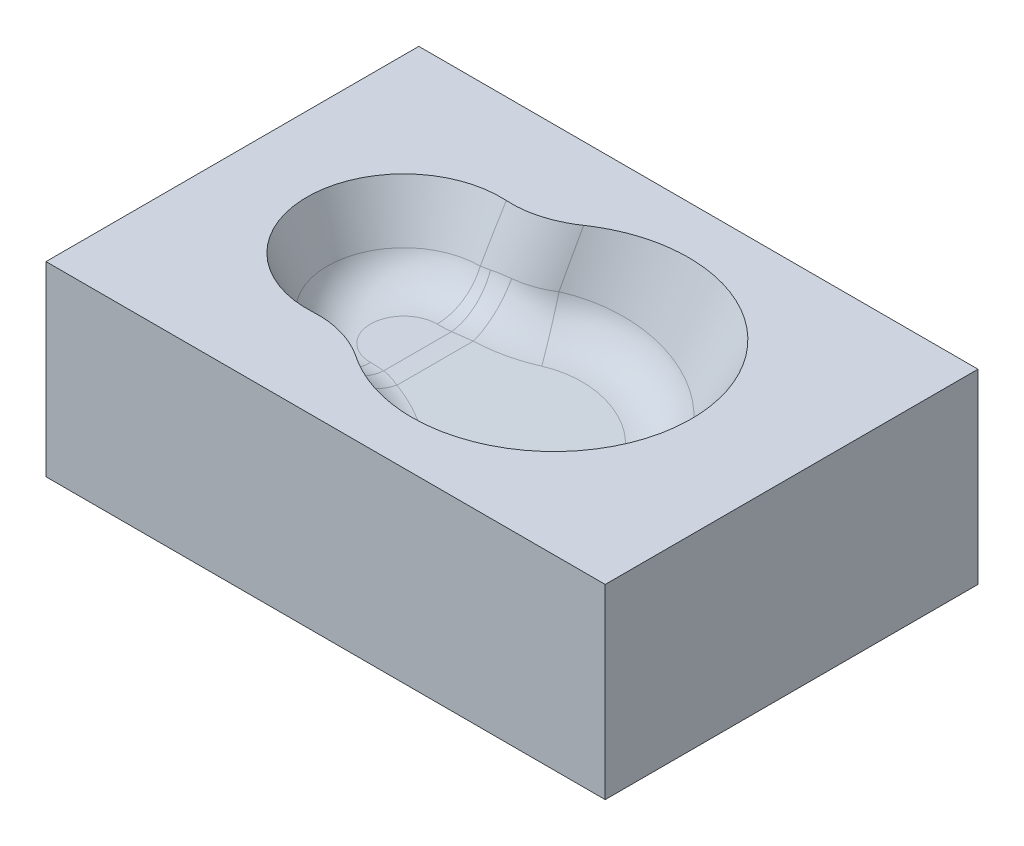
ISO-10303-21;
HEADER;
FILE_DESCRIPTION(('STEP AP214'),'2;1');
FILE_NAME('part.step','',(''),(''),'','','');
FILE_SCHEMA(('AUTOMOTIVE_DESIGN { 1 0 10303 214 1 1 1 1 }'));
ENDSEC;
DATA;
#1=APPLICATION_CONTEXT('core data for automotive mechanical design processes');
#2=APPLICATION_PROTOCOL_DEFINITION('international standard','automotive_design',2000,#1);
#3=PRODUCT_CONTEXT('',#1,'mechanical');
#4=PRODUCT('Part','Part','',(#3));
#5=PRODUCT_RELATED_PRODUCT_CATEGORY('part','',(#4));
#6=PRODUCT_DEFINITION_FORMATION('','',#4);
#7=PRODUCT_DEFINITION_CONTEXT('part definition',#1,'design');
#8=PRODUCT_DEFINITION('design','',#6,#7);
#9=PRODUCT_DEFINITION_SHAPE('','',#8);
#10=(LENGTH_UNIT() NAMED_UNIT(*) SI_UNIT(.MILLI.,.METRE.));
#11=(NAMED_UNIT(*) PLANE_ANGLE_UNIT() SI_UNIT($,.RADIAN.));
#12=(NAMED_UNIT(*) SI_UNIT($,.STERADIAN.) SOLID_ANGLE_UNIT());
#13=UNCERTAINTY_MEASURE_WITH_UNIT(LENGTH_MEASURE(1.E-05),#10,'distance_accuracy_value','');
#14=(GEOMETRIC_REPRESENTATION_CONTEXT(3) GLOBAL_UNCERTAINTY_ASSIGNED_CONTEXT((#13)) GLOBAL_UNIT_ASSIGNED_CONTEXT((#10,
#11,#12)) REPRESENTATION_CONTEXT('',''));
#15=CARTESIAN_POINT('',(0.,0.,0.));
#16=DIRECTION('',(0.,0.,1.));
#17=DIRECTION('',(1.,0.,0.));
#18=AXIS2_PLACEMENT_3D('',#15,#16,#17);
#19=CARTESIAN_POINT('',(-34.8460127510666,-30.00451113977,-18.5087286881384));
#20=CARTESIAN_POINT('',(-44.301851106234,-22.6231773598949,-6.73522783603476));
#21=CARTESIAN_POINT('',(-60.0598133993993,-18.2108432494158,-2.89723073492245));
#22=CARTESIAN_POINT('',(-34.8223152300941,-28.9665377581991,-18.8229328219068));
#23=CARTESIAN_POINT('',(-44.3615589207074,-21.5897171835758,-7.05830974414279));
#24=CARTESIAN_POINT('',(-60.1856435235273,-17.1988660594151,-3.29803152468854));
#25=CARTESIAN_POINT('',(-34.7964060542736,-27.9277518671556,-19.1386507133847));
#26=CARTESIAN_POINT('',(-44.4171935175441,-20.5559253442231,-7.38457654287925));
#27=CARTESIAN_POINT('',(-60.3043230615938,-16.1859473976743,-3.70164466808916));
#28=CARTESIAN_POINT('',(-34.7402414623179,-25.8487097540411,-19.7729581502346));
#29=CARTESIAN_POINT('',(-44.5205937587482,-18.4872519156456,-8.04310394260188));
#30=CARTESIAN_POINT('',(-60.528110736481,-14.158375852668,-4.51379975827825));
#31=CARTESIAN_POINT('',(-34.7099860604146,-24.8084535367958,-20.0915476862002));
#32=CARTESIAN_POINT('',(-44.5683541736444,-17.452409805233,-8.37535429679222));
#33=CARTESIAN_POINT('',(-60.6332189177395,-13.1437229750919,-4.92234168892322));
#34=CARTESIAN_POINT('',(-34.6128171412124,-21.6857422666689,-21.0513804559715));
#35=CARTESIAN_POINT('',(-44.700219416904,-14.3458562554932,-9.38046438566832));
#36=CARTESIAN_POINT('',(-60.9292783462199,-10.0974161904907,-6.15430458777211));
#37=CARTESIAN_POINT('',(-34.539499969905,-19.6013036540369,-21.69670025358));
#38=CARTESIAN_POINT('',(-44.7728346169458,-12.2734667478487,-10.0612575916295));
#39=CARTESIAN_POINT('',(-61.1009693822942,-8.06337421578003,-6.98407852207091));
#40=CARTESIAN_POINT('',(-34.3764252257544,-15.4282987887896,-22.9970191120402));
#41=CARTESIAN_POINT('',(-44.8894112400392,-8.12550199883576,-11.4410264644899));
#42=CARTESIAN_POINT('',(-61.3981074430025,-3.99004815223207,-8.65612967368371));
#43=CARTESIAN_POINT('',(-34.2866689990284,-13.3397328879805,-23.6520173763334));
#44=CARTESIAN_POINT('',(-44.933350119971,-6.05017352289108,-12.1399293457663));
#45=CARTESIAN_POINT('',(-61.5235582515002,-1.95076450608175,-9.49840586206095));
#46=CARTESIAN_POINT('',(-34.0913429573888,-9.15904454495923,-24.9707329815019));
#47=CARTESIAN_POINT('',(-44.9943115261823,-1.89670186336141,-13.5530146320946));
#48=CARTESIAN_POINT('',(-61.7326785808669,2.13248597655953,-11.19219857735));
#49=CARTESIAN_POINT('',(-33.9857730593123,-7.06692208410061,-25.6344503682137));
#50=CARTESIAN_POINT('',(-45.0113169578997,0.181231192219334,-14.2671329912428));
#51=CARTESIAN_POINT('',(-61.8163478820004,4.17645283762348,-12.0437151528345));
#52=CARTESIAN_POINT('',(-33.7594775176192,-2.88034315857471,-26.9694922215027));
#53=CARTESIAN_POINT('',(-45.0200303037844,4.33886348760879,-15.707970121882));
#54=CARTESIAN_POINT('',(-61.9457673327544,8.26786746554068,-13.7531308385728));
#55=CARTESIAN_POINT('',(-33.6387562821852,-0.785887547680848,-27.6408144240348));
#56=CARTESIAN_POINT('',(-45.0117345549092,6.41838304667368,-16.4346281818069));
#57=CARTESIAN_POINT('',(-61.9915284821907,10.3153140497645,-14.6110280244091));
#58=CARTESIAN_POINT('',(-33.382745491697,3.40548353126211,-28.99043549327));
#59=CARTESIAN_POINT('',(-44.9713737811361,10.5794517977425,-17.8986880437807));
#60=CARTESIAN_POINT('',(-62.0485701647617,14.4137971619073,-16.3314119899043));
#61=CARTESIAN_POINT('',(-33.2474559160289,5.50239900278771,-29.6687343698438));
#62=CARTESIAN_POINT('',(-44.9393021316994,12.6608476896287,-18.6360393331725));
#63=CARTESIAN_POINT('',(-62.0598506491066,16.4648336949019,-17.1938987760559));
#64=CARTESIAN_POINT('',(-32.9629006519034,9.69834110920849,-31.0315855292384));
#65=CARTESIAN_POINT('',(-44.8527982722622,16.8254384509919,-20.1197680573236));
#66=CARTESIAN_POINT('',(-62.0509212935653,20.5701383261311,-18.9218712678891));
#67=CARTESIAN_POINT('',(-32.8136346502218,11.7973677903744,-31.7161379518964));
#68=CARTESIAN_POINT('',(-44.7983622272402,18.908501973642,-20.8661011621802));
#69=CARTESIAN_POINT('',(-62.0307107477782,22.6244064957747,-19.787357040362));
#70=CARTESIAN_POINT('',(-32.5017052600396,15.9971645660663,-33.0908186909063));
#71=CARTESIAN_POINT('',(-44.6684414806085,23.0761591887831,-22.3663126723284));
#72=CARTESIAN_POINT('',(-61.9614396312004,26.7357939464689,-21.5200343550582));
#73=CARTESIAN_POINT('',(-32.3390418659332,18.0979346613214,-33.7809470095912));
#74=CARTESIAN_POINT('',(-44.5929558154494,25.1606401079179,-23.1201519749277));
#75=CARTESIAN_POINT('',(-61.9123790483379,28.7929132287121,-22.3872258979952));
#76=CARTESIAN_POINT('',(-32.0010160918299,22.2991825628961,-35.165599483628));
#77=CARTESIAN_POINT('',(-44.4222294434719,29.3291934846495,-24.6334925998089));
#78=CARTESIAN_POINT('',(-61.7878069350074,32.9079859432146,-24.1215690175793));
#79=CARTESIAN_POINT('',(-31.825664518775,24.3996591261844,-35.8601194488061));
#80=CARTESIAN_POINT('',(-44.3270061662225,31.4131683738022,-25.3929545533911));
#81=CARTESIAN_POINT('',(-61.7123177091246,34.9659372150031,-24.988720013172));
#82=CARTESIAN_POINT('',(-31.462673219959,28.6018694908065,-37.2535979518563));
#83=CARTESIAN_POINT('',(-44.117894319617,35.5823111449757,-26.9171153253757));
#84=CARTESIAN_POINT('',(-61.5369526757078,39.0841647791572,-26.7229128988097));
#85=CARTESIAN_POINT('',(-31.2750334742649,30.7036032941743,-37.9525564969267));
#86=CARTESIAN_POINT('',(-44.0040076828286,37.6673957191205,-27.6817842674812));
#87=CARTESIAN_POINT('',(-61.4370768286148,41.144441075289,-27.5899547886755));
#88=CARTESIAN_POINT('',(-30.6944595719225,37.0103601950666,-40.055338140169));
#89=CARTESIAN_POINT('',(-43.6359396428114,43.9244724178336,-29.9823364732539));
#90=CARTESIAN_POINT('',(-61.1037186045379,47.328394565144,-30.1898987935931));
#91=CARTESIAN_POINT('',(-30.2838665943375,41.2169901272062,-41.4650841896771));
#92=CARTESIAN_POINT('',(-43.355395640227,48.0973969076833,-31.5244391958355));
#93=CARTESIAN_POINT('',(-60.8365039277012,51.4552466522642,-31.9216404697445));
#94=CARTESIAN_POINT('',(-29.4193929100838,49.6337205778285,-44.297169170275));
#95=CARTESIAN_POINT('',(-42.731473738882,56.4473239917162,-34.6203009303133));
#96=CARTESIAN_POINT('',(-60.2248318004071,59.7163995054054,-35.3784697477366));
#97=CARTESIAN_POINT('',(-28.9655084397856,53.843821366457,-45.7195091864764));
#98=CARTESIAN_POINT('',(-42.3881193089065,60.6239025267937,-36.1739040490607));
#99=CARTESIAN_POINT('',(-59.8803676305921,63.8507008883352,-37.1035567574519));
#100=CARTESIAN_POINT('',(-28.0179673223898,62.2663338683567,-48.5739968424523));
#101=CARTESIAN_POINT('',(-41.6451340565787,68.9801413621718,-39.2883731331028));
#102=CARTESIAN_POINT('',(-59.1244781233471,72.1253903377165,-40.5446835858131));
#103=CARTESIAN_POINT('',(-27.5243105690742,66.4787455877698,-50.0061445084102));
#104=CARTESIAN_POINT('',(-41.24553371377,73.1594850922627,-40.8491208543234));
#105=CARTESIAN_POINT('',(-58.7130526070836,76.2657784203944,-42.2607233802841));
#106=CARTESIAN_POINT('',(-26.3982198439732,75.7462612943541,-53.1646733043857));
#107=CARTESIAN_POINT('',(-40.3109848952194,82.3551482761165,-44.2865543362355));
#108=CARTESIAN_POINT('',(-57.7438175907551,85.3787907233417,-46.0238525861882));
#109=CARTESIAN_POINT('',(-25.7577536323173,80.8017387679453,-54.892724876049));
#110=CARTESIAN_POINT('',(-39.764975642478,87.3717673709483,-46.164025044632));
#111=CARTESIAN_POINT('',(-57.1731812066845,90.3525709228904,-48.0686502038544));
#112=CARTESIAN_POINT('',(-24.4291048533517,90.9143927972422,-58.3567436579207));
#113=CARTESIAN_POINT('',(-38.608710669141,97.4081599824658,-49.9207431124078));
#114=CARTESIAN_POINT('',(-55.9598574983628,100.306601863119,-52.1419589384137));
#115=CARTESIAN_POINT('',(-23.7409222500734,95.9715693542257,-60.0927108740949));
#116=CARTESIAN_POINT('',(-37.998500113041,102.427652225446,-51.7998850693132));
#117=CARTESIAN_POINT('',(-55.3171701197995,105.286852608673,-54.1704700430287));
#118=CARTESIAN_POINT('',(-22.3212392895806,106.086984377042,-63.5701470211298));
#119=CARTESIAN_POINT('',(-36.7210857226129,112.469180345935,-55.5570416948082));
#120=CARTESIAN_POINT('',(-53.9694988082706,115.252846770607,-58.2107014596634));
#121=CARTESIAN_POINT('',(-21.5897399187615,111.145222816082,-65.3116158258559));
#122=CARTESIAN_POINT('',(-36.0539217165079,117.491023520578,-57.4349848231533));
#123=CARTESIAN_POINT('',(-53.2645162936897,120.238590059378,-60.2224221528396));
#124=CARTESIAN_POINT('',(-20.0873124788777,121.262500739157,-68.7982180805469));
#125=CARTESIAN_POINT('',(-34.6688056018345,127.536987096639,-61.1877560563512));
#126=CARTESIAN_POINT('',(-51.8002699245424,130.214984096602,-64.2291404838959));
#127=CARTESIAN_POINT('',(-19.3163844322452,126.321540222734,-70.5433515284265));
#128=CARTESIAN_POINT('',(-33.9508852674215,132.560979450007,-63.0625374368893));
#129=CARTESIAN_POINT('',(-51.0410061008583,135.205634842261,-66.2241381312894));
#130=CARTESIAN_POINT('',(-17.7378030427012,136.445117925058,-74.0375168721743));
#131=CARTESIAN_POINT('',(-32.4688898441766,142.61587472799,-66.809399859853));
#132=CARTESIAN_POINT('',(-49.4741026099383,145.196175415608,-70.1996864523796));
#133=CARTESIAN_POINT('',(-16.9301144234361,141.509656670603,-75.786550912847));
#134=CARTESIAN_POINT('',(-31.7047954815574,147.646699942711,-68.6814483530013));
#135=CARTESIAN_POINT('',(-48.6664162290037,150.196069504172,-72.1802210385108));
#136=CARTESIAN_POINT('',(-15.281820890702,151.639084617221,-79.285642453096));
#137=CARTESIAN_POINT('',(-30.1357365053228,157.710105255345,-72.4200212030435));
#138=CARTESIAN_POINT('',(-47.0089479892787,160.199742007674,-76.1253757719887));
#139=CARTESIAN_POINT('',(-14.4412159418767,156.703973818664,-81.0356999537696));
#140=CARTESIAN_POINT('',(-29.3307917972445,162.742638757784,-74.2865301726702));
#141=CARTESIAN_POINT('',(-46.1591660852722,165.20352042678,-78.0899959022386));
#142=CARTESIAN_POINT('',(-12.7299031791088,166.833844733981,-84.5358665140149));
#143=CARTESIAN_POINT('',(-27.6841230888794,172.809155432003,-78.0133151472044));
#144=CARTESIAN_POINT('',(-44.4223092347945,175.21444630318,-82.0038925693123));
#145=CARTESIAN_POINT('',(-11.8591960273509,171.898826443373,-86.2859755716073));
#146=CARTESIAN_POINT('',(-26.8424149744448,177.843117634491,-79.8735856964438));
#147=CARTESIAN_POINT('',(-43.5352351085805,180.221593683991,-83.9531694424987));
#148=CARTESIAN_POINT('',(-10.0900988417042,182.028877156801,-89.7855843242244));
#149=CARTESIAN_POINT('',(-25.1256564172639,187.912405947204,-83.5875382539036));
#150=CARTESIAN_POINT('',(-41.7277071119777,190.239018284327,-87.837092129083));
#151=CARTESIAN_POINT('',(-9.19170892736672,187.093946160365,-91.5350840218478));
#152=CARTESIAN_POINT('',(-24.2506173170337,192.947728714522,-85.4412213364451));
#153=CARTESIAN_POINT('',(-40.8072533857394,195.249295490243,-89.7717380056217));
#154=CARTESIAN_POINT('',(-8.2806925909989,192.159022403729,-93.2839369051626));
#155=CARTESIAN_POINT('',(-23.3604758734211,197.984514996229,-87.2917354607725));
#156=CARTESIAN_POINT('',(-39.8720713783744,200.260984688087,-91.6994112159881));
#157=(BOUNDED_SURFACE() B_SPLINE_SURFACE(3,2,((#19,#20,#21),(#22,#23,#24),(#25,#26,#27),(#28,
#29,#30),(#31,#32,#33),(#34,#35,#36),(#37,#38,#39),(#40,#41,#42),(#43,#44,#45),(#46,#47,#48),
(#49,#50,#51),(#52,#53,#54),(#55,#56,#57),(#58,#59,#60),(#61,#62,#63),(#64,#65,#66),(#67,#68,
#69),(#70,#71,#72),(#73,#74,#75),(#76,#77,#78),(#79,#80,#81),(#82,#83,#84),(#85,#86,#87),(#88,
#89,#90),(#91,#92,#93),(#94,#95,#96),(#97,#98,#99),(#100,#101,#102),(#103,#104,#105),(#106,#107,
#108),(#109,#110,#111),(#112,#113,#114),(#115,#116,#117),(#118,#119,#120),(#121,#122,#123),
(#124,#125,#126),(#127,#128,#129),(#130,#131,#132),(#133,#134,#135),(#136,#137,#138),(#139,#140,
#141),(#142,#143,#144),(#145,#146,#147),(#148,#149,#150),(#151,#152,#153),(#154,#155,#156)),
.UNSPECIFIED.,.F.,.F.,.F.) B_SPLINE_SURFACE_WITH_KNOTS((4,2,2,2,2,2,2,2,2,2,2,2,2,2,2,2,2,2,2,2,
2,2,4),(3,3),(0.,3.42787278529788,6.85573434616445,13.7113222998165,20.5663491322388,
27.4214120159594,34.2744850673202,41.127567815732,47.9808041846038,54.834043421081,
61.6815127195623,68.5289931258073,82.2237865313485,95.9197716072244,109.615793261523,
126.045618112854,142.47545534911,158.904918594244,175.334372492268,191.77993936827,
208.225523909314,224.670746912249,241.115898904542),(0.,1.),
.UNSPECIFIED.) GEOMETRIC_REPRESENTATION_ITEM() RATIONAL_B_SPLINE_SURFACE(((1.,0.949383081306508,
1.),(1.,0.949167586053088,1.),(1.,0.948962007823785,1.),(1.,0.948569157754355,1.),(1.,
0.948381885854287,1.),(1.,0.947845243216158,1.),(1.,0.947521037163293,1.),(1.,0.946929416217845,
1.),(1.,0.94666199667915,1.),(1.,0.946175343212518,1.),(1.,0.945956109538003,1.),(1.,
0.945558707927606,1.),(1.,0.945380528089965,1.),(1.,0.945059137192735,1.),(1.,0.944915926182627,
1.),(1.,0.944659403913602,1.),(1.,0.944546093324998,1.),(1.,0.944345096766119,1.),(1.,
0.944257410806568,1.),(1.,0.944104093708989,1.),(1.,0.944038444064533,1.),(1.,0.943926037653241,
1.),(1.,0.943879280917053,1.),(1.,0.943763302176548,1.),(1.,0.943718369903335,1.),(1.,
0.943676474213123,1.),(1.,0.943679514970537,1.),(1.,0.943721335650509,1.),(1.,0.943760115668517,
1.),(1.,0.943874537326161,1.),(1.,0.943955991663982,1.),(1.,0.944145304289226,1.),(1.,
0.944253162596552,1.),(1.,0.944486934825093,1.),(1.,0.944612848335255,1.),(1.,0.944876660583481,
1.),(1.,0.945014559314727,1.),(1.,0.945298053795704,1.),(1.,0.945443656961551,1.),(1.,
0.94573919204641,1.),(1.,0.945889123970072,1.),(1.,0.946190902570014,1.),(1.,0.946342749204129,
1.),(1.,0.946646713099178,1.),(1.,0.94679883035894,1.),(1.,0.946950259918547,1.))) REPRESENTATION_ITEM('') SURFACE());
#158=CARTESIAN_POINT('',(-59.6283656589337,77.6225360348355,-42.8424157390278));
#159=CARTESIAN_POINT('',(-63.2911572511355,62.1398831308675,-36.4665096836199));
#160=CARTESIAN_POINT('',(-65.1307610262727,62.4903193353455,-19.4290857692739));
#161=CARTESIAN_POINT('',(-58.9835740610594,77.4925728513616,-42.7672650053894));
#162=CARTESIAN_POINT('',(-62.5574686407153,62.000118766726,-36.3788604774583));
#163=CARTESIAN_POINT('',(-64.1613973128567,62.3056599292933,-19.320604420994));
#164=CARTESIAN_POINT('',(-58.3367753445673,77.3647549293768,-42.7069969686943));
#165=CARTESIAN_POINT('',(-61.8216463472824,61.8599479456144,-36.3089132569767));
#166=CARTESIAN_POINT('',(-63.189794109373,62.1205739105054,-19.2329428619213));
#167=CARTESIAN_POINT('',(-57.0403070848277,77.1136440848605,-42.6163026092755));
#168=CARTESIAN_POINT('',(-60.3477012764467,61.5791680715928,-36.2045441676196));
#169=CARTESIAN_POINT('',(-61.2438288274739,61.7498763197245,-19.0993643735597));
#170=CARTESIAN_POINT('',(-56.3906375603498,76.990351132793,-42.585876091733));
#171=CARTESIAN_POINT('',(-59.6094734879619,61.4385390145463,-36.1701125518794));
#172=CARTESIAN_POINT('',(-60.269466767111,61.5642647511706,-19.053447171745));
#173=CARTESIAN_POINT('',(-55.0896897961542,76.748546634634,-42.5549431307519));
#174=CARTESIAN_POINT('',(-58.132458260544,61.1571742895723,-36.1368867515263));
#175=CARTESIAN_POINT('',(-58.3198817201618,61.1928776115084,-19.0034659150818));
#176=CARTESIAN_POINT('',(-54.4384118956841,76.6300341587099,-42.5544308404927));
#177=CARTESIAN_POINT('',(-57.3935651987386,61.0164185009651,-36.1380862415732));
#178=CARTESIAN_POINT('',(-57.3446589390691,61.0071020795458,-18.9993936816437));
#179=CARTESIAN_POINT('',(-53.1353308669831,76.3979893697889,-42.5832760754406));
#180=CARTESIAN_POINT('',(-55.9167530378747,60.7350924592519,-36.176044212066));
#181=CARTESIAN_POINT('',(-55.3949757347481,60.6356962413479,-19.0330319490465));
#182=CARTESIAN_POINT('',(-52.4835277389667,76.2844570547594,-42.6126335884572));
#183=CARTESIAN_POINT('',(-55.1787284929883,60.5945021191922,-36.2128134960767));
#184=CARTESIAN_POINT('',(-54.4205153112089,60.4500659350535,-19.0707424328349));
#185=CARTESIAN_POINT('',(-50.5341776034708,75.9525149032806,-42.7450613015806));
#186=CARTESIAN_POINT('',(-52.9739197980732,60.1744960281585,-36.3759192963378));
#187=CARTESIAN_POINT('',(-51.5085125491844,59.8953425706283,-19.2459464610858));
#188=CARTESIAN_POINT('',(-49.237250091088,75.7417489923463,-42.8923595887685));
#189=CARTESIAN_POINT('',(-51.5104083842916,59.8957037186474,-36.5549897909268));
#190=CARTESIAN_POINT('',(-49.5741968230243,59.5268641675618,-19.4453068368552));
#191=CARTESIAN_POINT('',(-46.6548386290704,75.3422133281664,-43.3035692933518));
#192=CARTESIAN_POINT('',(-48.6065181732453,59.3425257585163,-37.0513628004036));
#193=CARTESIAN_POINT('',(-45.7287882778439,58.7943312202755,-20.0071762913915));
#194=CARTESIAN_POINT('',(-45.3693553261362,75.1534448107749,-43.5674872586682));
#195=CARTESIAN_POINT('',(-47.165353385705,59.0679903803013,-37.3689935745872));
#196=CARTESIAN_POINT('',(-43.8176967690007,58.4302769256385,-20.3696945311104));
#197=CARTESIAN_POINT('',(-42.7317003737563,74.7869809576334,-44.2309865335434));
#198=CARTESIAN_POINT('',(-44.2210426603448,58.507112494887,-38.1646739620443));
#199=CARTESIAN_POINT('',(-39.9027623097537,57.6844996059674,-21.2841236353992));
#200=CARTESIAN_POINT('',(-41.3809254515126,74.6109071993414,-44.6385610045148));
#201=CARTESIAN_POINT('',(-42.7196758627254,58.2211089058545,-38.6526451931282));
#202=CARTESIAN_POINT('',(-37.9014297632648,57.3032548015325,-21.8472206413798));
#203=CARTESIAN_POINT('',(-38.7122261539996,74.2861687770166,-45.5789459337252));
#204=CARTESIAN_POINT('',(-39.7705698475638,57.6593175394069,-39.7749573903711));
#205=CARTESIAN_POINT('',(-33.9545419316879,56.5513905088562,-23.1487612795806));
#206=CARTESIAN_POINT('',(-37.3943041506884,74.1375060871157,-46.1117654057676));
#207=CARTESIAN_POINT('',(-38.3220670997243,57.3833843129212,-40.410040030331));
#208=CARTESIAN_POINT('',(-32.0089906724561,56.1807717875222,-23.8872175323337));
#209=CARTESIAN_POINT('',(-34.7985590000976,73.8680620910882,-47.2978400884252));
#210=CARTESIAN_POINT('',(-35.488953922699,56.8436890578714,-41.8194162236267));
#211=CARTESIAN_POINT('',(-28.1842849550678,55.4521826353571,-25.53285577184));
#212=CARTESIAN_POINT('',(-33.5208056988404,73.7473272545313,-47.9512928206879));
#213=CARTESIAN_POINT('',(-34.1038296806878,56.5798291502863,-42.5948068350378));
#214=CARTESIAN_POINT('',(-26.3052455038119,55.0942341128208,-26.4403145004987));
#215=CARTESIAN_POINT('',(-31.0163226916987,73.5344258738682,-49.371307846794));
#216=CARTESIAN_POINT('',(-31.4114361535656,56.0669403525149,-44.27438332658));
#217=CARTESIAN_POINT('',(-22.6295497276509,54.3940306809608,-28.4138362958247));
#218=CARTESIAN_POINT('',(-29.7895907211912,73.4422580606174,-50.1378651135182));
#219=CARTESIAN_POINT('',(-30.1036911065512,55.8178208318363,-45.1795437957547));
#220=CARTESIAN_POINT('',(-20.8328897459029,54.051775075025,-29.4798923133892));
#221=CARTESIAN_POINT('',(-27.3978590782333,73.2867406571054,-51.774608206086));
#222=CARTESIAN_POINT('',(-27.5791782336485,55.3369125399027,-47.105520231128));
#223=CARTESIAN_POINT('',(-17.3374976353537,53.3859186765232,-31.7574968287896));
#224=CARTESIAN_POINT('',(-26.2327085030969,73.2233174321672,-52.6445219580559));
#225=CARTESIAN_POINT('',(-26.3618717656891,55.1050211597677,-48.1270900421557));
#226=CARTESIAN_POINT('',(-15.6385251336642,53.0622720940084,-32.9686634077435));
#227=CARTESIAN_POINT('',(-23.9674343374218,73.1247286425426,-54.4817698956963));
#228=CARTESIAN_POINT('',(-24.0228763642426,54.6594531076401,-50.2764969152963));
#229=CARTESIAN_POINT('',(-12.3431109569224,52.4345105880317,-35.5279201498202));
#230=CARTESIAN_POINT('',(-22.8673173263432,73.0895659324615,-55.4491139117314));
#231=CARTESIAN_POINT('',(-22.9010755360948,54.4457551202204,-51.4054290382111));
#232=CARTESIAN_POINT('',(-10.7466796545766,52.1303976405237,-36.8760241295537));
#233=CARTESIAN_POINT('',(-20.7397683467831,73.047120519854,-57.4715192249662));
#234=CARTESIAN_POINT('',(-20.7619682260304,54.0382648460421,-53.7558757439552));
#235=CARTESIAN_POINT('',(-7.66729795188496,51.5437893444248,-39.6957310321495));
#236=CARTESIAN_POINT('',(-19.7122206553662,73.0397923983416,-58.5264347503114));
#237=CARTESIAN_POINT('',(-19.7445364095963,53.8444486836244,-54.9783367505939));
#238=CARTESIAN_POINT('',(-6.18416655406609,51.2612595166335,-41.1671287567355));
#239=CARTESIAN_POINT('',(-18.228187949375,73.0491575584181,-60.1689305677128));
#240=CARTESIAN_POINT('',(-18.3020754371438,53.5696663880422,-56.8702059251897));
#241=CARTESIAN_POINT('',(-4.04842924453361,50.8544112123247,-43.459019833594));
#242=CARTESIAN_POINT('',(-17.7430786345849,73.0556714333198,-60.7264237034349));
#243=CARTESIAN_POINT('',(-17.8341767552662,53.4805338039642,-57.5121175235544));
#244=CARTESIAN_POINT('',(-3.35137219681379,50.7216249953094,-44.2370797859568));
#245=CARTESIAN_POINT('',(-16.7924013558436,73.0753907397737,-61.8605184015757));
#246=CARTESIAN_POINT('',(-16.9260328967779,53.3075365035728,-58.8150157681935));
#247=CARTESIAN_POINT('',(-1.98752430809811,50.4618181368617,-45.8201737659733));
#248=CARTESIAN_POINT('',(-16.3268326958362,73.0885959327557,-62.4371192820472));
#249=CARTESIAN_POINT('',(-16.4858246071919,53.2236788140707,-59.4761321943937));
#250=CARTESIAN_POINT('',(-1.32073238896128,50.3347972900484,-46.6252068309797));
#251=CARTESIAN_POINT('',(-15.8712485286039,73.1051004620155,-63.0228214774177));
#252=CARTESIAN_POINT('',(-16.0603818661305,53.1426338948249,-60.1449992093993));
#253=CARTESIAN_POINT('',(-0.669367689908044,50.2107152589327,-47.4431001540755));
#254=(BOUNDED_SURFACE() B_SPLINE_SURFACE(3,2,((#158,#159,#160),(#161,#162,#163),(#164,#165,
#166),(#167,#168,#169),(#170,#171,#172),(#173,#174,#175),(#176,#177,#178),(#179,#180,#181),
(#182,#183,#184),(#185,#186,#187),(#188,#189,#190),(#191,#192,#193),(#194,#195,#196),(#197,#198,
#199),(#200,#201,#202),(#203,#204,#205),(#206,#207,#208),(#209,#210,#211),(#212,#213,#214),
(#215,#216,#217),(#218,#219,#220),(#221,#222,#223),(#224,#225,#226),(#227,#228,#229),(#230,#231,
#232),(#233,#234,#235),(#236,#237,#238),(#239,#240,#241),(#242,#243,#244),(#245,#246,#247),
(#248,#249,#250),(#251,#252,#253)),.UNSPECIFIED.,.F.,.F.,.F.) B_SPLINE_SURFACE_WITH_KNOTS((4,2,
2,2,2,2,2,2,2,2,2,2,2,2,2,4),(3,3),(0.,2.97798324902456,5.95594705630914,8.93332881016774,
11.910709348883,17.8406458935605,23.7709154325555,30.1037546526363,36.4370497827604,
42.7808083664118,49.1242850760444,55.4514186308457,61.7791912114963,68.0966340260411,
71.2550770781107,74.4134075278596),(0.,1.),
.UNSPECIFIED.) GEOMETRIC_REPRESENTATION_ITEM() RATIONAL_B_SPLINE_SURFACE(((1.,0.828923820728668,
1.),(1.,0.829007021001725,1.),(1.,0.829060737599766,1.),(1.,0.829109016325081,1.),(1.,
0.829103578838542,1.),(1.,0.829033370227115,1.),(1.,0.828968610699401,1.),(1.,0.828779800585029,
1.),(1.,0.828655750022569,1.),(1.,0.828195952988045,1.),(1.,0.827772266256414,1.),(1.,
0.826692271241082,1.),(1.,0.826035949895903,1.),(1.,0.824442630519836,1.),(1.,0.823489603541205,
1.),(1.,0.821330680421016,1.),(1.,0.820124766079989,1.),(1.,0.817467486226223,1.),(1.,
0.816015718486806,1.),(1.,0.812879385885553,1.),(1.,0.811194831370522,1.),(1.,0.807610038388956,
1.),(1.,0.805710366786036,1.),(1.,0.801705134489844,1.),(1.,0.799599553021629,1.),(1.,
0.795199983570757,1.),(1.,0.792906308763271,1.),(1.,0.789334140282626,1.),(1.,0.788121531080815,
1.),(1.,0.785654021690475,1.),(1.,0.784399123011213,1.),(1.,0.783123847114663,1.))) REPRESENTATION_ITEM('') SURFACE());
#255=CARTESIAN_POINT('',(-11.5664529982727,78.1433182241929,-32.509989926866));
#256=DIRECTION('',(-0.80310924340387,0.152988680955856,0.575855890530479));
#257=DIRECTION('',(0.582715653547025,0.,0.812676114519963));
#258=AXIS2_PLACEMENT_3D('',#255,#256,#257);
#259=CIRCLE('',#258,25.4);
#260=CARTESIAN_POINT('',(-26.6990792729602,73.2519038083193,-52.3149813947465));
#261=VERTEX_POINT('',#260);
#262=CARTESIAN_POINT('',(-16.3195649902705,53.1920071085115,-32.509989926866));
#263=VERTEX_POINT('',#262);
#264=EDGE_CURVE('E12',#261,#263,#259,.T.);
#265=ORIENTED_EDGE('',*,*,#264,.F.);
#266=CARTESIAN_POINT('',(-59.6283656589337,77.6225360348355,-42.8424157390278));
#267=CARTESIAN_POINT('',(-58.9835740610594,77.4925728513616,-42.7672650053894));
#268=CARTESIAN_POINT('',(-58.3367753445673,77.3647549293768,-42.7069969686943));
#269=CARTESIAN_POINT('',(-57.0403070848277,77.1136440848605,-42.6163026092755));
#270=CARTESIAN_POINT('',(-56.3906375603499,76.990351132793,-42.585876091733));
#271=CARTESIAN_POINT('',(-55.0896897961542,76.7485466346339,-42.5549431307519));
#272=CARTESIAN_POINT('',(-54.4384118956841,76.6300341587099,-42.5544308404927));
#273=CARTESIAN_POINT('',(-53.1353308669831,76.3979893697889,-42.5832760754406));
#274=CARTESIAN_POINT('',(-52.4835277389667,76.2844570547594,-42.6126335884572));
#275=CARTESIAN_POINT('',(-50.5341776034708,75.9525149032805,-42.7450613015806));
#276=CARTESIAN_POINT('',(-49.237250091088,75.7417489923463,-42.8923595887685));
#277=CARTESIAN_POINT('',(-46.6548386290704,75.3422133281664,-43.3035692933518));
#278=CARTESIAN_POINT('',(-45.3693553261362,75.1534448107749,-43.5674872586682));
#279=CARTESIAN_POINT('',(-42.7317003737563,74.7869809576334,-44.2309865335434));
#280=CARTESIAN_POINT('',(-41.3809254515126,74.6109071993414,-44.6385610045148));
#281=CARTESIAN_POINT('',(-38.7122261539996,74.2861687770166,-45.5789459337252));
#282=CARTESIAN_POINT('',(-37.3943041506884,74.1375060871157,-46.1117654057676));
#283=CARTESIAN_POINT('',(-34.7985590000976,73.8680620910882,-47.2978400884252));
#284=CARTESIAN_POINT('',(-33.5208056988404,73.7473272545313,-47.9512928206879));
#285=CARTESIAN_POINT('',(-31.0163226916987,73.5344258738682,-49.371307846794));
#286=CARTESIAN_POINT('',(-29.7895907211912,73.4422580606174,-50.1378651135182));
#287=CARTESIAN_POINT('',(-27.3978590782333,73.2867406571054,-51.774608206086));
#288=CARTESIAN_POINT('',(-26.2327085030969,73.2233174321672,-52.6445219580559));
#289=CARTESIAN_POINT('',(-23.9674343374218,73.1247286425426,-54.4817698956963));
#290=CARTESIAN_POINT('',(-22.8673173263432,73.0895659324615,-55.4491139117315));
#291=CARTESIAN_POINT('',(-20.7397683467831,73.0471205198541,-57.4715192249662));
#292=CARTESIAN_POINT('',(-19.7122206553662,73.0397923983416,-58.5264347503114));
#293=CARTESIAN_POINT('',(-18.228187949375,73.0491575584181,-60.1689305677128));
#294=CARTESIAN_POINT('',(-17.7430786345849,73.0556714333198,-60.7264237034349));
#295=CARTESIAN_POINT('',(-16.7924013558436,73.0753907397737,-61.8605184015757));
#296=CARTESIAN_POINT('',(-16.3268326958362,73.0885959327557,-62.4371192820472));
#297=CARTESIAN_POINT('',(-15.8712485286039,73.1051004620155,-63.0228214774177));
#298=B_SPLINE_CURVE_WITH_KNOTS('',3,(#266,#267,#268,#269,#270,#271,#272,#273,#274,#275,#276,
#277,#278,#279,#280,#281,#282,#283,#284,#285,#286,#287,#288,#289,#290,#291,#292,#293,#294,#295,
#296,#297),.UNSPECIFIED.,.F.,.F.,(4,2,2,2,2,2,2,2,2,2,2,2,2,2,2,4),(0.,2.97798324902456,
5.95594705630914,8.93332881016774,11.910709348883,17.8406458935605,23.7709154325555,
30.1037546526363,36.4370497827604,42.7808083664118,49.1242850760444,55.4514186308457,
61.7791912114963,68.0966340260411,71.2550770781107,74.4134075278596),.UNSPECIFIED.);
#299=CARTESIAN_POINT('',(-44.0938251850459,74.9762118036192,-43.8883390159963));
#300=VERTEX_POINT('',#299);
#301=EDGE_CURVE('E449',#300,#261,#298,.T.);
#302=ORIENTED_EDGE('',*,*,#301,.F.);
#303=CARTESIAN_POINT('',(-37.1713766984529,83.0209404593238,-20.8118997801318));
#304=DIRECTION('',(-0.957455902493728,0.182391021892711,0.223632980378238));
#305=DIRECTION('',(0.227448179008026,0.,0.973790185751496));
#306=AXIS2_PLACEMENT_3D('',#303,#304,#305);
#307=CIRCLE('',#306,25.4);
#308=CARTESIAN_POINT('',(-41.9244886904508,58.0696293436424,-20.8118997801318));
#309=VERTEX_POINT('',#308);
#310=EDGE_CURVE('E47',#300,#309,#307,.T.);
#311=ORIENTED_EDGE('',*,*,#310,.T.);
#312=CARTESIAN_POINT('',(-0.669367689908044,50.2107152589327,-47.4431001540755));
#313=CARTESIAN_POINT('',(-1.32073238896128,50.3347972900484,-46.6252068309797));
#314=CARTESIAN_POINT('',(-1.9875243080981,50.4618181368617,-45.8201737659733));
#315=CARTESIAN_POINT('',(-3.35137219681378,50.7216249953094,-44.2370797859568));
#316=CARTESIAN_POINT('',(-4.04842924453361,50.8544112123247,-43.459019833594));
#317=CARTESIAN_POINT('',(-6.18416655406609,51.2612595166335,-41.1671287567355));
#318=CARTESIAN_POINT('',(-7.66729795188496,51.5437893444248,-39.6957310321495));
#319=CARTESIAN_POINT('',(-10.7466796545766,52.1303976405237,-36.8760241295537));
#320=CARTESIAN_POINT('',(-12.3431109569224,52.4345105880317,-35.5279201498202));
#321=CARTESIAN_POINT('',(-15.6385251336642,53.0622720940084,-32.9686634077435));
#322=CARTESIAN_POINT('',(-17.3374976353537,53.3859186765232,-31.7574968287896));
#323=CARTESIAN_POINT('',(-20.8328897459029,54.051775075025,-29.4798923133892));
#324=CARTESIAN_POINT('',(-22.6295497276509,54.3940306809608,-28.4138362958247));
#325=CARTESIAN_POINT('',(-26.3052455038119,55.0942341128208,-26.4403145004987));
#326=CARTESIAN_POINT('',(-28.1842849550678,55.4521826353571,-25.53285577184));
#327=CARTESIAN_POINT('',(-32.0089906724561,56.1807717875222,-23.8872175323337));
#328=CARTESIAN_POINT('',(-33.9545419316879,56.5513905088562,-23.1487612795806));
#329=CARTESIAN_POINT('',(-37.9014297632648,57.3032548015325,-21.8472206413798));
#330=CARTESIAN_POINT('',(-39.9027623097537,57.6844996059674,-21.2841236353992));
#331=CARTESIAN_POINT('',(-43.8176967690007,58.4302769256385,-20.3696945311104));
#332=CARTESIAN_POINT('',(-45.7287882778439,58.7943312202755,-20.0071762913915));
#333=CARTESIAN_POINT('',(-49.5741968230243,59.5268641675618,-19.4453068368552));
#334=CARTESIAN_POINT('',(-51.5085125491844,59.8953425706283,-19.2459464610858));
#335=CARTESIAN_POINT('',(-54.4205153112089,60.4500659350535,-19.0707424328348));
#336=CARTESIAN_POINT('',(-55.3949757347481,60.6356962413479,-19.0330319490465));
#337=CARTESIAN_POINT('',(-57.3446589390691,61.0071020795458,-18.9993936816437));
#338=CARTESIAN_POINT('',(-58.3198817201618,61.1928776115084,-19.0034659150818));
#339=CARTESIAN_POINT('',(-60.269466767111,61.5642647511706,-19.053447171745));
#340=CARTESIAN_POINT('',(-61.2438288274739,61.7498763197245,-19.0993643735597));
#341=CARTESIAN_POINT('',(-63.189794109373,62.1205739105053,-19.2329428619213));
#342=CARTESIAN_POINT('',(-64.1613973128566,62.3056599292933,-19.3206044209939));
#343=CARTESIAN_POINT('',(-65.1307610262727,62.4903193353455,-19.4290857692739));
#344=B_SPLINE_CURVE_WITH_KNOTS('',3,(#312,#313,#314,#315,#316,#317,#318,#319,#320,#321,#322,
#323,#324,#325,#326,#327,#328,#329,#330,#331,#332,#333,#334,#335,#336,#337,#338,#339,#340,#341,
#342,#343),.UNSPECIFIED.,.F.,.F.,(4,2,2,2,2,2,2,2,2,2,2,2,2,2,2,4),(0.,3.15833044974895,
6.31677350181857,12.6342163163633,18.9619888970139,25.2891224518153,31.6325991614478,
37.9763577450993,44.3096528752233,50.6424920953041,56.5727616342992,62.5026981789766,
65.4800787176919,68.4574604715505,71.4354242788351,74.4134075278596),.UNSPECIFIED.);
#345=EDGE_CURVE('E261',#263,#309,#344,.T.);
#346=ORIENTED_EDGE('',*,*,#345,.F.);
#347=EDGE_LOOP('',(#265,#302,#311,#346));
#348=FACE_BOUND('',#347,.T.);
#349=ADVANCED_FACE('F39',(#348),#254,.F.);
#350=CARTESIAN_POINT('',(-26.785882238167,52.5885371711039,-29.5171719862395));
#351=CARTESIAN_POINT('',(-32.8541624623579,55.9551870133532,-43.3740061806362));
#352=CARTESIAN_POINT('',(-28.9444773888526,69.5458075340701,-49.7127447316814));
#353=CARTESIAN_POINT('',(-27.3565440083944,52.9051608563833,-29.0269096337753));
#354=CARTESIAN_POINT('',(-33.3932321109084,56.152092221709,-43.0607191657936));
#355=CARTESIAN_POINT('',(-29.5096216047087,69.8884638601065,-49.3966310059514));
#356=CARTESIAN_POINT('',(-27.937698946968,53.2131772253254,-28.5515580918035));
#357=CARTESIAN_POINT('',(-33.933440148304,56.3384781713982,-42.7592808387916));
#358=CARTESIAN_POINT('',(-30.0858682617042,70.2196340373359,-49.0892702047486));
#359=CARTESIAN_POINT('',(-29.1200767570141,53.8103384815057,-27.6310553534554));
#360=CARTESIAN_POINT('',(-35.0175574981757,56.6914443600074,-42.1771861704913));
#361=CARTESIAN_POINT('',(-31.2597718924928,70.8567658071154,-48.4920696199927));
#362=CARTESIAN_POINT('',(-29.721301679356,54.0994814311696,-27.1859072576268));
#363=CARTESIAN_POINT('',(-35.5613253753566,56.8578928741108,-41.8966986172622));
#364=CARTESIAN_POINT('',(-31.857431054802,71.1627248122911,-48.2022316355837));
#365=CARTESIAN_POINT('',(-30.9431497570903,54.6573405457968,-26.3260331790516));
#366=CARTESIAN_POINT('',(-36.6515422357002,57.1711874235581,-41.3551369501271));
#367=CARTESIAN_POINT('',(-33.0736133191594,71.74730192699,-47.6399882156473));
#368=CARTESIAN_POINT('',(-31.5637843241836,54.9260443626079,-25.9113255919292));
#369=CARTESIAN_POINT('',(-37.1978173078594,57.3178961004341,-41.0942382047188));
#370=CARTESIAN_POINT('',(-33.6921487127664,72.0259035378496,-47.3675933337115));
#371=CARTESIAN_POINT('',(-32.8228364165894,55.441205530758,-25.1130771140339));
#372=CARTESIAN_POINT('',(-38.2917705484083,57.591974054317,-40.5907800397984));
#373=CARTESIAN_POINT('',(-34.9485827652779,72.5534086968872,-46.8405120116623));
#374=CARTESIAN_POINT('',(-33.4612531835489,55.687663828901,-24.7295348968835));
#375=CARTESIAN_POINT('',(-38.8392456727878,57.7192274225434,-40.3483767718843));
#376=CARTESIAN_POINT('',(-35.5864805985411,72.8023135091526,-46.585824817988));
#377=CARTESIAN_POINT('',(-35.3562929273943,56.3750396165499,-23.6518013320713));
#378=CARTESIAN_POINT('',(-40.4468357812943,58.0650415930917,-39.6620287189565));
#379=CARTESIAN_POINT('',(-37.4824687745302,73.4852179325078,-45.8654941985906));
#380=CARTESIAN_POINT('',(-36.6358013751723,56.7836981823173,-23.000346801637));
#381=CARTESIAN_POINT('',(-41.5047976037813,58.257006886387,-39.2428731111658));
#382=CARTESIAN_POINT('',(-38.7657400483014,73.8761366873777,-45.4238848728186));
#383=CARTESIAN_POINT('',(-39.2452937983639,57.5024563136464,-21.8167812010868));
#384=CARTESIAN_POINT('',(-43.6232805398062,58.5756394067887,-38.458512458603));
#385=CARTESIAN_POINT('',(-41.3896535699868,74.5268846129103,-44.6068241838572));
#386=CARTESIAN_POINT('',(-40.575255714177,57.8125984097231,-21.2846186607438));
#387=CARTESIAN_POINT('',(-44.6818761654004,58.7017797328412,-38.0942186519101));
#388=CARTESIAN_POINT('',(-42.7302707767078,74.7867703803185,-44.2313443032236));
#389=CARTESIAN_POINT('',(-43.1029494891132,58.2941279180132,-20.3990128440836));
#390=CARTESIAN_POINT('',(-46.6715758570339,58.8803878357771,-37.4551021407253));
#391=CARTESIAN_POINT('',(-45.2847886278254,75.1417060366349,-43.5887615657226));
#392=CARTESIAN_POINT('',(-44.2961117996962,58.4781090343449,-20.0314743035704));
#393=CARTESIAN_POINT('',(-47.6005937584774,58.9399479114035,-37.1752736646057));
#394=CARTESIAN_POINT('',(-46.4932511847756,75.25345582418,-43.3139566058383));
#395=CARTESIAN_POINT('',(-46.7033490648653,58.7610774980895,-19.3856463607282));
#396=CARTESIAN_POINT('',(-49.4691314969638,59.0128074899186,-36.6472689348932));
#397=CARTESIAN_POINT('',(-48.9368653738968,75.3645711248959,-42.8125171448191));
#398=CARTESIAN_POINT('',(-47.9174251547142,58.8600602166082,-19.1073618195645));
#399=CARTESIAN_POINT('',(-50.4071965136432,59.0260321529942,-36.3995172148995));
#400=CARTESIAN_POINT('',(-50.1720184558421,75.3639305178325,-42.5858852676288));
#401=CARTESIAN_POINT('',(-49.7658832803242,58.9436302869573,-18.7512392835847));
#402=CARTESIAN_POINT('',(-51.8411198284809,59.0098955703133,-36.0464874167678));
#403=CARTESIAN_POINT('',(-52.0568467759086,75.2754345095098,-42.27742015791));
#404=CARTESIAN_POINT('',(-50.3963282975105,58.9604009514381,-18.6415870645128));
#405=CARTESIAN_POINT('',(-52.3306630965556,58.9980688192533,-35.9304260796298));
#406=CARTESIAN_POINT('',(-52.7004443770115,75.2299565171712,-42.1786073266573));
#407=CARTESIAN_POINT('',(-51.6590169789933,58.970415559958,-18.4447578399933));
#408=CARTESIAN_POINT('',(-53.3144893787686,58.9612526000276,-35.7061417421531));
#409=CARTESIAN_POINT('',(-53.9909931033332,75.1080485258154,-41.9928779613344));
#410=CARTESIAN_POINT('',(-52.2912606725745,58.9636591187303,-18.3575812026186));
#411=CARTESIAN_POINT('',(-53.8085716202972,58.9362837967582,-35.5979554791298));
#412=CARTESIAN_POINT('',(-54.6379442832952,75.0316180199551,-41.9059616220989));
#413=CARTESIAN_POINT('',(-53.556242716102,58.9264644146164,-18.2051070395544));
#414=CARTESIAN_POINT('',(-54.8020750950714,58.8726188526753,-35.389377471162));
#415=CARTESIAN_POINT('',(-55.9338902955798,74.8476552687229,-41.7436229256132));
#416=CARTESIAN_POINT('',(-54.1889810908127,58.8960248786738,-18.1398106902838));
#417=CARTESIAN_POINT('',(-55.3012979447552,58.8339536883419,-35.2890152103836));
#418=CARTESIAN_POINT('',(-56.5828852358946,74.7401213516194,-41.6682011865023));
#419=CARTESIAN_POINT('',(-55.4536663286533,58.8114327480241,-18.0303636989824));
#420=CARTESIAN_POINT('',(-56.3054926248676,58.7421376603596,-35.0961409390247));
#421=CARTESIAN_POINT('',(-57.8816185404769,74.4939608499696,-41.528372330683));
#422=CARTESIAN_POINT('',(-56.0856132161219,58.7572809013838,-17.9862123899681));
#423=CARTESIAN_POINT('',(-56.8102700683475,58.6890299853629,-35.003649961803));
#424=CARTESIAN_POINT('',(-58.531356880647,74.355335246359,-41.4639648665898));
#425=CARTESIAN_POINT('',(-56.7165582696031,58.6912570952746,-17.952261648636));
#426=CARTESIAN_POINT('',(-57.3187150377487,58.6282594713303,-34.914992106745));
#427=CARTESIAN_POINT('',(-59.1808546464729,74.2011641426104,-41.4048197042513));
#428=(BOUNDED_SURFACE() B_SPLINE_SURFACE(3,2,((#350,#351,#352),(#353,#354,#355),(#356,#357,
#358),(#359,#360,#361),(#362,#363,#364),(#365,#366,#367),(#368,#369,#370),(#371,#372,#373),
(#374,#375,#376),(#377,#378,#379),(#380,#381,#382),(#383,#384,#385),(#386,#387,#388),(#389,#390,
#391),(#392,#393,#394),(#395,#396,#397),(#398,#399,#400),(#401,#402,#403),(#404,#405,#406),
(#407,#408,#409),(#410,#411,#412),(#413,#414,#415),(#416,#417,#418),(#419,#420,#421),(#422,#423,
#424),(#425,#426,#427)),.UNSPECIFIED.,.F.,.F.,.F.) B_SPLINE_SURFACE_WITH_KNOTS((4,2,2,2,2,2,2,2,
2,2,2,2,4),(3,3),(0.,3.28422510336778,6.56878684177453,9.85531741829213,13.1417080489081,
19.4837469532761,25.8230442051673,31.3599777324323,36.8972127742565,39.7534563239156,
42.6097466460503,45.4661905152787,48.3225442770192),(0.,1.),
.UNSPECIFIED.) GEOMETRIC_REPRESENTATION_ITEM() RATIONAL_B_SPLINE_SURFACE(((1.,0.85365241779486,
1.),(1.,0.851860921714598,1.),(1.,0.850120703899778,1.),(1.,0.846761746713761,1.),(1.,
0.845143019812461,1.),(1.,0.842045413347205,1.),(1.,0.840566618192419,1.),(1.,0.837768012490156,
1.),(1.,0.836448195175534,1.),(1.,0.832838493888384,1.),(1.,0.830787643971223,1.),(1.,
0.827443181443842,1.),(1.,0.826149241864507,1.),(1.,0.824493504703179,1.),(1.,0.824034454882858,
1.),(1.,0.823759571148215,1.),(1.,0.823943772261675,1.),(1.,0.824703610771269,1.),(1.,
0.825046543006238,1.),(1.,0.825897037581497,1.),(1.,0.8264046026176,1.),(1.,0.827579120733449,
1.),(1.,0.828246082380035,1.),(1.,0.829732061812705,1.),(1.,0.830551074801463,1.),(1.,
0.831442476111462,1.))) REPRESENTATION_ITEM('') SURFACE());
#429=ORIENTED_EDGE('',*,*,#310,.F.);
#430=CARTESIAN_POINT('',(-59.1808546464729,74.2011641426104,-41.4048197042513));
#431=CARTESIAN_POINT('',(-58.531356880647,74.355335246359,-41.4639648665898));
#432=CARTESIAN_POINT('',(-57.8816185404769,74.4939608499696,-41.528372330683));
#433=CARTESIAN_POINT('',(-56.5828852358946,74.7401213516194,-41.6682011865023));
#434=CARTESIAN_POINT('',(-55.9338902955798,74.8476552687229,-41.7436229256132));
#435=CARTESIAN_POINT('',(-54.6379442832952,75.0316180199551,-41.9059616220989));
#436=CARTESIAN_POINT('',(-53.9909931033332,75.1080485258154,-41.9928779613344));
#437=CARTESIAN_POINT('',(-52.7004443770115,75.2299565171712,-42.1786073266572));
#438=CARTESIAN_POINT('',(-52.0568467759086,75.2754345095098,-42.27742015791));
#439=CARTESIAN_POINT('',(-50.1720184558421,75.3639305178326,-42.5858852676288));
#440=CARTESIAN_POINT('',(-48.9368653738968,75.3645711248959,-42.8125171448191));
#441=CARTESIAN_POINT('',(-46.4932511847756,75.25345582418,-43.3139566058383));
#442=CARTESIAN_POINT('',(-45.2847886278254,75.1417060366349,-43.5887615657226));
#443=CARTESIAN_POINT('',(-42.7302707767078,74.7867703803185,-44.2313443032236));
#444=CARTESIAN_POINT('',(-41.3896535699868,74.5268846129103,-44.6068241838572));
#445=CARTESIAN_POINT('',(-38.7657400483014,73.8761366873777,-45.4238848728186));
#446=CARTESIAN_POINT('',(-37.4824687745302,73.4852179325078,-45.8654941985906));
#447=CARTESIAN_POINT('',(-35.5864805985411,72.8023135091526,-46.585824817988));
#448=CARTESIAN_POINT('',(-34.9485827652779,72.5534086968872,-46.8405120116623));
#449=CARTESIAN_POINT('',(-33.6921487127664,72.0259035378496,-47.3675933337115));
#450=CARTESIAN_POINT('',(-33.0736133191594,71.74730192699,-47.6399882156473));
#451=CARTESIAN_POINT('',(-31.857431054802,71.1627248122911,-48.2022316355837));
#452=CARTESIAN_POINT('',(-31.2597718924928,70.8567658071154,-48.4920696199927));
#453=CARTESIAN_POINT('',(-30.0858682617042,70.2196340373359,-49.0892702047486));
#454=CARTESIAN_POINT('',(-29.5096216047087,69.8884638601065,-49.3966310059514));
#455=CARTESIAN_POINT('',(-28.9444773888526,69.5458075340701,-49.7127447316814));
#456=B_SPLINE_CURVE_WITH_KNOTS('',3,(#430,#431,#432,#433,#434,#435,#436,#437,#438,#439,#440,
#441,#442,#443,#444,#445,#446,#447,#448,#449,#450,#451,#452,#453,#454,#455),.UNSPECIFIED.,.F.,
.F.,(4,2,2,2,2,2,2,2,2,2,2,2,4),(0.,2.85635376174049,5.71279763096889,8.56908795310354,
11.4253315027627,16.9625665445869,22.4995000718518,28.838797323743,35.180836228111,
38.467226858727,41.7537574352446,45.0383191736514,48.3225442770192),.UNSPECIFIED.);
#457=CARTESIAN_POINT('',(-53.7577569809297,75.1279870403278,-42.0272731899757));
#458=VERTEX_POINT('',#457);
#459=EDGE_CURVE('E456',#458,#300,#456,.T.);
#460=ORIENTED_EDGE('',*,*,#459,.F.);
#461=CARTESIAN_POINT('',(-51.4307126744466,84.3670071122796,-18.4818835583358));
#462=DIRECTION('',(-0.995151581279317,0.,0.0983530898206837));
#463=DIRECTION('',(0.0983530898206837,0.,0.995151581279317));
#464=AXIS2_PLACEMENT_3D('',#461,#462,#463);
#465=CIRCLE('',#464,25.4);
#466=CARTESIAN_POINT('',(-51.4307126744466,58.9670071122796,-18.4818835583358));
#467=VERTEX_POINT('',#466);
#468=EDGE_CURVE('E54',#458,#467,#465,.T.);
#469=ORIENTED_EDGE('',*,*,#468,.T.);
#470=CARTESIAN_POINT('',(-26.785882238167,52.5885371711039,-29.5171719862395));
#471=CARTESIAN_POINT('',(-27.3565440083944,52.9051608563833,-29.0269096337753));
#472=CARTESIAN_POINT('',(-27.937698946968,53.2131772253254,-28.5515580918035));
#473=CARTESIAN_POINT('',(-29.1200767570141,53.8103384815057,-27.6310553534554));
#474=CARTESIAN_POINT('',(-29.7213016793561,54.0994814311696,-27.1859072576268));
#475=CARTESIAN_POINT('',(-30.9431497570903,54.6573405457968,-26.3260331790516));
#476=CARTESIAN_POINT('',(-31.5637843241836,54.9260443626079,-25.9113255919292));
#477=CARTESIAN_POINT('',(-32.8228364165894,55.441205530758,-25.1130771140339));
#478=CARTESIAN_POINT('',(-33.4612531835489,55.687663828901,-24.7295348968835));
#479=CARTESIAN_POINT('',(-35.3562929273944,56.3750396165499,-23.6518013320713));
#480=CARTESIAN_POINT('',(-36.6358013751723,56.7836981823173,-23.000346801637));
#481=CARTESIAN_POINT('',(-39.2452937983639,57.5024563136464,-21.8167812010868));
#482=CARTESIAN_POINT('',(-40.575255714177,57.8125984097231,-21.2846186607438));
#483=CARTESIAN_POINT('',(-43.1029494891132,58.2941279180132,-20.3990128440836));
#484=CARTESIAN_POINT('',(-44.2961117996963,58.4781090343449,-20.0314743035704));
#485=CARTESIAN_POINT('',(-46.7033490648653,58.7610774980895,-19.3856463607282));
#486=CARTESIAN_POINT('',(-47.9174251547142,58.8600602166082,-19.1073618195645));
#487=CARTESIAN_POINT('',(-49.7658832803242,58.9436302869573,-18.7512392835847));
#488=CARTESIAN_POINT('',(-50.3963282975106,58.9604009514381,-18.6415870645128));
#489=CARTESIAN_POINT('',(-51.6590169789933,58.970415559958,-18.4447578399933));
#490=CARTESIAN_POINT('',(-52.2912606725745,58.9636591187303,-18.3575812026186));
#491=CARTESIAN_POINT('',(-53.556242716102,58.9264644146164,-18.2051070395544));
#492=CARTESIAN_POINT('',(-54.1889810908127,58.8960248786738,-18.1398106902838));
#493=CARTESIAN_POINT('',(-55.4536663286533,58.8114327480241,-18.0303636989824));
#494=CARTESIAN_POINT('',(-56.0856132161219,58.7572809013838,-17.9862123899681));
#495=CARTESIAN_POINT('',(-56.7165582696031,58.6912570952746,-17.952261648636));
#496=B_SPLINE_CURVE_WITH_KNOTS('',3,(#470,#471,#472,#473,#474,#475,#476,#477,#478,#479,#480,
#481,#482,#483,#484,#485,#486,#487,#488,#489,#490,#491,#492,#493,#494,#495),.UNSPECIFIED.,.F.,
.F.,(4,2,2,2,2,2,2,2,2,2,2,2,4),(0.,3.28422510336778,6.56878684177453,9.85531741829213,
13.1417080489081,19.4837469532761,25.8230442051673,31.3599777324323,36.8972127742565,
39.7534563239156,42.6097466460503,45.4661905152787,48.3225442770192),.UNSPECIFIED.);
#497=EDGE_CURVE('E381',#309,#467,#496,.T.);
#498=ORIENTED_EDGE('',*,*,#497,.F.);
#499=EDGE_LOOP('',(#429,#460,#469,#498));
#500=FACE_BOUND('',#499,.T.);
#501=ADVANCED_FACE('F377',(#500),#428,.F.);
#502=CARTESIAN_POINT('',(-26.77402594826,58.9670071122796,-25.1547386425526));
#503=CARTESIAN_POINT('',(-34.6707455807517,58.9670071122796,-42.6121532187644));
#504=CARTESIAN_POINT('',(-36.8397206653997,77.3904464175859,-47.4071439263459));
#505=CARTESIAN_POINT('',(-27.7613516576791,58.9670071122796,-24.7081369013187));
#506=CARTESIAN_POINT('',(-35.3900679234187,58.9670071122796,-42.1867577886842));
#507=CARTESIAN_POINT('',(-37.5218092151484,77.2785668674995,-47.0635336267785));
#508=CARTESIAN_POINT('',(-28.7573693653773,58.9670071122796,-24.2810115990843));
#509=CARTESIAN_POINT('',(-36.1199758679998,58.9670071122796,-41.7762306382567));
#510=CARTESIAN_POINT('',(-38.2092958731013,77.1684625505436,-46.7336101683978));
#511=CARTESIAN_POINT('',(-30.7656841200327,58.9670071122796,-23.4667474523));
#512=CARTESIAN_POINT('',(-37.5972496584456,58.9670071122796,-40.9878817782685));
#513=CARTESIAN_POINT('',(-39.5942886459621,76.9520078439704,-46.1019135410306));
#514=CARTESIAN_POINT('',(-31.7779821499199,58.9670071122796,-23.0796110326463));
#515=CARTESIAN_POINT('',(-38.3446560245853,58.9670071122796,-40.609902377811));
#516=CARTESIAN_POINT('',(-40.2917953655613,76.8456576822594,-45.8001420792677));
#517=CARTESIAN_POINT('',(-34.8378543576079,58.9670071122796,-21.9796710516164));
#518=CARTESIAN_POINT('',(-40.6079961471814,58.9670071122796,-39.5284277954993));
#519=CARTESIAN_POINT('',(-42.3983279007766,76.5325231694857,-44.9381692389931));
#520=CARTESIAN_POINT('',(-36.9080223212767,58.9670071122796,-21.3285110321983));
#521=CARTESIAN_POINT('',(-42.1522309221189,58.9670071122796,-38.8732200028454));
#522=CARTESIAN_POINT('',(-43.8211005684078,76.3316984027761,-44.4214434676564));
#523=CARTESIAN_POINT('',(-41.037559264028,58.9670071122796,-20.2150432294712));
#524=CARTESIAN_POINT('',(-45.2497548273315,58.9670071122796,-37.7249870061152));
#525=CARTESIAN_POINT('',(-46.6544322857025,75.9531686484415,-43.5232555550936));
#526=CARTESIAN_POINT('',(-43.0956712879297,58.9670071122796,-19.7480517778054));
#527=CARTESIAN_POINT('',(-46.8019730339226,58.9670071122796,-37.2270100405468));
#528=CARTESIAN_POINT('',(-48.0642586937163,75.7749811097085,-43.1384765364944));
#529=CARTESIAN_POINT('',(-47.2432013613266,58.9670071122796,-18.9851728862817));
#530=CARTESIAN_POINT('',(-49.94301968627,58.9670071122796,-36.3771782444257));
#531=CARTESIAN_POINT('',(-50.9007667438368,75.4371745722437,-42.4905257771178));
#532=CARTESIAN_POINT('',(-49.3326131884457,58.9670071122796,-18.6892518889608));
#533=CARTESIAN_POINT('',(-51.5325627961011,58.9670071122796,-36.0243319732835));
#534=CARTESIAN_POINT('',(-52.3274450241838,75.2775519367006,-42.2273301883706));
#535=CARTESIAN_POINT('',(-53.3938567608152,58.9670071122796,-18.2878537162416));
#536=CARTESIAN_POINT('',(-54.6321291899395,58.9670071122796,-35.4889549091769));
#537=CARTESIAN_POINT('',(-55.0960628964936,74.9880676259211,-41.8400993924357));
#538=CARTESIAN_POINT('',(-55.3646068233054,58.9670071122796,-18.17135102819));
#539=CARTESIAN_POINT('',(-56.141027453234,58.9670071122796,-35.2962988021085));
#540=CARTESIAN_POINT('',(-56.4375503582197,74.8569520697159,-41.7082019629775));
#541=CARTESIAN_POINT('',(-59.3093428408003,58.9670071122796,-18.0973292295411));
#542=CARTESIAN_POINT('',(-59.1673634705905,58.9670071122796,-35.0487390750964));
#543=CARTESIAN_POINT('',(-59.1186737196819,74.61352757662,-41.5581146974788));
#544=CARTESIAN_POINT('',(-61.2833285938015,58.9670071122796,-18.1398005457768));
#545=CARTESIAN_POINT('',(-60.6856069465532,58.9670071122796,-34.9932818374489));
#546=CARTESIAN_POINT('',(-60.4583097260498,74.5012175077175,-41.5399180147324));
#547=CARTESIAN_POINT('',(-64.2620429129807,58.9670071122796,-18.3262481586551));
#548=CARTESIAN_POINT('',(-62.9808621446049,58.9670071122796,-35.0156853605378));
#549=CARTESIAN_POINT('',(-62.4767060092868,74.3463325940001,-41.6000412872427));
#550=CARTESIAN_POINT('',(-65.2708214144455,58.9670071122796,-18.4107471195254));
#551=CARTESIAN_POINT('',(-63.7582671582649,58.9670071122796,-35.0416995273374));
#552=CARTESIAN_POINT('',(-63.1597209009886,74.2964252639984,-41.6356890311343));
#553=CARTESIAN_POINT('',(-67.2839502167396,58.9670071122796,-18.6224639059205));
#554=CARTESIAN_POINT('',(-65.3103499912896,58.9670071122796,-35.13087122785));
#555=CARTESIAN_POINT('',(-64.5216673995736,74.2019578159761,-41.7376705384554));
#556=CARTESIAN_POINT('',(-68.2883005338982,58.9670071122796,-18.7496815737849));
#557=CARTESIAN_POINT('',(-66.0851501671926,58.9670071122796,-35.1939861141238));
#558=CARTESIAN_POINT('',(-65.2005990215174,74.1573976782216,-41.8040041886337));
#559=CARTESIAN_POINT('',(-70.291048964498,58.9670071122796,-19.0470039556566));
#560=CARTESIAN_POINT('',(-67.63050743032,58.9670071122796,-35.3575377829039));
#561=CARTESIAN_POINT('',(-66.5533441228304,74.0737252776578,-41.9675144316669));
#562=CARTESIAN_POINT('',(-71.2894444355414,58.9670071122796,-19.217126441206));
#563=CARTESIAN_POINT('',(-68.4011883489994,58.9670071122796,-35.4579590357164));
#564=CARTESIAN_POINT('',(-67.2271553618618,74.034615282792,-42.0647038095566));
#565=CARTESIAN_POINT('',(-73.2780219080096,58.9670071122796,-19.6001892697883));
#566=CARTESIAN_POINT('',(-69.9362186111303,58.9670071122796,-35.6960869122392));
#567=CARTESIAN_POINT('',(-68.5681306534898,73.9619542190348,-42.2899288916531));
#568=CARTESIAN_POINT('',(-74.2682036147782,58.9670071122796,-19.8131311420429));
#569=CARTESIAN_POINT('',(-70.7006946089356,58.9670071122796,-35.8337757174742));
#570=CARTESIAN_POINT('',(-69.2352944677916,73.9284033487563,-42.4179656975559));
#571=CARTESIAN_POINT('',(-75.253322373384,58.9670071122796,-20.0474550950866));
#572=CARTESIAN_POINT('',(-71.4614261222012,58.9670071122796,-35.9901813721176));
#573=CARTESIAN_POINT('',(-69.8984884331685,73.8976780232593,-42.5614286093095));
#574=(BOUNDED_SURFACE() B_SPLINE_SURFACE(3,2,((#502,#503,#504),(#505,#506,#507),(#508,#509,
#510),(#511,#512,#513),(#514,#515,#516),(#517,#518,#519),(#520,#521,#522),(#523,#524,#525),
(#526,#527,#528),(#529,#530,#531),(#532,#533,#534),(#535,#536,#537),(#538,#539,#540),(#541,#542,
#543),(#544,#545,#546),(#547,#548,#549),(#550,#551,#552),(#553,#554,#555),(#556,#557,#558),
(#559,#560,#561),(#562,#563,#564),(#565,#566,#567),(#568,#569,#570),(#571,#572,#573)),
.UNSPECIFIED.,.F.,.F.,.F.) B_SPLINE_SURFACE_WITH_KNOTS((4,2,2,2,2,2,2,2,2,2,2,4),(3,3),(0.,
3.2504688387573,6.50113466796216,13.0037286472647,19.328237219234,25.6515047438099,
31.5680427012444,37.4842243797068,40.5204045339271,43.5565734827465,46.5940021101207,
49.6315392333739),(0.,1.),
.UNSPECIFIED.) GEOMETRIC_REPRESENTATION_ITEM() RATIONAL_B_SPLINE_SURFACE(((1.,0.798331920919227,
1.),(1.,0.799711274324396,1.),(1.,0.801065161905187,1.),(1.,0.803720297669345,1.),(1.,
0.805021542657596,1.),(1.,0.808844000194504,1.),(1.,0.811283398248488,1.),(1.,0.815862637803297,
1.),(1.,0.818008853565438,1.),(1.,0.822063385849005,1.),(1.,0.823971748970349,1.),(1.,
0.827422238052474,1.),(1.,0.828980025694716,1.),(1.,0.831865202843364,1.),(1.,0.833192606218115,
1.),(1.,0.835019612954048,1.),(1.,0.835607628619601,1.),(1.,0.836719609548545,1.),(1.,
0.837243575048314,1.),(1.,0.838226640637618,1.),(1.,0.838685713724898,1.),(1.,0.83953799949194,
1.),(1.,0.839931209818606,1.),(1.,0.840291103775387,1.))) REPRESENTATION_ITEM('') SURFACE());
#575=ORIENTED_EDGE('',*,*,#468,.F.);
#576=CARTESIAN_POINT('',(-69.8984884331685,73.8976780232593,-42.5614286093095));
#577=CARTESIAN_POINT('',(-69.2352944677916,73.9284033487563,-42.4179656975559));
#578=CARTESIAN_POINT('',(-68.5681306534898,73.9619542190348,-42.2899288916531));
#579=CARTESIAN_POINT('',(-67.2271553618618,74.034615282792,-42.0647038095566));
#580=CARTESIAN_POINT('',(-66.5533441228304,74.0737252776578,-41.9675144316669));
#581=CARTESIAN_POINT('',(-65.2005990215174,74.1573976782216,-41.8040041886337));
#582=CARTESIAN_POINT('',(-64.5216673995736,74.2019578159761,-41.7376705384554));
#583=CARTESIAN_POINT('',(-63.1597209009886,74.2964252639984,-41.6356890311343));
#584=CARTESIAN_POINT('',(-62.4767060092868,74.3463325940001,-41.6000412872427));
#585=CARTESIAN_POINT('',(-60.4583097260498,74.5012175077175,-41.5399180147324));
#586=CARTESIAN_POINT('',(-59.1186737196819,74.61352757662,-41.5581146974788));
#587=CARTESIAN_POINT('',(-56.4375503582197,74.8569520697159,-41.7082019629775));
#588=CARTESIAN_POINT('',(-55.0960628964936,74.9880676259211,-41.8400993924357));
#589=CARTESIAN_POINT('',(-52.3274450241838,75.2775519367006,-42.2273301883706));
#590=CARTESIAN_POINT('',(-50.9007667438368,75.4371745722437,-42.4905257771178));
#591=CARTESIAN_POINT('',(-48.0642586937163,75.7749811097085,-43.1384765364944));
#592=CARTESIAN_POINT('',(-46.6544322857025,75.9531686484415,-43.5232555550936));
#593=CARTESIAN_POINT('',(-43.8211005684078,76.3316984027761,-44.4214434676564));
#594=CARTESIAN_POINT('',(-42.3983279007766,76.5325231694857,-44.9381692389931));
#595=CARTESIAN_POINT('',(-40.2917953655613,76.8456576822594,-45.8001420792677));
#596=CARTESIAN_POINT('',(-39.5942886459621,76.9520078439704,-46.1019135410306));
#597=CARTESIAN_POINT('',(-38.2092958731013,77.1684625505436,-46.7336101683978));
#598=CARTESIAN_POINT('',(-37.5218092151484,77.2785668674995,-47.0635336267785));
#599=CARTESIAN_POINT('',(-36.8397206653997,77.3904464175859,-47.4071439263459));
#600=B_SPLINE_CURVE_WITH_KNOTS('',3,(#576,#577,#578,#579,#580,#581,#582,#583,#584,#585,#586,
#587,#588,#589,#590,#591,#592,#593,#594,#595,#596,#597,#598,#599),.UNSPECIFIED.,.F.,.F.,(4,2,2,
2,2,2,2,2,2,2,2,4),(0.,3.03753712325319,6.07496575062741,9.11113469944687,12.1473148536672,
18.0634965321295,23.9800344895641,30.3033020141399,36.6278105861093,43.1304045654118,
46.3810703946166,49.6315392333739),.UNSPECIFIED.);
#601=CARTESIAN_POINT('',(-58.8669799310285,74.6384255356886,-41.5847001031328));
#602=VERTEX_POINT('',#601);
#603=EDGE_CURVE('E462',#602,#458,#600,.T.);
#604=ORIENTED_EDGE('',*,*,#603,.F.);
#605=CARTESIAN_POINT('',(-58.9396806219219,84.3670071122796,-18.1217630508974));
#606=DIRECTION('',(-0.999995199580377,0.,-0.00309851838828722));
#607=DIRECTION('',(-0.00309851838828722,0.,0.999995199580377));
#608=AXIS2_PLACEMENT_3D('',#605,#606,#607);
#609=CIRCLE('',#608,25.4);
#610=CARTESIAN_POINT('',(-58.939680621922,58.9670071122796,-18.1217630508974));
#611=VERTEX_POINT('',#610);
#612=EDGE_CURVE('E550',#602,#611,#609,.T.);
#613=ORIENTED_EDGE('',*,*,#612,.T.);
#614=CARTESIAN_POINT('',(-26.77402594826,58.9670071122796,-25.1547386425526));
#615=CARTESIAN_POINT('',(-27.7613516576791,58.9670071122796,-24.7081369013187));
#616=CARTESIAN_POINT('',(-28.7573693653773,58.9670071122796,-24.2810115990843));
#617=CARTESIAN_POINT('',(-30.7656841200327,58.9670071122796,-23.4667474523));
#618=CARTESIAN_POINT('',(-31.7779821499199,58.9670071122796,-23.0796110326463));
#619=CARTESIAN_POINT('',(-34.8378543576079,58.9670071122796,-21.9796710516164));
#620=CARTESIAN_POINT('',(-36.9080223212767,58.9670071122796,-21.3285110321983));
#621=CARTESIAN_POINT('',(-41.037559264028,58.9670071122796,-20.2150432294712));
#622=CARTESIAN_POINT('',(-43.0956712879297,58.9670071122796,-19.7480517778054));
#623=CARTESIAN_POINT('',(-47.2432013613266,58.9670071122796,-18.9851728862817));
#624=CARTESIAN_POINT('',(-49.3326131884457,58.9670071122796,-18.6892518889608));
#625=CARTESIAN_POINT('',(-53.3938567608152,58.9670071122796,-18.2878537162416));
#626=CARTESIAN_POINT('',(-55.3646068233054,58.9670071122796,-18.17135102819));
#627=CARTESIAN_POINT('',(-59.3093428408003,58.9670071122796,-18.0973292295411));
#628=CARTESIAN_POINT('',(-61.2833285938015,58.9670071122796,-18.1398005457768));
#629=CARTESIAN_POINT('',(-64.2620429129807,58.9670071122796,-18.3262481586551));
#630=CARTESIAN_POINT('',(-65.2708214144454,58.9670071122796,-18.4107471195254));
#631=CARTESIAN_POINT('',(-67.2839502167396,58.9670071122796,-18.6224639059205));
#632=CARTESIAN_POINT('',(-68.2883005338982,58.9670071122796,-18.7496815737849));
#633=CARTESIAN_POINT('',(-70.291048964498,58.9670071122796,-19.0470039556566));
#634=CARTESIAN_POINT('',(-71.2894444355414,58.9670071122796,-19.217126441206));
#635=CARTESIAN_POINT('',(-73.2780219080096,58.9670071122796,-19.6001892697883));
#636=CARTESIAN_POINT('',(-74.2682036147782,58.9670071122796,-19.8131311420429));
#637=CARTESIAN_POINT('',(-75.253322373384,58.9670071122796,-20.0474550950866));
#638=B_SPLINE_CURVE_WITH_KNOTS('',3,(#614,#615,#616,#617,#618,#619,#620,#621,#622,#623,#624,
#625,#626,#627,#628,#629,#630,#631,#632,#633,#634,#635,#636,#637),.UNSPECIFIED.,.F.,.F.,(4,2,2,
2,2,2,2,2,2,2,2,4),(0.,3.2504688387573,6.50113466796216,13.0037286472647,19.328237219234,
25.6515047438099,31.5680427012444,37.4842243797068,40.5204045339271,43.5565734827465,
46.5940021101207,49.6315392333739),.UNSPECIFIED.);
#639=EDGE_CURVE('E414',#467,#611,#638,.T.);
#640=ORIENTED_EDGE('',*,*,#639,.F.);
#641=EDGE_LOOP('',(#575,#604,#613,#640));
#642=FACE_BOUND('',#641,.T.);
#643=ADVANCED_FACE('F410',(#642),#574,.F.);
#644=CARTESIAN_POINT('',(-58.9958315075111,84.3670071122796,0.));
#645=DIRECTION('',(0.,1.,0.));
#646=DIRECTION('',(0.,0.,1.));
#647=AXIS2_PLACEMENT_3D('',#644,#645,#646);
#648=DEGENERATE_TOROIDAL_SURFACE('',#647,18.121850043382,25.4,.T.);
#649=ORIENTED_EDGE('',*,*,#612,.F.);
#650=CARTESIAN_POINT('',(-58.9958315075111,74.6384255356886,0.));
#651=DIRECTION('',(0.,1.,0.));
#652=DIRECTION('',(0.,0.,1.));
#653=AXIS2_PLACEMENT_3D('',#650,#651,#652);
#654=CIRCLE('',#653,41.5848997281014);
#655=CARTESIAN_POINT('',(-58.8669799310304,74.6384255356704,41.5847001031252));
#656=VERTEX_POINT('',#655);
#657=EDGE_CURVE('E446',#656,#602,#654,.F.);
#658=ORIENTED_EDGE('',*,*,#657,.F.);
#659=CARTESIAN_POINT('',(-58.9396806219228,84.3670071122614,18.1217630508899));
#660=DIRECTION('',(0.999995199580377,0.,-0.00309851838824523));
#661=DIRECTION('',(-0.00309851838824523,0.,-0.999995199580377));
#662=AXIS2_PLACEMENT_3D('',#659,#660,#661);
#663=CIRCLE('',#662,25.4);
#664=CARTESIAN_POINT('',(-58.9396806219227,58.9670071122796,18.1217630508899));
#665=VERTEX_POINT('',#664);
#666=EDGE_CURVE('E548',#656,#665,#663,.T.);
#667=ORIENTED_EDGE('',*,*,#666,.T.);
#668=CARTESIAN_POINT('',(-58.9958315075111,58.9670071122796,0.));
#669=DIRECTION('',(0.,1.,0.));
#670=DIRECTION('',(0.,0.,1.));
#671=AXIS2_PLACEMENT_3D('',#668,#669,#670);
#672=CIRCLE('',#671,18.121850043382);
#673=EDGE_CURVE('E420',#611,#665,#672,.T.);
#674=ORIENTED_EDGE('',*,*,#673,.F.);
#675=EDGE_LOOP('',(#649,#658,#667,#674));
#676=FACE_BOUND('',#675,.T.);
#677=ADVANCED_FACE('F41',(#676),#648,.F.);
#678=CARTESIAN_POINT('',(1.0010434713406,241.694479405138,110.361696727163));
#679=CARTESIAN_POINT('',(-14.2199883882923,247.254094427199,105.276553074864));
#680=CARTESIAN_POINT('',(-30.2992013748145,249.315994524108,110.341658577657));
#681=CARTESIAN_POINT('',(0.308350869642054,238.128594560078,109.134599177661));
#682=CARTESIAN_POINT('',(-14.9064473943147,243.705676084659,103.98967891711));
#683=CARTESIAN_POINT('',(-31.0157703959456,245.781925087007,109.013927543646));
#684=CARTESIAN_POINT('',(-0.37949848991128,234.562689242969,107.906930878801));
#685=CARTESIAN_POINT('',(-15.5872997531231,240.157877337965,102.701233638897));
#686=CARTESIAN_POINT('',(-31.7270509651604,242.248387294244,107.683291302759));
#687=CARTESIAN_POINT('',(-1.74494033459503,227.430842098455,105.450542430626));
#688=CARTESIAN_POINT('',(-16.9371908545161,233.062802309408,100.120913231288));
#689=CARTESIAN_POINT('',(-33.1382387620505,235.182438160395,105.015976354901));
#690=CARTESIAN_POINT('',(-2.42253281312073,223.864900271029,104.221822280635));
#691=CARTESIAN_POINT('',(-17.6062290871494,229.515515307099,98.8290334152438));
#692=CARTESIAN_POINT('',(-33.8381459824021,231.650026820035,103.679297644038));
#693=CARTESIAN_POINT('',(-4.4390772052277,213.166984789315,100.534204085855));
#694=CARTESIAN_POINT('',(-19.5947251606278,218.873263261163,94.9477766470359));
#695=CARTESIAN_POINT('',(-35.9196210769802,221.054535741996,99.659833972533));
#696=CARTESIAN_POINT('',(-5.76178658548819,206.034969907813,98.0738650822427));
#697=CARTESIAN_POINT('',(-20.8951118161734,211.780239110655,92.3536279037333));
#698=CARTESIAN_POINT('',(-37.2829325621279,213.993247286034,96.9676396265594));
#699=CARTESIAN_POINT('',(-8.35878279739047,191.770363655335,93.150177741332));
#700=CARTESIAN_POINT('',(-23.438738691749,197.596095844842,87.1514430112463));
#701=CARTESIAN_POINT('',(-39.9533768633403,199.875511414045,91.5560209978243));
#702=CARTESIAN_POINT('',(-9.63306562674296,184.637772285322,90.6868291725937));
#703=CARTESIAN_POINT('',(-24.6819567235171,190.504932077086,84.5433827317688));
#704=CARTESIAN_POINT('',(-41.2605050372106,192.81906444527,88.8365944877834));
#705=CARTESIAN_POINT('',(-12.127015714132,170.372802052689,85.7588238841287));
#706=CARTESIAN_POINT('',(-27.1027478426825,176.325383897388,79.314138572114));
#707=CARTESIAN_POINT('',(-43.8090973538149,178.712390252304,83.3687903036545));
#708=CARTESIAN_POINT('',(-13.3466830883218,163.24042318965,83.2941671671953));
#709=CARTESIAN_POINT('',(-28.2802908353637,169.237003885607,76.6929499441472));
#710=CARTESIAN_POINT('',(-45.0505616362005,171.662163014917,80.6204126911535));
#711=CARTESIAN_POINT('',(-15.7224993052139,148.987224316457,78.3694590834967));
#712=CARTESIAN_POINT('',(-30.5579224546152,155.07435300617,71.442724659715));
#713=CARTESIAN_POINT('',(-47.4544048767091,157.579812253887,75.0971197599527));
#714=CARTESIAN_POINT('',(-16.8787438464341,141.866403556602,75.9094065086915));
#715=CARTESIAN_POINT('',(-31.6580829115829,148.000152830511,68.8137286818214));
#716=CARTESIAN_POINT('',(-48.6169036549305,150.547677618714,72.3222522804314));
#717=CARTESIAN_POINT('',(-18.5607914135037,131.18589578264,72.222140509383));
#718=CARTESIAN_POINT('',(-33.2424041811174,137.392596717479,64.8634418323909));
#719=CARTESIAN_POINT('',(-50.2919486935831,140.005756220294,68.1357400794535));
#720=CARTESIAN_POINT('',(-19.1127552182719,127.625839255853,70.9935179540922));
#721=CARTESIAN_POINT('',(-33.7595976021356,133.856832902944,63.5453469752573));
#722=CARTESIAN_POINT('',(-50.8388476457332,136.492821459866,66.7361977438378));
#723=CARTESIAN_POINT('',(-20.1980633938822,120.506055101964,68.5376978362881));
#724=CARTESIAN_POINT('',(-34.7702607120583,126.78626362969,60.9072002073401));
#725=CARTESIAN_POINT('',(-51.9075177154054,129.469236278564,63.9289096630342));
#726=CARTESIAN_POINT('',(-20.7314077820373,116.94632747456,67.310500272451));
#727=CARTESIAN_POINT('',(-35.2637204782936,123.25149393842,59.5871611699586));
#728=CARTESIAN_POINT('',(-52.4292888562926,125.958585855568,62.5211639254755));
#729=CARTESIAN_POINT('',(-21.7782311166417,109.827247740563,64.858065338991));
#730=CARTESIAN_POINT('',(-36.2249744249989,116.182938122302,56.9456484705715));
#731=CARTESIAN_POINT('',(-53.4452522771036,118.939723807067,59.6973617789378));
#732=CARTESIAN_POINT('',(-22.291709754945,106.26789564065,63.6328280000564));
#733=CARTESIAN_POINT('',(-36.6927566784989,112.649200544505,55.6241925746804));
#734=CARTESIAN_POINT('',(-53.9394441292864,115.431512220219,58.2813052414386));
#735=CARTESIAN_POINT('',(-23.2974248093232,99.1497582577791,61.1849949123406));
#736=CARTESIAN_POINT('',(-37.6004691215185,105.582859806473,52.9805714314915));
#737=CARTESIAN_POINT('',(-54.8974169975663,108.417831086,55.4409035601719));
#738=CARTESIAN_POINT('',(-23.7896612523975,95.5909729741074,59.9623991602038));
#739=CARTESIAN_POINT('',(-38.0403861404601,102.050321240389,51.6584301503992));
#740=CARTESIAN_POINT('',(-55.361198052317,104.912361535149,54.0165584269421));
#741=CARTESIAN_POINT('',(-24.7514091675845,88.4741422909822,57.5206304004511));
#742=CARTESIAN_POINT('',(-38.8899466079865,94.9864946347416,49.0143358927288));
#743=CARTESIAN_POINT('',(-56.2551208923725,97.9044549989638,51.1596927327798));
#744=CARTESIAN_POINT('',(-25.2209207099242,84.916096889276,56.301457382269));
#745=CARTESIAN_POINT('',(-39.2995752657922,91.4552912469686,47.6924145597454));
#746=CARTESIAN_POINT('',(-56.6852627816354,94.4020180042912,49.7271721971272));
#747=CARTESIAN_POINT('',(-26.1356086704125,77.8009543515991,53.8674564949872));
#748=CARTESIAN_POINT('',(-40.0858522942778,84.3942589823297,45.0499029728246));
#749=CARTESIAN_POINT('',(-57.508178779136,87.4005069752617,46.8542255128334));
#750=CARTESIAN_POINT('',(-26.5807851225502,74.2438572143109,52.6526286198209));
#751=CARTESIAN_POINT('',(-40.4624842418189,80.8645400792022,43.7293539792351));
#752=CARTESIAN_POINT('',(-57.9009529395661,83.9014329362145,45.4137993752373));
#753=CARTESIAN_POINT('',(-27.5641343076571,66.1509092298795,49.8944116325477));
#754=CARTESIAN_POINT('',(-41.2785842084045,72.8341545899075,40.7275034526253));
#755=CARTESIAN_POINT('',(-58.7473292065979,75.9434089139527,42.1275948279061));
#756=CARTESIAN_POINT('',(-28.0941321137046,61.6154375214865,48.3527239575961));
#757=CARTESIAN_POINT('',(-41.7067250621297,68.3343327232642,39.0472074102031));
#758=CARTESIAN_POINT('',(-59.1878712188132,71.4856343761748,40.2794868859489));
#759=CARTESIAN_POINT('',(-29.1077317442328,52.5472297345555,45.2809184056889));
#760=CARTESIAN_POINT('',(-42.497321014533,59.3375533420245,35.6950444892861));
#761=CARTESIAN_POINT('',(-59.9905566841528,62.5772172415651,36.572906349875));
#762=CARTESIAN_POINT('',(-29.5913337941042,48.0144936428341,43.7508004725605));
#763=CARTESIAN_POINT('',(-42.8597383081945,54.8409988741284,34.0233280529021));
#764=CARTESIAN_POINT('',(-60.3527005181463,58.1265746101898,34.7144338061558));
#765=CARTESIAN_POINT('',(-30.2785961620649,41.2185354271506,41.4669861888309));
#766=CARTESIAN_POINT('',(-43.3478128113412,48.0988789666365,31.5262543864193));
#767=CARTESIAN_POINT('',(-60.8271495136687,51.4572431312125,31.9213649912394));
#768=CARTESIAN_POINT('',(-30.5013140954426,38.9538818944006,40.707655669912));
#769=CARTESIAN_POINT('',(-43.5012270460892,45.8522572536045,30.6957571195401));
#770=CARTESIAN_POINT('',(-60.9738310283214,49.2353768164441,30.9895071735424));
#771=CARTESIAN_POINT('',(-30.9334506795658,34.4257034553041,39.1932645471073));
#772=CARTESIAN_POINT('',(-43.7883577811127,41.3600137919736,29.039154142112));
#773=CARTESIAN_POINT('',(-61.2423021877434,44.7939674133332,29.1245364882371));
#774=CARTESIAN_POINT('',(-31.142869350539,32.1621785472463,38.4382039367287));
#775=CARTESIAN_POINT('',(-43.9220703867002,39.1144738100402,28.2130783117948));
#776=CARTESIAN_POINT('',(-61.3640918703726,42.5744243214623,28.1914236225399));
#777=CARTESIAN_POINT('',(-31.547790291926,27.6364249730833,36.9329028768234));
#778=CARTESIAN_POINT('',(-44.1685421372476,34.6244738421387,26.566322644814));
#779=CARTESIAN_POINT('',(-61.580611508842,38.1378591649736,26.324623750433));
#780=CARTESIAN_POINT('',(-31.7432923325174,25.3741963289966,36.1826625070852));
#781=CARTESIAN_POINT('',(-44.2812978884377,32.3801096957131,25.7456775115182));
#782=CARTESIAN_POINT('',(-61.6753410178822,35.9208371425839,25.3909367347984));
#783=CARTESIAN_POINT('',(-32.119723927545,20.8513284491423,34.6876501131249));
#784=CARTESIAN_POINT('',(-44.4844863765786,27.8926426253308,24.1110098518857));
#785=CARTESIAN_POINT('',(-61.8352793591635,31.4896334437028,23.5239044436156));
#786=CARTESIAN_POINT('',(-32.300653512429,18.5906892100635,33.94287807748));
#787=CARTESIAN_POINT('',(-44.5749174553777,25.649652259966,23.2970273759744));
#788=CARTESIAN_POINT('',(-61.9004882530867,29.2754517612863,22.5905591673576));
#789=CARTESIAN_POINT('',(-32.6474407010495,14.0689467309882,32.4587374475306));
#790=CARTESIAN_POINT('',(-44.732061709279,21.162764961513,21.6762740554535));
#791=CARTESIAN_POINT('',(-61.9986610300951,24.8479480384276,20.7243815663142));
#792=CARTESIAN_POINT('',(-32.813282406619,11.8078454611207,31.71937529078));
#793=CARTESIAN_POINT('',(-44.798750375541,18.9190017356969,20.8695578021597));
#794=CARTESIAN_POINT('',(-62.0315912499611,22.6346292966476,19.7915507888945));
#795=CARTESIAN_POINT('',(-33.1289704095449,7.28791402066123,30.2476383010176));
#796=CARTESIAN_POINT('',(-44.906674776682,14.4331227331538,19.2659120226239));
#797=CARTESIAN_POINT('',(-62.0619247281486,18.2115591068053,17.9288463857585));
#798=CARTESIAN_POINT('',(-33.2788167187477,5.02908384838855,29.5152634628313));
#799=CARTESIAN_POINT('',(-44.9479136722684,12.191163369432,18.4690359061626));
#800=CARTESIAN_POINT('',(-62.059328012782,16.0018076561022,16.9989727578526));
#801=CARTESIAN_POINT('',(-33.5617714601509,0.514242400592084,28.0584228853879));
#802=CARTESIAN_POINT('',(-45.0032030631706,7.70924448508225,16.8871514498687));
#803=CARTESIAN_POINT('',(-62.0149988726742,11.5864307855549,15.1441020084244));
#804=CARTESIAN_POINT('',(-33.6948805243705,-1.74176897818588,27.3339568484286));
#805=CARTESIAN_POINT('',(-45.017261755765,5.46946951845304,16.1022039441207));
#806=CARTESIAN_POINT('',(-61.9732679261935,9.3808052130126,14.2191047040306));
#807=CARTESIAN_POINT('',(-33.9436075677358,-6.25048629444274,25.893907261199));
#808=CARTESIAN_POINT('',(-45.0163200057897,0.992171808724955,14.5466122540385));
#809=CARTESIAN_POINT('',(-61.8465352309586,4.974173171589,12.3763771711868));
#810=CARTESIAN_POINT('',(-34.0592254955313,-8.50319222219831,25.1783237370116));
#811=CARTESIAN_POINT('',(-45.0013322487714,-1.24513260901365,13.7760380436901));
#812=CARTESIAN_POINT('',(-61.7615333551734,2.77316671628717,11.4586469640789));
#813=CARTESIAN_POINT('',(-34.2722361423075,-13.0054935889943,23.7568732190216));
#814=CARTESIAN_POINT('',(-44.9402637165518,-5.71796317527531,12.2518731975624));
#815=CARTESIAN_POINT('',(-61.5434453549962,-1.62440674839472,9.63323519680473));
#816=CARTESIAN_POINT('',(-34.3696212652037,-15.2550873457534,23.0510103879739));
#817=CARTESIAN_POINT('',(-44.8941905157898,-7.9532296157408,11.49836893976));
#818=CARTESIAN_POINT('',(-61.4103392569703,-3.820971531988,8.72555797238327));
#819=CARTESIAN_POINT('',(-34.5453174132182,-19.7492763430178,21.6505735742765));
#820=CARTESIAN_POINT('',(-44.7687657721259,-12.4204453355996,10.0123289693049));
#821=CARTESIAN_POINT('',(-61.0905341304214,-8.20781492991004,6.92476305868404));
#822=CARTESIAN_POINT('',(-34.6236286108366,-21.9938716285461,20.955999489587));
#823=CARTESIAN_POINT('',(-44.6894455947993,-14.6520868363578,9.27988211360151));
#824=CARTESIAN_POINT('',(-60.9038355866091,-10.3980936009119,6.03164523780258));
#825=CARTESIAN_POINT('',(-34.7262058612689,-25.3562387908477,19.9236264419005));
#826=CARTESIAN_POINT('',(-44.5437253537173,-17.9972962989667,8.20007036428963));
#827=CARTESIAN_POINT('',(-60.5787424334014,-13.6780465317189,4.70696832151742));
#828=CARTESIAN_POINT('',(-34.7579182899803,-26.4763473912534,19.5810611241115));
#829=CARTESIAN_POINT('',(-44.4907142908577,-19.1116507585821,7.84338307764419));
#830=CARTESIAN_POINT('',(-60.4628613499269,-14.7705253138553,4.26788080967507));
#831=CARTESIAN_POINT('',(-34.8162810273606,-28.7148151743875,18.8993034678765));
#832=CARTESIAN_POINT('',(-44.3754888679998,-21.3391560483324,7.13707699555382));
#833=CARTESIAN_POINT('',(-60.2151684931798,-16.9534289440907,3.39560136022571));
#834=CARTESIAN_POINT('',(-34.8429313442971,-29.8331743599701,18.5601111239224));
#835=CARTESIAN_POINT('',(-44.3132813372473,-22.4522566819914,6.78747106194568));
#836=CARTESIAN_POINT('',(-60.0833567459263,-18.0438537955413,2.96240941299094));
#837=CARTESIAN_POINT('',(-34.8910759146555,-32.0679627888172,17.8852916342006));
#838=CARTESIAN_POINT('',(-44.1793529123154,-24.6771324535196,6.09605249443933));
#839=CARTESIAN_POINT('',(-59.8028321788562,-20.2224769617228,2.10287961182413));
#840=CARTESIAN_POINT('',(-34.9125700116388,-33.1843919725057,17.5496645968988));
#841=CARTESIAN_POINT('',(-44.1076398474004,-25.7888527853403,5.75425340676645));
#842=CARTESIAN_POINT('',(-59.6541188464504,-21.3106752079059,1.67654196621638));
#843=CARTESIAN_POINT('',(-34.9503107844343,-35.4150286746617,16.8822018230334));
#844=CARTESIAN_POINT('',(-43.9543833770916,-28.0107538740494,5.0793159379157));
#845=CARTESIAN_POINT('',(-59.3387213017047,-23.4845657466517,0.831926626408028));
#846=CARTESIAN_POINT('',(-34.9665574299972,-36.5292361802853,16.5503661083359));
#847=CARTESIAN_POINT('',(-43.8728495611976,-29.1208746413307,4.74619128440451));
#848=CARTESIAN_POINT('',(-59.1720369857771,-24.5702580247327,0.413648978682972));
#849=CARTESIAN_POINT('',(-34.980135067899,-37.6421975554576,16.2205358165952));
#850=CARTESIAN_POINT('',(-43.7862192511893,-30.2304524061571,4.41772839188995));
#851=CARTESIAN_POINT('',(-58.9958315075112,-25.654567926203,0.));
#852=(BOUNDED_SURFACE() B_SPLINE_SURFACE(3,2,((#678,#679,#680),(#681,#682,#683),(#684,#685,
#686),(#687,#688,#689),(#690,#691,#692),(#693,#694,#695),(#696,#697,#698),(#699,#700,#701),
(#702,#703,#704),(#705,#706,#707),(#708,#709,#710),(#711,#712,#713),(#714,#715,#716),(#717,#718,
#719),(#720,#721,#722),(#723,#724,#725),(#726,#727,#728),(#729,#730,#731),(#732,#733,#734),
(#735,#736,#737),(#738,#739,#740),(#741,#742,#743),(#744,#745,#746),(#747,#748,#749),(#750,#751,
#752),(#753,#754,#755),(#756,#757,#758),(#759,#760,#761),(#762,#763,#764),(#765,#766,#767),
(#768,#769,#770),(#771,#772,#773),(#774,#775,#776),(#777,#778,#779),(#780,#781,#782),(#783,#784,
#785),(#786,#787,#788),(#789,#790,#791),(#792,#793,#794),(#795,#796,#797),(#798,#799,#800),
(#801,#802,#803),(#804,#805,#806),(#807,#808,#809),(#810,#811,#812),(#813,#814,#815),(#816,#817,
#818),(#819,#820,#821),(#822,#823,#824),(#825,#826,#827),(#828,#829,#830),(#831,#832,#833),
(#834,#835,#836),(#837,#838,#839),(#840,#841,#842),(#843,#844,#845),(#846,#847,#848),(#849,#850,
#851)),.UNSPECIFIED.,.F.,.F.,.F.) B_SPLINE_SURFACE_WITH_KNOTS((4,2,2,2,2,2,2,2,2,2,2,2,2,2,2,2,
2,2,2,2,2,2,2,2,2,2,2,2,4),(3,3),(0.,11.5778810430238,23.1557695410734,46.3117048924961,
69.4695498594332,92.6273455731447,115.749178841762,127.310146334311,138.871103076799,
150.432239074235,161.993360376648,173.55444594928,185.115515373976,199.862145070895,
214.608703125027,221.98105995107,229.353405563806,236.725872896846,244.098324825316,
251.478457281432,258.858584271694,266.238432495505,273.618302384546,281.001240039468,
288.384110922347,292.076034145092,295.767951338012,299.459980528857,303.152031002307),(0.,1.),
.UNSPECIFIED.) GEOMETRIC_REPRESENTATION_ITEM() RATIONAL_B_SPLINE_SURFACE(((1.,0.948400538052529,
1.),(1.,0.948299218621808,1.),(1.,0.948197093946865,1.),(1.,0.947991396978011,1.),(1.,
0.947887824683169,1.),(1.,0.94757517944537,1.),(1.,0.947364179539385,1.),(1.,0.946939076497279,
1.),(1.,0.946724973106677,1.),(1.,0.946296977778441,1.),(1.,0.946083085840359,1.),(1.,
0.945660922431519,1.),(1.,0.945452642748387,1.),(1.,0.945150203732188,1.),(1.,0.945051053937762,
1.),(1.,0.944857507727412,1.),(1.,0.944763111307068,1.),(1.,0.944580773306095,1.),(1.,
0.944492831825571,1.),(1.,0.944325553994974,1.),(1.,0.944246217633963,1.),(1.,0.944098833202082,
1.),(1.,0.944030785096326,1.),(1.,0.943909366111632,1.),(1.,0.943855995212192,1.),(1.,
0.943756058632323,1.),(1.,0.943715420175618,1.),(1.,0.943676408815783,1.),(1.,0.943678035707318,
1.),(1.,0.943724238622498,1.),(1.,0.943746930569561,1.),(1.,0.943809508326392,1.),(1.,
0.943849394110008,1.),(1.,0.943949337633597,1.),(1.,0.944009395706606,1.),(1.,0.944153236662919,
1.),(1.,0.94423701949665,1.),(1.,0.944432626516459,1.),(1.,0.944544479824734,1.),(1.,
0.9448012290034,1.),(1.,0.944946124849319,1.),(1.,0.945274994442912,1.),(1.,0.945458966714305,
1.),(1.,0.945873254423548,1.),(1.,0.946103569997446,1.),(1.,0.946619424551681,1.),(1.,
0.946904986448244,1.),(1.,0.947541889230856,1.),(1.,0.947893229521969,1.),(1.,0.948479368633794,
1.),(1.,0.948684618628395,1.),(1.,0.949116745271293,1.),(1.,0.94934362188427,1.),(1.,
0.949821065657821,1.),(1.,0.950071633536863,1.),(1.,0.950598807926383,1.),(1.,0.950875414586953,
1.),(1.,0.951166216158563,1.))) REPRESENTATION_ITEM('') SURFACE());
#853=CARTESIAN_POINT('',(-84.1218940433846,58.9670071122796,22.7915481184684));
#854=CARTESIAN_POINT('',(-78.2994087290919,58.9670071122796,37.9419021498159));
#855=CARTESIAN_POINT('',(-75.8532224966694,73.6957710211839,44.3069826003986));
#856=CARTESIAN_POINT('',(-83.1045649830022,58.9670071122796,22.4005460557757));
#857=CARTESIAN_POINT('',(-77.5163216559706,58.9670071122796,37.6527344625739));
#858=CARTESIAN_POINT('',(-75.1720221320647,73.7099912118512,44.0522204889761));
#859=CARTESIAN_POINT('',(-82.0780096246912,58.9670071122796,22.0336119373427));
#860=CARTESIAN_POINT('',(-76.7254859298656,58.9670071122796,37.3845699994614));
#861=CARTESIAN_POINT('',(-74.4839668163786,73.7275675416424,43.8148982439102));
#862=CARTESIAN_POINT('',(-80.0088128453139,58.9670071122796,21.3484144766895));
#863=CARTESIAN_POINT('',(-75.130559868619,58.9670071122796,36.8906248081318));
#864=CARTESIAN_POINT('',(-73.0957337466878,73.7693804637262,43.375465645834));
#865=CARTESIAN_POINT('',(-78.9661718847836,58.9670071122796,21.0301497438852));
#866=CARTESIAN_POINT('',(-74.3263142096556,58.9670071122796,36.6648216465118));
#867=CARTESIAN_POINT('',(-72.3955563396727,73.7936168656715,43.1733542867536));
#868=CARTESIAN_POINT('',(-76.8675553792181,58.9670071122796,20.4429275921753));
#869=CARTESIAN_POINT('',(-72.7071014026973,58.9670071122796,36.2561589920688));
#870=CARTESIAN_POINT('',(-70.9849254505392,73.8486871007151,42.8047388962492));
#871=CARTESIAN_POINT('',(-75.8115856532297,58.9670071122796,20.1739494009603));
#872=CARTESIAN_POINT('',(-71.8919806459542,58.9670071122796,36.0732764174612));
#873=CARTESIAN_POINT('',(-70.2744764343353,73.8795181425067,42.6382198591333));
#874=CARTESIAN_POINT('',(-73.6883583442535,58.9670071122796,19.6854462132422));
#875=CARTESIAN_POINT('',(-70.253016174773,58.9670071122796,35.7505673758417));
#876=CARTESIAN_POINT('',(-68.8446825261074,73.9476931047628,42.3408487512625));
#877=CARTESIAN_POINT('',(-72.6211007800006,58.9670071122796,19.4659211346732));
#878=CARTESIAN_POINT('',(-69.4290140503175,58.9670071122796,35.6107522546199));
#879=CARTESIAN_POINT('',(-68.1253376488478,73.9850370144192,42.2099966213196));
#880=CARTESIAN_POINT('',(-69.470502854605,58.9670071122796,18.8935571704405));
#881=CARTESIAN_POINT('',(-66.9958363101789,58.9670071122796,35.2630573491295));
#882=CARTESIAN_POINT('',(-65.9999035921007,74.1042511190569,41.8778828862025));
#883=CARTESIAN_POINT('',(-67.374305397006,58.9670071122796,18.6091589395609));
#884=CARTESIAN_POINT('',(-65.3777300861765,58.9670071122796,35.1151080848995));
#885=CARTESIAN_POINT('',(-64.5833716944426,74.1949988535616,41.7259211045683));
#886=CARTESIAN_POINT('',(-63.1654035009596,58.9670071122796,18.2265303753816));
#887=CARTESIAN_POINT('',(-62.133952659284,58.9670071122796,34.9805019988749));
#888=CARTESIAN_POINT('',(-61.7344014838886,74.399649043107,41.5556634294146));
#889=CARTESIAN_POINT('',(-61.0526988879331,58.9670071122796,18.128302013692));
#890=CARTESIAN_POINT('',(-60.5071774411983,58.9670071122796,34.9942687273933));
#891=CARTESIAN_POINT('',(-60.3019630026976,74.5135517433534,41.537368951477));
#892=CARTESIAN_POINT('',(-56.7685900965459,58.9670071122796,18.1150443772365));
#893=CARTESIAN_POINT('',(-57.2165168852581,58.9670071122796,35.1822756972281));
#894=CARTESIAN_POINT('',(-57.3925599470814,74.7667340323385,41.6333438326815));
#895=CARTESIAN_POINT('',(-54.597168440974,58.9670071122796,18.2051241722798));
#896=CARTESIAN_POINT('',(-55.5519128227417,58.9670071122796,35.3615743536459));
#897=CARTESIAN_POINT('',(-55.9154536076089,74.9066250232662,41.7512702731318));
#898=CARTESIAN_POINT('',(-50.2702435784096,58.9670071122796,18.5740088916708));
#899=CARTESIAN_POINT('',(-52.2466298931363,58.9670071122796,35.8812743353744));
#900=CARTESIAN_POINT('',(-52.9672209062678,75.2080243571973,42.1217787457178));
#901=CARTESIAN_POINT('',(-48.1147436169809,58.9670071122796,18.8528512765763));
#902=CARTESIAN_POINT('',(-50.6049832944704,58.9670071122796,36.2225798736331));
#903=CARTESIAN_POINT('',(-51.4960957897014,75.369536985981,42.3743875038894));
#904=CARTESIAN_POINT('',(-43.7663045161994,58.9670071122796,19.6048267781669));
#905=CARTESIAN_POINT('',(-47.3079212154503,58.9670071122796,37.0726446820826));
#906=CARTESIAN_POINT('',(-48.5234167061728,75.717995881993,43.0194982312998));
#907=CARTESIAN_POINT('',(-41.5743873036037,58.9670071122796,20.0839139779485));
#908=CARTESIAN_POINT('',(-45.6531481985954,58.9670071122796,37.5874830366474));
#909=CARTESIAN_POINT('',(-47.0224035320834,75.905592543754,43.4162337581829));
#910=CARTESIAN_POINT('',(-38.3243887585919,58.9670071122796,20.941552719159));
#911=CARTESIAN_POINT('',(-43.2173667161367,58.9670071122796,38.4739089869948));
#912=CARTESIAN_POINT('',(-44.7930165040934,76.2012819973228,44.1097711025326));
#913=CARTESIAN_POINT('',(-37.2474624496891,58.9670071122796,21.2505667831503));
#914=CARTESIAN_POINT('',(-42.4113282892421,58.9670071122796,38.7892643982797));
#915=CARTESIAN_POINT('',(-44.0536407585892,76.3022179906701,44.3573296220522));
#916=CARTESIAN_POINT('',(-35.107699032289,58.9670071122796,21.9137986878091));
#917=CARTESIAN_POINT('',(-40.8148540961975,58.9670071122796,39.4573503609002));
#918=CARTESIAN_POINT('',(-42.5832884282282,76.5086201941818,44.884400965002));
#919=CARTESIAN_POINT('',(-34.0448609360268,58.9670071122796,22.2680133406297));
#920=CARTESIAN_POINT('',(-40.0243449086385,58.9670071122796,39.8102447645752));
#921=CARTESIAN_POINT('',(-41.8523112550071,76.6140860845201,45.1639115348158));
#922=CARTESIAN_POINT('',(-32.9897567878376,58.9670071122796,22.6442838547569));
#923=CARTESIAN_POINT('',(-39.2436249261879,58.9670071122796,40.1806172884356));
#924=CARTESIAN_POINT('',(-41.1260151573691,76.7217046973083,45.458986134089));
#925=(BOUNDED_SURFACE() B_SPLINE_SURFACE(3,2,((#853,#854,#855),(#856,#857,#858),(#859,#860,
#861),(#862,#863,#864),(#865,#866,#867),(#868,#869,#870),(#871,#872,#873),(#874,#875,#876),
(#877,#878,#879),(#880,#881,#882),(#883,#884,#885),(#886,#887,#888),(#889,#890,#891),(#892,#893,
#894),(#895,#896,#897),(#898,#899,#900),(#901,#902,#903),(#904,#905,#906),(#907,#908,#909),
(#910,#911,#912),(#913,#914,#915),(#916,#917,#918),(#919,#920,#921),(#922,#923,#924)),
.UNSPECIFIED.,.F.,.F.,.F.) B_SPLINE_SURFACE_WITH_KNOTS((4,2,2,2,2,2,2,2,2,2,2,4),(3,3),(0.,
3.26930195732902,6.53851048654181,9.80633798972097,13.0741600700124,19.4111985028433,
25.7483040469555,32.2595727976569,38.7721341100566,45.4939211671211,48.8542197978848,
52.2142815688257),(0.,1.),
.UNSPECIFIED.) GEOMETRIC_REPRESENTATION_ITEM() RATIONAL_B_SPLINE_SURFACE(((1.,0.842652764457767,
1.),(1.,0.842486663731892,1.),(1.,0.842281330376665,1.),(1.,0.841792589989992,1.),(1.,
0.841509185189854,1.),(1.,0.840864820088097,1.),(1.,0.84050389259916,1.),(1.,0.839705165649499,
1.),(1.,0.839267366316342,1.),(1.,0.837868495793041,1.),(1.,0.83680215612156,1.),(1.,
0.834391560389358,1.),(1.,0.833047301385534,1.),(1.,0.830050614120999,1.),(1.,0.828390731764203,
1.),(1.,0.824801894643,1.),(1.,0.822872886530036,1.),(1.,0.818694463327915,1.),(1.,
0.816436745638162,1.),(1.,0.812861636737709,1.),(1.,0.81163862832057,1.),(1.,0.809131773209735,
1.),(1.,0.807847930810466,1.),(1.,0.806534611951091,1.))) REPRESENTATION_ITEM('') SURFACE());
#926=ORIENTED_EDGE('',*,*,#666,.F.);
#927=CARTESIAN_POINT('',(-41.1260151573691,76.7217046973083,45.458986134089));
#928=CARTESIAN_POINT('',(-41.8523112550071,76.6140860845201,45.1639115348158));
#929=CARTESIAN_POINT('',(-42.5832884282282,76.5086201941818,44.884400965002));
#930=CARTESIAN_POINT('',(-44.0536407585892,76.3022179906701,44.3573296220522));
#931=CARTESIAN_POINT('',(-44.7930165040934,76.2012819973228,44.1097711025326));
#932=CARTESIAN_POINT('',(-47.0224035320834,75.905592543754,43.4162337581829));
#933=CARTESIAN_POINT('',(-48.5234167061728,75.717995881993,43.0194982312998));
#934=CARTESIAN_POINT('',(-51.4960957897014,75.369536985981,42.3743875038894));
#935=CARTESIAN_POINT('',(-52.9672209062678,75.2080243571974,42.1217787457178));
#936=CARTESIAN_POINT('',(-55.9154536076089,74.9066250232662,41.7512702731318));
#937=CARTESIAN_POINT('',(-57.3925599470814,74.7667340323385,41.6333438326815));
#938=CARTESIAN_POINT('',(-60.3019630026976,74.5135517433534,41.537368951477));
#939=CARTESIAN_POINT('',(-61.7344014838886,74.399649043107,41.5556634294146));
#940=CARTESIAN_POINT('',(-64.5833716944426,74.1949988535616,41.7259211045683));
#941=CARTESIAN_POINT('',(-65.9999035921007,74.1042511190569,41.8778828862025));
#942=CARTESIAN_POINT('',(-68.1253376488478,73.9850370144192,42.2099966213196));
#943=CARTESIAN_POINT('',(-68.8446825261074,73.9476931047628,42.3408487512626));
#944=CARTESIAN_POINT('',(-70.2744764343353,73.8795181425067,42.6382198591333));
#945=CARTESIAN_POINT('',(-70.9849254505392,73.8486871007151,42.8047388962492));
#946=CARTESIAN_POINT('',(-72.3955563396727,73.7936168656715,43.1733542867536));
#947=CARTESIAN_POINT('',(-73.0957337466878,73.7693804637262,43.375465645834));
#948=CARTESIAN_POINT('',(-74.4839668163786,73.7275675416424,43.8148982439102));
#949=CARTESIAN_POINT('',(-75.1720221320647,73.7099912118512,44.0522204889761));
#950=CARTESIAN_POINT('',(-75.8532224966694,73.6957710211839,44.3069826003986));
#951=B_SPLINE_CURVE_WITH_KNOTS('',3,(#927,#928,#929,#930,#931,#932,#933,#934,#935,#936,#937,
#938,#939,#940,#941,#942,#943,#944,#945,#946,#947,#948,#949,#950),.UNSPECIFIED.,.F.,.F.,(4,2,2,
2,2,2,2,2,2,2,2,4),(0.,3.36006177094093,6.72036040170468,13.4421474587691,19.9547087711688,
26.4659775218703,32.8030830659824,39.1401214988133,42.4079435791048,45.6757710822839,
48.9449796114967,52.2142815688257),.UNSPECIFIED.);
#952=CARTESIAN_POINT('',(-53.7577569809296,75.1279870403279,42.0272731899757));
#953=VERTEX_POINT('',#952);
#954=EDGE_CURVE('E294',#953,#656,#951,.T.);
#955=ORIENTED_EDGE('',*,*,#954,.F.);
#956=CARTESIAN_POINT('',(-51.4307126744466,84.3670071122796,18.4818835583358));
#957=DIRECTION('',(0.995151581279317,0.,0.0983530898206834));
#958=DIRECTION('',(0.0983530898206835,0.,-0.995151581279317));
#959=AXIS2_PLACEMENT_3D('',#956,#957,#958);
#960=CIRCLE('',#959,25.4);
#961=CARTESIAN_POINT('',(-51.4307126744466,58.9670071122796,18.4818835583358));
#962=VERTEX_POINT('',#961);
#963=EDGE_CURVE('E558',#953,#962,#960,.T.);
#964=ORIENTED_EDGE('',*,*,#963,.T.);
#965=CARTESIAN_POINT('',(-84.1218940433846,58.9670071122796,22.7915481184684));
#966=CARTESIAN_POINT('',(-83.1045649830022,58.9670071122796,22.4005460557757));
#967=CARTESIAN_POINT('',(-82.0780096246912,58.9670071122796,22.0336119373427));
#968=CARTESIAN_POINT('',(-80.0088128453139,58.9670071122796,21.3484144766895));
#969=CARTESIAN_POINT('',(-78.9661718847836,58.9670071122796,21.0301497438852));
#970=CARTESIAN_POINT('',(-76.8675553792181,58.9670071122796,20.4429275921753));
#971=CARTESIAN_POINT('',(-75.8115856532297,58.9670071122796,20.1739494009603));
#972=CARTESIAN_POINT('',(-73.6883583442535,58.9670071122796,19.6854462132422));
#973=CARTESIAN_POINT('',(-72.6211007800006,58.9670071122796,19.4659211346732));
#974=CARTESIAN_POINT('',(-69.470502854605,58.9670071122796,18.8935571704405));
#975=CARTESIAN_POINT('',(-67.374305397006,58.9670071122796,18.6091589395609));
#976=CARTESIAN_POINT('',(-63.1654035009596,58.9670071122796,18.2265303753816));
#977=CARTESIAN_POINT('',(-61.0526988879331,58.9670071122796,18.128302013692));
#978=CARTESIAN_POINT('',(-56.7685900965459,58.9670071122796,18.1150443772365));
#979=CARTESIAN_POINT('',(-54.597168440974,58.9670071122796,18.2051241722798));
#980=CARTESIAN_POINT('',(-50.2702435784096,58.9670071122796,18.5740088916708));
#981=CARTESIAN_POINT('',(-48.1147436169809,58.9670071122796,18.8528512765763));
#982=CARTESIAN_POINT('',(-43.7663045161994,58.9670071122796,19.6048267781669));
#983=CARTESIAN_POINT('',(-41.5743873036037,58.9670071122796,20.0839139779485));
#984=CARTESIAN_POINT('',(-38.3243887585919,58.9670071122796,20.941552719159));
#985=CARTESIAN_POINT('',(-37.2474624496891,58.9670071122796,21.2505667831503));
#986=CARTESIAN_POINT('',(-35.107699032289,58.9670071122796,21.9137986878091));
#987=CARTESIAN_POINT('',(-34.0448609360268,58.9670071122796,22.2680133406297));
#988=CARTESIAN_POINT('',(-32.9897567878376,58.9670071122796,22.6442838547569));
#989=B_SPLINE_CURVE_WITH_KNOTS('',3,(#965,#966,#967,#968,#969,#970,#971,#972,#973,#974,#975,
#976,#977,#978,#979,#980,#981,#982,#983,#984,#985,#986,#987,#988),.UNSPECIFIED.,.F.,.F.,(4,2,2,
2,2,2,2,2,2,2,2,4),(0.,3.26930195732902,6.53851048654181,9.80633798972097,13.0741600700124,
19.4111985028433,25.7483040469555,32.2595727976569,38.7721341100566,45.4939211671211,
48.8542197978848,52.2142815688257),.UNSPECIFIED.);
#990=EDGE_CURVE('E439',#665,#962,#989,.T.);
#991=ORIENTED_EDGE('',*,*,#990,.F.);
#992=EDGE_LOOP('',(#926,#955,#964,#991));
#993=FACE_BOUND('',#992,.T.);
#994=ADVANCED_FACE('F316',(#993),#925,.F.);
#995=CARTESIAN_POINT('',(-68.3019572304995,56.0836128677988,18.3876500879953));
#996=CARTESIAN_POINT('',(-67.1877866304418,56.4759078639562,33.7279814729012));
#997=CARTESIAN_POINT('',(-71.2004682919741,69.5197275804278,40.8327820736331));
#998=CARTESIAN_POINT('',(-67.615557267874,56.3253067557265,18.3035762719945));
#999=CARTESIAN_POINT('',(-66.5637444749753,56.6776300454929,33.7715874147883));
#1000=CARTESIAN_POINT('',(-70.482406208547,69.9134457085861,40.8401901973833));
#1001=CARTESIAN_POINT('',(-66.9235061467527,56.552382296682,18.2283944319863));
#1002=CARTESIAN_POINT('',(-65.9436536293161,56.864752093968,33.8204096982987));
#1003=CARTESIAN_POINT('',(-69.7595799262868,70.2881063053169,40.851618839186));
#1004=CARTESIAN_POINT('',(-65.5294584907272,56.9768005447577,18.0976932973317));
#1005=CARTESIAN_POINT('',(-64.7092214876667,57.2124200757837,33.9287665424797));
#1006=CARTESIAN_POINT('',(-68.3058007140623,70.9986641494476,40.8837251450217));
#1007=CARTESIAN_POINT('',(-64.8274609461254,57.1741402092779,18.0421760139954));
#1008=CARTESIAN_POINT('',(-64.0950710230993,57.3728089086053,33.9883308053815));
#1009=CARTESIAN_POINT('',(-67.5748469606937,71.3345574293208,40.9044037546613));
#1010=CARTESIAN_POINT('',(-63.414582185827,57.5386534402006,17.9526729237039));
#1011=CARTESIAN_POINT('',(-62.8732539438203,57.6685531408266,34.1183329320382));
#1012=CARTESIAN_POINT('',(-66.1059085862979,71.9670467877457,40.9562329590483));
#1013=CARTESIAN_POINT('',(-62.7036957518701,57.705808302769,17.9187004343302));
#1014=CARTESIAN_POINT('',(-62.26581253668,57.8037510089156,34.1887976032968));
#1015=CARTESIAN_POINT('',(-65.3679199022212,72.2636184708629,40.9873900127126));
#1016=CARTESIAN_POINT('',(-61.2751530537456,58.0093632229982,17.874057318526));
#1017=CARTESIAN_POINT('',(-61.0584685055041,58.050492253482,34.3405286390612));
#1018=CARTESIAN_POINT('',(-63.8870943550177,72.8166039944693,41.0612606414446));
#1019=CARTESIAN_POINT('',(-60.5574970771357,58.1457645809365,17.8633857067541));
#1020=CARTESIAN_POINT('',(-60.4588100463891,58.1619104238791,34.4218043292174));
#1021=CARTESIAN_POINT('',(-63.1442576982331,73.0730195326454,41.103973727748));
#1022=CARTESIAN_POINT('',(-58.4467603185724,58.4999086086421,17.8686468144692));
#1023=CARTESIAN_POINT('',(-58.7104952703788,58.4564565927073,34.6760262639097));
#1024=CARTESIAN_POINT('',(-60.9626038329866,73.7648844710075,41.2476110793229));
#1025=CARTESIAN_POINT('',(-57.0462725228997,58.6753153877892,17.9185540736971));
#1026=CARTESIAN_POINT('',(-57.576210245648,58.6085069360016,34.8632101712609));
#1027=CARTESIAN_POINT('',(-59.5190430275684,74.1450446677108,41.3657279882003));
#1028=CARTESIAN_POINT('',(-54.2395142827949,58.9088353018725,18.1212373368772));
#1029=CARTESIAN_POINT('',(-55.3349601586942,58.8405046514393,35.2764173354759));
#1030=CARTESIAN_POINT('',(-56.6337171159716,74.7515861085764,41.6552850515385));
#1031=CARTESIAN_POINT('',(-52.83324661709,58.9669993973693,18.2739686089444));
#1032=CARTESIAN_POINT('',(-54.2300941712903,58.9199643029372,35.5022248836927));
#1033=CARTESIAN_POINT('',(-55.1919515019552,74.9780341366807,41.8267020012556));
#1034=CARTESIAN_POINT('',(-50.2084060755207,58.9670138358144,18.6630811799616));
#1035=CARTESIAN_POINT('',(-52.1823107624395,59.0080999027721,35.961176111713));
#1036=CARTESIAN_POINT('',(-52.5078536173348,75.2587003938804,42.2020917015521));
#1037=CARTESIAN_POINT('',(-48.9889352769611,58.9228502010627,18.8861913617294));
#1038=CARTESIAN_POINT('',(-51.2381081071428,59.0243891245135,36.1894401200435));
#1039=CARTESIAN_POINT('',(-51.2637011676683,75.331311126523,42.3990504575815));
#1040=CARTESIAN_POINT('',(-46.5645231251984,58.7479965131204,19.4198881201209));
#1041=CARTESIAN_POINT('',(-49.3602326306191,59.0103112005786,36.6768682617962));
#1042=CARTESIAN_POINT('',(-48.7957293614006,75.3624171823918,42.839855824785));
#1043=CARTESIAN_POINT('',(-45.3595824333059,58.6173025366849,19.7304786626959));
#1044=CARTESIAN_POINT('',(-48.4280224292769,58.9799229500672,36.935675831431));
#1045=CARTESIAN_POINT('',(-47.5719109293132,75.3209073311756,43.0837045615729));
#1046=CARTESIAN_POINT('',(-43.5518092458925,58.3561469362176,20.2689730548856));
#1047=CARTESIAN_POINT('',(-47.0192784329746,58.8986855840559,37.3534579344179));
#1048=CARTESIAN_POINT('',(-45.7398432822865,75.1744752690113,43.49000804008));
#1049=CARTESIAN_POINT('',(-42.9399779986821,58.2562238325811,20.464078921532));
#1050=CARTESIAN_POINT('',(-46.5411449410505,58.8649046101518,37.4999446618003));
#1051=CARTESIAN_POINT('',(-45.1205037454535,75.1099973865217,43.6346914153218));
#1052=CARTESIAN_POINT('',(-41.7238125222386,58.0348115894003,20.8782531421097));
#1053=CARTESIAN_POINT('',(-45.5858896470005,58.7848077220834,37.8023902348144));
#1054=CARTESIAN_POINT('',(-43.8908057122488,74.9524569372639,43.9371357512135));
#1055=CARTESIAN_POINT('',(-41.1194784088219,57.9133221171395,21.0973218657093));
#1056=CARTESIAN_POINT('',(-45.1089589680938,58.7385186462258,37.9582801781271));
#1057=CARTESIAN_POINT('',(-43.2804473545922,74.8593939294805,44.0948969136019));
#1058=CARTESIAN_POINT('',(-39.9194889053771,57.6494194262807,21.5595044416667));
#1059=CARTESIAN_POINT('',(-44.1556217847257,58.633140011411,38.2801510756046));
#1060=CARTESIAN_POINT('',(-42.0698608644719,74.6454874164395,44.4236210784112));
#1061=CARTESIAN_POINT('',(-39.3238342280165,57.5070045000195,21.8026202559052));
#1062=CARTESIAN_POINT('',(-43.6794007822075,58.574086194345,38.4460572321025));
#1063=CARTESIAN_POINT('',(-41.4696335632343,74.5246416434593,44.5945851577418));
#1064=CARTESIAN_POINT('',(-38.1423526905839,57.2020160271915,22.3128507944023));
#1065=CARTESIAN_POINT('',(-42.7272543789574,58.4427973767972,38.7886842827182));
#1066=CARTESIAN_POINT('',(-40.2804160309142,74.2561403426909,44.9497712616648));
#1067=CARTESIAN_POINT('',(-37.5565255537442,57.0394430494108,22.5799648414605));
#1068=CARTESIAN_POINT('',(-42.2515065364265,58.3706089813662,38.9653230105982));
#1069=CARTESIAN_POINT('',(-39.6914254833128,74.1084855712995,45.1339929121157));
#1070=CARTESIAN_POINT('',(-36.9761446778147,56.8671658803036,22.8590692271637));
#1071=CARTESIAN_POINT('',(-41.7752594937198,58.2915787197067,39.1479109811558));
#1072=CARTESIAN_POINT('',(-39.1085642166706,73.9479061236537,45.3248818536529));
#1073=(BOUNDED_SURFACE() B_SPLINE_SURFACE(3,2,((#995,#996,#997),(#998,#999,#1000),(#1001,#1002,
#1003),(#1004,#1005,#1006),(#1007,#1008,#1009),(#1010,#1011,#1012),(#1013,#1014,#1015),(#1016,
#1017,#1018),(#1019,#1020,#1021),(#1022,#1023,#1024),(#1025,#1026,#1027),(#1028,#1029,#1030),
(#1031,#1032,#1033),(#1034,#1035,#1036),(#1037,#1038,#1039),(#1040,#1041,#1042),(#1043,#1044,
#1045),(#1046,#1047,#1048),(#1049,#1050,#1051),(#1052,#1053,#1054),(#1055,#1056,#1057),(#1058,
#1059,#1060),(#1061,#1062,#1063),(#1064,#1065,#1066),(#1067,#1068,#1069),(#1070,#1071,#1072)),
.UNSPECIFIED.,.F.,.F.,.F.) B_SPLINE_SURFACE_WITH_KNOTS((4,2,2,2,2,2,2,2,2,2,2,2,4),(3,3),(0.,
3.28413887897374,6.56861356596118,9.85511652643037,13.1414805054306,19.4843493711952,
25.8244606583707,31.3498598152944,36.8755095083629,39.7252079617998,42.5749503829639,
45.4249254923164,48.2748202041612),(0.,1.),
.UNSPECIFIED.) GEOMETRIC_REPRESENTATION_ITEM() RATIONAL_B_SPLINE_SURFACE(((1.,0.855320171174,
1.),(1.,0.853506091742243,1.),(1.,0.851739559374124,1.),(1.,0.848320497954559,1.),(1.,
0.846667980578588,1.),(1.,0.843495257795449,1.),(1.,0.841975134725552,1.),(1.,0.839086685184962,
1.),(1.,0.837718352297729,1.),(1.,0.833956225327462,1.),(1.,0.831792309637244,1.),(1.,
0.828202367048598,1.),(1.,0.826776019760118,1.),(1.,0.824863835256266,1.),(1.,0.824280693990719,
1.),(1.,0.823752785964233,1.),(1.,0.823808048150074,1.),(1.,0.824373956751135,1.),(1.,
0.824651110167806,1.),(1.,0.825371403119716,1.),(1.,0.825814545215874,1.),(1.,0.826862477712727,
1.),(1.,0.827467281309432,1.),(1.,0.828831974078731,1.),(1.,0.829591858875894,1.),(1.,
0.83042602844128,1.))) REPRESENTATION_ITEM('') SURFACE());
#1074=ORIENTED_EDGE('',*,*,#963,.F.);
#1075=CARTESIAN_POINT('',(-39.1085642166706,73.9479061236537,45.3248818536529));
#1076=CARTESIAN_POINT('',(-39.6914254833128,74.1084855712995,45.1339929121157));
#1077=CARTESIAN_POINT('',(-40.2804160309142,74.2561403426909,44.9497712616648));
#1078=CARTESIAN_POINT('',(-41.4696335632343,74.5246416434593,44.5945851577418));
#1079=CARTESIAN_POINT('',(-42.0698608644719,74.6454874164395,44.4236210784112));
#1080=CARTESIAN_POINT('',(-43.2804473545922,74.8593939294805,44.0948969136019));
#1081=CARTESIAN_POINT('',(-43.8908057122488,74.9524569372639,43.9371357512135));
#1082=CARTESIAN_POINT('',(-45.1205037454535,75.1099973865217,43.6346914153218));
#1083=CARTESIAN_POINT('',(-45.7398432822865,75.1744752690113,43.49000804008));
#1084=CARTESIAN_POINT('',(-47.5719109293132,75.3209073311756,43.0837045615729));
#1085=CARTESIAN_POINT('',(-48.7957293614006,75.3624171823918,42.839855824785));
#1086=CARTESIAN_POINT('',(-51.2637011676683,75.331311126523,42.3990504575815));
#1087=CARTESIAN_POINT('',(-52.5078536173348,75.2587003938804,42.2020917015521));
#1088=CARTESIAN_POINT('',(-55.1919515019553,74.9780341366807,41.8267020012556));
#1089=CARTESIAN_POINT('',(-56.6337171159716,74.7515861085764,41.6552850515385));
#1090=CARTESIAN_POINT('',(-59.5190430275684,74.1450446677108,41.3657279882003));
#1091=CARTESIAN_POINT('',(-60.9626038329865,73.7648844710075,41.2476110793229));
#1092=CARTESIAN_POINT('',(-63.1442576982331,73.0730195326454,41.103973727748));
#1093=CARTESIAN_POINT('',(-63.8870943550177,72.8166039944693,41.0612606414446));
#1094=CARTESIAN_POINT('',(-65.3679199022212,72.2636184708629,40.9873900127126));
#1095=CARTESIAN_POINT('',(-66.1059085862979,71.9670467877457,40.9562329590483));
#1096=CARTESIAN_POINT('',(-67.5748469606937,71.3345574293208,40.9044037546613));
#1097=CARTESIAN_POINT('',(-68.3058007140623,70.9986641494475,40.8837251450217));
#1098=CARTESIAN_POINT('',(-69.7595799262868,70.2881063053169,40.851618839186));
#1099=CARTESIAN_POINT('',(-70.482406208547,69.9134457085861,40.8401901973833));
#1100=CARTESIAN_POINT('',(-71.2004682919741,69.5197275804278,40.8327820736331));
#1101=B_SPLINE_CURVE_WITH_KNOTS('',3,(#1075,#1076,#1077,#1078,#1079,#1080,#1081,#1082,#1083,
#1084,#1085,#1086,#1087,#1088,#1089,#1090,#1091,#1092,#1093,#1094,#1095,#1096,#1097,#1098,#1099,
#1100),.UNSPECIFIED.,.F.,.F.,(4,2,2,2,2,2,2,2,2,2,2,2,4),(0.,2.84989471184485,5.69986982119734,
8.54961224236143,11.3993106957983,16.9249603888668,22.4503595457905,28.790470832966,
35.1333396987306,38.4197036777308,41.7062066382,44.9906813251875,48.2748202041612),.UNSPECIFIED.);
#1102=CARTESIAN_POINT('',(-44.0938251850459,74.9762118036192,43.8883390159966));
#1103=VERTEX_POINT('',#1102);
#1104=EDGE_CURVE('E335',#1103,#953,#1101,.T.);
#1105=ORIENTED_EDGE('',*,*,#1104,.F.);
#1106=CARTESIAN_POINT('',(-37.1713766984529,83.0209404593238,20.811899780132));
#1107=DIRECTION('',(0.957455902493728,-0.182391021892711,0.223632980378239));
#1108=DIRECTION('',(0.227448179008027,0.,-0.973790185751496));
#1109=AXIS2_PLACEMENT_3D('',#1106,#1107,#1108);
#1110=CIRCLE('',#1109,25.4);
#1111=CARTESIAN_POINT('',(-41.9244886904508,58.0696293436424,20.811899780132));
#1112=VERTEX_POINT('',#1111);
#1113=EDGE_CURVE('E556',#1103,#1112,#1110,.T.);
#1114=ORIENTED_EDGE('',*,*,#1113,.T.);
#1115=CARTESIAN_POINT('',(-68.3019572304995,56.0836128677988,18.3876500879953));
#1116=CARTESIAN_POINT('',(-67.615557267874,56.3253067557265,18.3035762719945));
#1117=CARTESIAN_POINT('',(-66.9235061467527,56.552382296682,18.2283944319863));
#1118=CARTESIAN_POINT('',(-65.5294584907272,56.9768005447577,18.0976932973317));
#1119=CARTESIAN_POINT('',(-64.8274609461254,57.1741402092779,18.0421760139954));
#1120=CARTESIAN_POINT('',(-63.414582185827,57.5386534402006,17.9526729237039));
#1121=CARTESIAN_POINT('',(-62.7036957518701,57.705808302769,17.9187004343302));
#1122=CARTESIAN_POINT('',(-61.2751530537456,58.0093632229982,17.874057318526));
#1123=CARTESIAN_POINT('',(-60.5574970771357,58.1457645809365,17.8633857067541));
#1124=CARTESIAN_POINT('',(-58.4467603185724,58.4999086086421,17.8686468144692));
#1125=CARTESIAN_POINT('',(-57.0462725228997,58.6753153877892,17.9185540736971));
#1126=CARTESIAN_POINT('',(-54.2395142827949,58.9088353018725,18.1212373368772));
#1127=CARTESIAN_POINT('',(-52.83324661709,58.9669993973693,18.2739686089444));
#1128=CARTESIAN_POINT('',(-50.2084060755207,58.9670138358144,18.6630811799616));
#1129=CARTESIAN_POINT('',(-48.9889352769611,58.9228502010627,18.8861913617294));
#1130=CARTESIAN_POINT('',(-46.5645231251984,58.7479965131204,19.4198881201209));
#1131=CARTESIAN_POINT('',(-45.3595824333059,58.6173025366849,19.7304786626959));
#1132=CARTESIAN_POINT('',(-43.5518092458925,58.3561469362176,20.2689730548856));
#1133=CARTESIAN_POINT('',(-42.9399779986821,58.2562238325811,20.464078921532));
#1134=CARTESIAN_POINT('',(-41.7238125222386,58.0348115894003,20.8782531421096));
#1135=CARTESIAN_POINT('',(-41.1194784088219,57.9133221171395,21.0973218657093));
#1136=CARTESIAN_POINT('',(-39.9194889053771,57.6494194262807,21.5595044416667));
#1137=CARTESIAN_POINT('',(-39.3238342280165,57.5070045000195,21.8026202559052));
#1138=CARTESIAN_POINT('',(-38.1423526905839,57.2020160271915,22.3128507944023));
#1139=CARTESIAN_POINT('',(-37.5565255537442,57.0394430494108,22.5799648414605));
#1140=CARTESIAN_POINT('',(-36.9761446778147,56.8671658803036,22.8590692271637));
#1141=B_SPLINE_CURVE_WITH_KNOTS('',3,(#1115,#1116,#1117,#1118,#1119,#1120,#1121,#1122,#1123,
#1124,#1125,#1126,#1127,#1128,#1129,#1130,#1131,#1132,#1133,#1134,#1135,#1136,#1137,#1138,#1139,
#1140),.UNSPECIFIED.,.F.,.F.,(4,2,2,2,2,2,2,2,2,2,2,2,4),(0.,3.28413887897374,6.56861356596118,
9.85511652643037,13.1414805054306,19.4843493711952,25.8244606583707,31.3498598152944,
36.8755095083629,39.7252079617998,42.5749503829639,45.4249254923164,48.2748202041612),.UNSPECIFIED.);
#1142=EDGE_CURVE('E387',#962,#1112,#1141,.T.);
#1143=ORIENTED_EDGE('',*,*,#1142,.F.);
#1144=EDGE_LOOP('',(#1074,#1105,#1114,#1143));
#1145=FACE_BOUND('',#1144,.T.);
#1146=ADVANCED_FACE('F320',(#1145),#1073,.F.);
#1147=CARTESIAN_POINT('',(-65.3188110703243,62.5261420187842,19.4503911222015));
#1148=CARTESIAN_POINT('',(-63.4334984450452,62.1669984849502,36.4837394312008));
#1149=CARTESIAN_POINT('',(-59.7534434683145,77.6477843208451,42.8571849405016));
#1150=CARTESIAN_POINT('',(-64.3418860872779,62.340042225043,19.3383214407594));
#1151=CARTESIAN_POINT('',(-62.6941320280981,62.0261525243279,36.3930770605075));
#1152=CARTESIAN_POINT('',(-59.1036898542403,77.5164887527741,42.7794876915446));
#1153=CARTESIAN_POINT('',(-63.3626287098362,62.1534981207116,19.2474024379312));
#1154=CARTESIAN_POINT('',(-61.9525407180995,61.8848827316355,36.3203965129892));
#1155=CARTESIAN_POINT('',(-58.4518588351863,77.3873658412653,42.7169103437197));
#1156=CARTESIAN_POINT('',(-61.4012109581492,61.7798569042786,19.1079800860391));
#1157=CARTESIAN_POINT('',(-60.4669284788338,61.6018803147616,36.2111312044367));
#1158=CARTESIAN_POINT('',(-57.1452132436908,77.1337051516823,42.6220774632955));
#1159=CARTESIAN_POINT('',(-60.4190506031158,61.5927597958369,19.0594764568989));
#1160=CARTESIAN_POINT('',(-59.7228000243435,61.460127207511,36.1745358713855));
#1161=CARTESIAN_POINT('',(-56.4903986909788,77.0091673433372,42.5898217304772));
#1162=CARTESIAN_POINT('',(-58.4537753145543,61.2183837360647,19.0050031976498));
#1163=CARTESIAN_POINT('',(-58.2338998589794,61.1764984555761,36.1375618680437));
#1164=CARTESIAN_POINT('',(-55.1790818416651,76.7649397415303,42.5557165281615));
#1165=CARTESIAN_POINT('',(-57.4706606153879,61.0311048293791,18.9990249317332));
#1166=CARTESIAN_POINT('',(-57.4890199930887,61.0346022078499,36.1371759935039));
#1167=CARTESIAN_POINT('',(-54.5225799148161,76.6452489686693,42.5538608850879));
#1168=CARTESIAN_POINT('',(-55.5051356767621,60.656681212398,19.0295337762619));
#1169=CARTESIAN_POINT('',(-56.0001851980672,60.7509859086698,36.1725454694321));
#1170=CARTESIAN_POINT('',(-53.2089952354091,76.4109206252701,42.5805077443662));
#1171=CARTESIAN_POINT('',(-54.5227254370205,60.4695365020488,19.0660208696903));
#1172=CARTESIAN_POINT('',(-55.2561222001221,60.6092452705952,36.2083114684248));
#1173=CARTESIAN_POINT('',(-52.5519124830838,76.2962830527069,42.6090102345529));
#1174=CARTESIAN_POINT('',(-51.5869103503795,59.9102769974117,19.238589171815));
#1175=CARTESIAN_POINT('',(-53.0332285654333,60.1857940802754,36.3692885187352));
#1176=CARTESIAN_POINT('',(-50.5867227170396,75.9611503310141,42.73961210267));
#1177=CARTESIAN_POINT('',(-49.6366976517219,59.538770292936,19.4375527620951));
#1178=CARTESIAN_POINT('',(-51.5576342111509,59.9047000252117,36.548101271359));
#1179=CARTESIAN_POINT('',(-49.2791870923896,75.74841343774,42.8866654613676));
#1180=CARTESIAN_POINT('',(-45.7597621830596,58.8002316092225,20.0013081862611));
#1181=CARTESIAN_POINT('',(-48.6298586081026,59.3469720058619,37.0462338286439));
#1182=CARTESIAN_POINT('',(-46.6756711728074,75.3452833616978,43.2993019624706));
#1183=CARTESIAN_POINT('',(-43.8330408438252,58.4331999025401,20.3661100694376));
#1184=CARTESIAN_POINT('',(-47.1768717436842,59.0701845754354,37.3658892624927));
#1185=CARTESIAN_POINT('',(-45.3796915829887,75.1548915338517,43.5648922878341));
#1186=CARTESIAN_POINT('',(-39.8746659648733,57.6791473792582,21.2906867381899));
#1187=CARTESIAN_POINT('',(-44.1998727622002,58.5030797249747,38.1704062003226));
#1188=CARTESIAN_POINT('',(-42.712768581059,74.7843632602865,44.2357552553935));
#1189=CARTESIAN_POINT('',(-37.8458017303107,57.2926579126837,21.8628946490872));
#1190=CARTESIAN_POINT('',(-42.6778994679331,58.2131506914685,38.66625581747));
#1191=CARTESIAN_POINT('',(-41.343376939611,74.6060290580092,44.6499119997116));
#1192=CARTESIAN_POINT('',(-33.845602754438,56.530638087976,23.1874710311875));
#1193=CARTESIAN_POINT('',(-39.6892734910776,57.6438309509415,39.8083148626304));
#1194=CARTESIAN_POINT('',(-38.6384934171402,74.2775495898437,45.6068999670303));
#1195=CARTESIAN_POINT('',(-31.8742727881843,56.1551086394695,23.9398544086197));
#1196=CARTESIAN_POINT('',(-38.2218273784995,57.3642890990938,40.4553010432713));
#1197=CARTESIAN_POINT('',(-37.3030043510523,74.1274066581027,46.1497418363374));
#1198=CARTESIAN_POINT('',(-28.0003546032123,55.4171447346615,25.6177894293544));
#1199=CARTESIAN_POINT('',(-35.3530525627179,56.8178004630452,41.8920843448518));
#1200=CARTESIAN_POINT('',(-34.6735792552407,73.8558072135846,47.3590295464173));
#1201=CARTESIAN_POINT('',(-26.0978830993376,55.0547325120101,26.5436200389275));
#1202=CARTESIAN_POINT('',(-33.9511895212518,56.5507518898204,42.6830205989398));
#1203=CARTESIAN_POINT('',(-33.3797141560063,73.7343976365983,48.0256744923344));
#1204=CARTESIAN_POINT('',(-22.3781567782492,54.3461414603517,28.557894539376));
#1205=CARTESIAN_POINT('',(-31.2279791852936,56.0319926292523,44.3968337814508));
#1206=CARTESIAN_POINT('',(-30.8447980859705,73.5209562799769,49.4749271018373));
#1207=CARTESIAN_POINT('',(-20.5608965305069,53.9999615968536,29.6463280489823));
#1208=CARTESIAN_POINT('',(-29.9061416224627,55.7801885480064,45.3207279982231));
#1209=CARTESIAN_POINT('',(-29.6037437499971,73.4289226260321,50.2575273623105));
#1210=CARTESIAN_POINT('',(-17.0833507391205,53.3375048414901,31.9354264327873));
#1211=CARTESIAN_POINT('',(-27.3968933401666,55.3021880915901,47.2555765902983));
#1212=CARTESIAN_POINT('',(-27.2236403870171,73.2769024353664,51.9024280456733));
#1213=CARTESIAN_POINT('',(-15.4198258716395,53.0206108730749,33.1310007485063));
#1214=CARTESIAN_POINT('',(-26.2059713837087,55.0753228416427,48.263642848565));
#1215=CARTESIAN_POINT('',(-26.0825562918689,73.215930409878,52.7611022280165));
#1216=CARTESIAN_POINT('',(-12.1919723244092,52.405719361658,35.6537054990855));
#1217=CARTESIAN_POINT('',(-23.9165949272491,54.6392069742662,50.3817813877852));
#1218=CARTESIAN_POINT('',(-23.8633232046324,73.1212123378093,54.5720451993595));
#1219=CARTESIAN_POINT('',(-10.6276501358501,52.1077230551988,36.9808445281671));
#1220=CARTESIAN_POINT('',(-22.818037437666,54.4299367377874,51.4928874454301));
#1221=CARTESIAN_POINT('',(-22.7851783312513,73.0874680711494,55.5243201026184));
#1222=CARTESIAN_POINT('',(-7.60889161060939,51.5326632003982,39.7536112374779));
#1223=CARTESIAN_POINT('',(-20.7220073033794,54.0306524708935,53.8038499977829));
#1224=CARTESIAN_POINT('',(-20.6992990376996,73.0468452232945,57.5130229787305));
#1225=CARTESIAN_POINT('',(-6.15425837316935,51.2555621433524,41.1990163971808));
#1226=CARTESIAN_POINT('',(-19.7243941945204,53.8406116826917,55.0045816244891));
#1227=CARTESIAN_POINT('',(-19.6914387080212,73.0399173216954,58.5492928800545));
#1228=CARTESIAN_POINT('',(-4.05798870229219,50.8562322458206,43.4488497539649));
#1229=CARTESIAN_POINT('',(-18.3085839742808,53.5709062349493,56.8617667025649));
#1230=CARTESIAN_POINT('',(-18.2348244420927,73.049137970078,60.1616447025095));
#1231=CARTESIAN_POINT('',(-3.37352915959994,50.7258457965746,44.2123938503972));
#1232=CARTESIAN_POINT('',(-17.8490857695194,53.4833739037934,57.4917182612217));
#1233=CARTESIAN_POINT('',(-17.7584942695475,73.0554798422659,60.7087378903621));
#1234=CARTESIAN_POINT('',(-2.0337620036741,50.4706262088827,45.7654995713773));
#1235=CARTESIAN_POINT('',(-16.9567275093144,53.3133836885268,58.7700306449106));
#1236=CARTESIAN_POINT('',(-16.8246538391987,73.0746126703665,61.8213541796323));
#1237=CARTESIAN_POINT('',(-1.37845342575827,50.3457928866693,46.5550603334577));
#1238=CARTESIAN_POINT('',(-16.5239022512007,53.2309324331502,59.4185142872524));
#1239=CARTESIAN_POINT('',(-16.367142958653,73.0874034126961,62.3868766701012));
#1240=CARTESIAN_POINT('',(-0.738001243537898,50.2237896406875,47.3570374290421));
#1241=CARTESIAN_POINT('',(-16.1052988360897,53.1511903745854,60.0744958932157));
#1242=CARTESIAN_POINT('',(-15.9192451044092,73.1033749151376,62.9611853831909));
#1243=(BOUNDED_SURFACE() B_SPLINE_SURFACE(3,2,((#1147,#1148,#1149),(#1150,#1151,#1152),(#1153,
#1154,#1155),(#1156,#1157,#1158),(#1159,#1160,#1161),(#1162,#1163,#1164),(#1165,#1166,#1167),
(#1168,#1169,#1170),(#1171,#1172,#1173),(#1174,#1175,#1176),(#1177,#1178,#1179),(#1180,#1181,
#1182),(#1183,#1184,#1185),(#1186,#1187,#1188),(#1189,#1190,#1191),(#1192,#1193,#1194),(#1195,
#1196,#1197),(#1198,#1199,#1200),(#1201,#1202,#1203),(#1204,#1205,#1206),(#1207,#1208,#1209),
(#1210,#1211,#1212),(#1213,#1214,#1215),(#1216,#1217,#1218),(#1219,#1220,#1221),(#1222,#1223,
#1224),(#1225,#1226,#1227),(#1228,#1229,#1230),(#1231,#1232,#1233),(#1234,#1235,#1236),(#1237,
#1238,#1239),(#1240,#1241,#1242)),.UNSPECIFIED.,.F.,.F.,.F.) B_SPLINE_SURFACE_WITH_KNOTS((4,2,2,
2,2,2,2,2,2,2,2,2,2,2,2,4),(3,3),(0.,3.00211853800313,6.00421725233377,9.00570630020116,
12.0071941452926,17.985127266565,23.9634226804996,30.3842300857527,36.8055688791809,
43.2373255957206,49.6686718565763,55.8807841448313,62.0933024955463,68.2943893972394,
71.3947687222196,74.4950453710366),(0.,1.),
.UNSPECIFIED.) GEOMETRIC_REPRESENTATION_ITEM() RATIONAL_B_SPLINE_SURFACE(((1.,0.828907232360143,
1.),(1.,0.828994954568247,1.),(1.,0.829052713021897,1.),(1.,0.829108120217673,1.),(1.,
0.829105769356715,1.),(1.,0.829040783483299,1.),(1.,0.828978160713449,1.),(1.,0.828792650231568,
1.),(1.,0.828669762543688,1.),(1.,0.828211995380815,1.),(1.,0.827787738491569,1.),(1.,
0.826702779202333,1.),(1.,0.82604206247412,1.),(1.,0.824431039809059,1.),(1.,0.823462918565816,
1.),(1.,0.821266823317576,1.),(1.,0.820038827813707,1.),(1.,0.817330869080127,1.),(1.,
0.815850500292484,1.),(1.,0.81265098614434,1.),(1.,0.810931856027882,1.),(1.,0.807330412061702,
1.),(1.,0.805455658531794,1.),(1.,0.801508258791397,1.),(1.,0.799435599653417,1.),(1.,
0.795109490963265,1.),(1.,0.792856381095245,1.),(1.,0.789349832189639,1.),(1.,0.788159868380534,
1.),(1.,0.785739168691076,1.),(1.,0.784508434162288,1.),(1.,0.783258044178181,1.))) REPRESENTATION_ITEM('') SURFACE());
#1244=ORIENTED_EDGE('',*,*,#1113,.F.);
#1245=CARTESIAN_POINT('',(-15.9192451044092,73.1033749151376,62.9611853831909));
#1246=CARTESIAN_POINT('',(-16.367142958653,73.0874034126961,62.3868766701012));
#1247=CARTESIAN_POINT('',(-16.8246538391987,73.0746126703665,61.8213541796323));
#1248=CARTESIAN_POINT('',(-17.7584942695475,73.0554798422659,60.7087378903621));
#1249=CARTESIAN_POINT('',(-18.2348244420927,73.049137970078,60.1616447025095));
#1250=CARTESIAN_POINT('',(-19.6914387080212,73.0399173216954,58.5492928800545));
#1251=CARTESIAN_POINT('',(-20.6992990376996,73.0468452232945,57.5130229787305));
#1252=CARTESIAN_POINT('',(-22.7851783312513,73.0874680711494,55.5243201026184));
#1253=CARTESIAN_POINT('',(-23.8633232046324,73.1212123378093,54.5720451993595));
#1254=CARTESIAN_POINT('',(-26.0825562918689,73.215930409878,52.7611022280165));
#1255=CARTESIAN_POINT('',(-27.2236403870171,73.2769024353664,51.9024280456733));
#1256=CARTESIAN_POINT('',(-29.603743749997,73.4289226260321,50.2575273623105));
#1257=CARTESIAN_POINT('',(-30.8447980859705,73.5209562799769,49.4749271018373));
#1258=CARTESIAN_POINT('',(-33.3797141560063,73.7343976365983,48.0256744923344));
#1259=CARTESIAN_POINT('',(-34.6735792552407,73.8558072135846,47.3590295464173));
#1260=CARTESIAN_POINT('',(-37.3030043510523,74.1274066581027,46.1497418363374));
#1261=CARTESIAN_POINT('',(-38.6384934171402,74.2775495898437,45.6068999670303));
#1262=CARTESIAN_POINT('',(-41.343376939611,74.6060290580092,44.6499119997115));
#1263=CARTESIAN_POINT('',(-42.712768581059,74.7843632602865,44.2357552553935));
#1264=CARTESIAN_POINT('',(-45.3796915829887,75.1548915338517,43.5648922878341));
#1265=CARTESIAN_POINT('',(-46.6756711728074,75.3452833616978,43.2993019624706));
#1266=CARTESIAN_POINT('',(-49.2791870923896,75.74841343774,42.8866654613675));
#1267=CARTESIAN_POINT('',(-50.5867227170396,75.9611503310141,42.73961210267));
#1268=CARTESIAN_POINT('',(-52.5519124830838,76.2962830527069,42.6090102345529));
#1269=CARTESIAN_POINT('',(-53.2089952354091,76.4109206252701,42.5805077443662));
#1270=CARTESIAN_POINT('',(-54.5225799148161,76.6452489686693,42.5538608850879));
#1271=CARTESIAN_POINT('',(-55.1790818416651,76.7649397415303,42.5557165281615));
#1272=CARTESIAN_POINT('',(-56.4903986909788,77.0091673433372,42.5898217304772));
#1273=CARTESIAN_POINT('',(-57.1452132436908,77.1337051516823,42.6220774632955));
#1274=CARTESIAN_POINT('',(-58.4518588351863,77.3873658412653,42.7169103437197));
#1275=CARTESIAN_POINT('',(-59.1036898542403,77.5164887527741,42.7794876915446));
#1276=CARTESIAN_POINT('',(-59.7534434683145,77.6477843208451,42.8571849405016));
#1277=B_SPLINE_CURVE_WITH_KNOTS('',3,(#1245,#1246,#1247,#1248,#1249,#1250,#1251,#1252,#1253,
#1254,#1255,#1256,#1257,#1258,#1259,#1260,#1261,#1262,#1263,#1264,#1265,#1266,#1267,#1268,#1269,
#1270,#1271,#1272,#1273,#1274,#1275,#1276),.UNSPECIFIED.,.F.,.F.,(4,2,2,2,2,2,2,2,2,2,2,2,2,2,2,
4),(0.,3.10027664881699,6.20065597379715,12.4017428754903,18.6142612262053,24.8263735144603,
31.257719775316,37.6894764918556,44.1108152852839,50.531622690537,56.5099181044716,
62.487851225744,65.4893390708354,68.4908281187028,71.4929268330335,74.4950453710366),.UNSPECIFIED.);
#1278=CARTESIAN_POINT('',(-26.6990792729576,73.2519038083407,52.3149813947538));
#1279=VERTEX_POINT('',#1278);
#1280=EDGE_CURVE('E364',#1279,#1103,#1277,.T.);
#1281=ORIENTED_EDGE('',*,*,#1280,.F.);
#1282=CARTESIAN_POINT('',(-11.5664529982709,78.1433182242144,32.5099899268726));
#1283=DIRECTION('',(0.803109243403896,-0.152988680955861,0.575855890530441));
#1284=DIRECTION('',(0.582715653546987,0.,-0.81267611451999));
#1285=AXIS2_PLACEMENT_3D('',#1282,#1283,#1284);
#1286=CIRCLE('',#1285,25.4);
#1287=CARTESIAN_POINT('',(-16.3195649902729,53.1920071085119,32.5099899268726));
#1288=VERTEX_POINT('',#1287);
#1289=EDGE_CURVE('E496',#1279,#1288,#1286,.T.);
#1290=ORIENTED_EDGE('',*,*,#1289,.T.);
#1291=CARTESIAN_POINT('',(-65.3188110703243,62.5261420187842,19.4503911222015));
#1292=CARTESIAN_POINT('',(-64.3418860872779,62.340042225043,19.3383214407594));
#1293=CARTESIAN_POINT('',(-63.3626287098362,62.1534981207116,19.2474024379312));
#1294=CARTESIAN_POINT('',(-61.4012109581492,61.7798569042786,19.1079800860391));
#1295=CARTESIAN_POINT('',(-60.4190506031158,61.5927597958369,19.0594764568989));
#1296=CARTESIAN_POINT('',(-58.4537753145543,61.2183837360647,19.0050031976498));
#1297=CARTESIAN_POINT('',(-57.4706606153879,61.0311048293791,18.9990249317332));
#1298=CARTESIAN_POINT('',(-55.5051356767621,60.656681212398,19.0295337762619));
#1299=CARTESIAN_POINT('',(-54.5227254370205,60.4695365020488,19.0660208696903));
#1300=CARTESIAN_POINT('',(-51.5869103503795,59.9102769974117,19.238589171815));
#1301=CARTESIAN_POINT('',(-49.6366976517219,59.538770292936,19.4375527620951));
#1302=CARTESIAN_POINT('',(-45.7597621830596,58.8002316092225,20.0013081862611));
#1303=CARTESIAN_POINT('',(-43.8330408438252,58.4331999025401,20.3661100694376));
#1304=CARTESIAN_POINT('',(-39.8746659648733,57.6791473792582,21.2906867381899));
#1305=CARTESIAN_POINT('',(-37.8458017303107,57.2926579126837,21.8628946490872));
#1306=CARTESIAN_POINT('',(-33.845602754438,56.530638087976,23.1874710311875));
#1307=CARTESIAN_POINT('',(-31.8742727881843,56.1551086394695,23.9398544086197));
#1308=CARTESIAN_POINT('',(-28.0003546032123,55.4171447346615,25.6177894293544));
#1309=CARTESIAN_POINT('',(-26.0978830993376,55.0547325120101,26.5436200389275));
#1310=CARTESIAN_POINT('',(-22.3781567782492,54.3461414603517,28.557894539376));
#1311=CARTESIAN_POINT('',(-20.5608965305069,53.9999615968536,29.6463280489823));
#1312=CARTESIAN_POINT('',(-17.0833507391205,53.3375048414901,31.9354264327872));
#1313=CARTESIAN_POINT('',(-15.4198258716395,53.0206108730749,33.1310007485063));
#1314=CARTESIAN_POINT('',(-12.1919723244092,52.405719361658,35.6537054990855));
#1315=CARTESIAN_POINT('',(-10.6276501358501,52.1077230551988,36.9808445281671));
#1316=CARTESIAN_POINT('',(-7.60889161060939,51.5326632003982,39.7536112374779));
#1317=CARTESIAN_POINT('',(-6.15425837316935,51.2555621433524,41.1990163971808));
#1318=CARTESIAN_POINT('',(-4.05798870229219,50.8562322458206,43.4488497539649));
#1319=CARTESIAN_POINT('',(-3.37352915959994,50.7258457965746,44.2123938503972));
#1320=CARTESIAN_POINT('',(-2.0337620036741,50.4706262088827,45.7654995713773));
#1321=CARTESIAN_POINT('',(-1.37845342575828,50.3457928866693,46.5550603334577));
#1322=CARTESIAN_POINT('',(-0.738001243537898,50.2237896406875,47.3570374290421));
#1323=B_SPLINE_CURVE_WITH_KNOTS('',3,(#1291,#1292,#1293,#1294,#1295,#1296,#1297,#1298,#1299,
#1300,#1301,#1302,#1303,#1304,#1305,#1306,#1307,#1308,#1309,#1310,#1311,#1312,#1313,#1314,#1315,
#1316,#1317,#1318,#1319,#1320,#1321,#1322),.UNSPECIFIED.,.F.,.F.,(4,2,2,2,2,2,2,2,2,2,2,2,2,2,2,
4),(0.,3.00211853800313,6.00421725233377,9.00570630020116,12.0071941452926,17.985127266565,
23.9634226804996,30.3842300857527,36.8055688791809,43.2373255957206,49.6686718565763,
55.8807841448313,62.0933024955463,68.2943893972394,71.3947687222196,74.4950453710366),.UNSPECIFIED.);
#1324=EDGE_CURVE('E288',#1112,#1288,#1323,.T.);
#1325=ORIENTED_EDGE('',*,*,#1324,.F.);
#1326=EDGE_LOOP('',(#1244,#1281,#1290,#1325));
#1327=FACE_BOUND('',#1326,.T.);
#1328=ADVANCED_FACE('F284',(#1327),#1243,.F.);
#1329=CARTESIAN_POINT('',(10.927994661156,73.8582276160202,0.));
#1330=DIRECTION('',(-0.187130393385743,-0.982335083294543,0.));
#1331=DIRECTION('',(0.982335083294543,-0.187130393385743,0.));
#1332=AXIS2_PLACEMENT_3D('',#1329,#1330,#1331);
#1333=TOROIDAL_SURFACE('',#1332,39.7650804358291,25.4);
#1334=CARTESIAN_POINT('',(9.49892058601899,66.3563484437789,0.));
#1335=DIRECTION('',(0.187130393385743,0.982335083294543,0.));
#1336=DIRECTION('',(-0.982335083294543,0.187130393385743,0.));
#1337=AXIS2_PLACEMENT_3D('',#1334,#1335,#1336);
#1338=CIRCLE('',#1337,63.9898519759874);
#1339=EDGE_CURVE('E250',#261,#1279,#1338,.F.);
#1340=ORIENTED_EDGE('',*,*,#1339,.F.);
#1341=ORIENTED_EDGE('',*,*,#264,.T.);
#1342=CARTESIAN_POINT('',(6.17488266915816,48.9069165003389,0.));
#1343=DIRECTION('',(-0.187130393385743,-0.982335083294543,0.));
#1344=DIRECTION('',(0.982335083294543,-0.187130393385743,0.));
#1345=AXIS2_PLACEMENT_3D('',#1342,#1343,#1344);
#1346=CIRCLE('',#1345,39.7650804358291);
#1347=EDGE_CURVE('E267',#1288,#263,#1346,.F.);
#1348=ORIENTED_EDGE('',*,*,#1347,.F.);
#1349=ORIENTED_EDGE('',*,*,#1289,.F.);
#1350=EDGE_LOOP('',(#1340,#1341,#1348,#1349));
#1351=FACE_BOUND('',#1350,.T.);
#1352=ADVANCED_FACE('F471',(#1351),#1333,.F.);
#1353=CARTESIAN_POINT('',(152.4,152.4,101.6));
#1354=DIRECTION('',(-1.,0.,0.));
#1355=DIRECTION('',(0.,0.,1.));
#1356=AXIS2_PLACEMENT_3D('',#1353,#1354,#1355);
#1357=PLANE('',#1356);
#1358=DIRECTION('',(0.,-1.,0.));
#1359=VECTOR('',#1358,1.);
#1360=CARTESIAN_POINT('',(152.4,152.4,-101.6));
#1361=LINE('',#1360,#1359);
#1362=CARTESIAN_POINT('',(152.4,101.6,-101.6));
#1363=VERTEX_POINT('',#1362);
#1364=CARTESIAN_POINT('',(152.4,0.,-101.6));
#1365=VERTEX_POINT('',#1364);
#1366=EDGE_CURVE('E157',#1363,#1365,#1361,.T.);
#1367=ORIENTED_EDGE('',*,*,#1366,.F.);
#1368=DIRECTION('',(0.,0.,1.));
#1369=VECTOR('',#1368,1.);
#1370=CARTESIAN_POINT('',(152.4,101.6,101.6));
#1371=LINE('',#1370,#1369);
#1372=CARTESIAN_POINT('',(152.4,101.6,101.6));
#1373=VERTEX_POINT('',#1372);
#1374=EDGE_CURVE('E142',#1363,#1373,#1371,.T.);
#1375=ORIENTED_EDGE('',*,*,#1374,.T.);
#1376=DIRECTION('',(0.,-1.,0.));
#1377=VECTOR('',#1376,1.);
#1378=CARTESIAN_POINT('',(152.4,152.4,101.6));
#1379=LINE('',#1378,#1377);
#1380=CARTESIAN_POINT('',(152.4,0.,101.6));
#1381=VERTEX_POINT('',#1380);
#1382=EDGE_CURVE('E155',#1373,#1381,#1379,.T.);
#1383=ORIENTED_EDGE('',*,*,#1382,.T.);
#1384=DIRECTION('',(0.,0.,-1.));
#1385=VECTOR('',#1384,1.);
#1386=CARTESIAN_POINT('',(152.4,0.,101.6));
#1387=LINE('',#1386,#1385);
#1388=EDGE_CURVE('E158',#1381,#1365,#1387,.T.);
#1389=ORIENTED_EDGE('',*,*,#1388,.T.);
#1390=EDGE_LOOP('',(#1367,#1375,#1383,#1389));
#1391=FACE_BOUND('',#1390,.T.);
#1392=ADVANCED_FACE('F153',(#1391),#1357,.F.);
#1393=CARTESIAN_POINT('',(-152.4,152.4,-101.6));
#1394=DIRECTION('',(0.,0.,1.));
#1395=DIRECTION('',(1.,0.,0.));
#1396=AXIS2_PLACEMENT_3D('',#1393,#1394,#1395);
#1397=PLANE('',#1396);
#1398=DIRECTION('',(0.,-1.,0.));
#1399=VECTOR('',#1398,1.);
#1400=CARTESIAN_POINT('',(-152.4,152.4,-101.6));
#1401=LINE('',#1400,#1399);
#1402=CARTESIAN_POINT('',(-152.4,101.6,-101.6));
#1403=VERTEX_POINT('',#1402);
#1404=CARTESIAN_POINT('',(-152.4,0.,-101.6));
#1405=VERTEX_POINT('',#1404);
#1406=EDGE_CURVE('E168',#1403,#1405,#1401,.T.);
#1407=ORIENTED_EDGE('',*,*,#1406,.F.);
#1408=DIRECTION('',(1.,0.,0.));
#1409=VECTOR('',#1408,1.);
#1410=CARTESIAN_POINT('',(-152.4,101.6,-101.6));
#1411=LINE('',#1410,#1409);
#1412=EDGE_CURVE('E159',#1403,#1363,#1411,.T.);
#1413=ORIENTED_EDGE('',*,*,#1412,.T.);
#1414=ORIENTED_EDGE('',*,*,#1366,.T.);
#1415=DIRECTION('',(-1.,0.,0.));
#1416=VECTOR('',#1415,1.);
#1417=CARTESIAN_POINT('',(-152.4,0.,-101.6));
#1418=LINE('',#1417,#1416);
#1419=EDGE_CURVE('E710',#1365,#1405,#1418,.T.);
#1420=ORIENTED_EDGE('',*,*,#1419,.T.);
#1421=EDGE_LOOP('',(#1407,#1413,#1414,#1420));
#1422=FACE_BOUND('',#1421,.T.);
#1423=ADVANCED_FACE('F478',(#1422),#1397,.F.);
#1424=CARTESIAN_POINT('',(-152.4,152.4,101.6));
#1425=DIRECTION('',(1.,0.,0.));
#1426=DIRECTION('',(0.,0.,-1.));
#1427=AXIS2_PLACEMENT_3D('',#1424,#1425,#1426);
#1428=PLANE('',#1427);
#1429=DIRECTION('',(0.,-1.,0.));
#1430=VECTOR('',#1429,1.);
#1431=CARTESIAN_POINT('',(-152.4,152.4,101.6));
#1432=LINE('',#1431,#1430);
#1433=CARTESIAN_POINT('',(-152.4,101.6,101.6));
#1434=VERTEX_POINT('',#1433);
#1435=CARTESIAN_POINT('',(-152.4,0.,101.6));
#1436=VERTEX_POINT('',#1435);
#1437=EDGE_CURVE('E165',#1434,#1436,#1432,.T.);
#1438=ORIENTED_EDGE('',*,*,#1437,.F.);
#1439=DIRECTION('',(0.,0.,-1.));
#1440=VECTOR('',#1439,1.);
#1441=CARTESIAN_POINT('',(-152.4,101.6,101.6));
#1442=LINE('',#1441,#1440);
#1443=EDGE_CURVE('E145',#1434,#1403,#1442,.T.);
#1444=ORIENTED_EDGE('',*,*,#1443,.T.);
#1445=ORIENTED_EDGE('',*,*,#1406,.T.);
#1446=DIRECTION('',(0.,0.,1.));
#1447=VECTOR('',#1446,1.);
#1448=CARTESIAN_POINT('',(-152.4,0.,101.6));
#1449=LINE('',#1448,#1447);
#1450=EDGE_CURVE('E169',#1405,#1436,#1449,.T.);
#1451=ORIENTED_EDGE('',*,*,#1450,.T.);
#1452=EDGE_LOOP('',(#1438,#1444,#1445,#1451));
#1453=FACE_BOUND('',#1452,.T.);
#1454=ADVANCED_FACE('F674',(#1453),#1428,.F.);
#1455=CARTESIAN_POINT('',(-152.4,152.4,101.6));
#1456=DIRECTION('',(0.,0.,-1.));
#1457=DIRECTION('',(-1.,0.,0.));
#1458=AXIS2_PLACEMENT_3D('',#1455,#1456,#1457);
#1459=PLANE('',#1458);
#1460=ORIENTED_EDGE('',*,*,#1382,.F.);
#1461=DIRECTION('',(-1.,0.,0.));
#1462=VECTOR('',#1461,1.);
#1463=CARTESIAN_POINT('',(-152.4,101.6,101.6));
#1464=LINE('',#1463,#1462);
#1465=EDGE_CURVE('E139',#1373,#1434,#1464,.T.);
#1466=ORIENTED_EDGE('',*,*,#1465,.T.);
#1467=ORIENTED_EDGE('',*,*,#1437,.T.);
#1468=DIRECTION('',(1.,0.,0.));
#1469=VECTOR('',#1468,1.);
#1470=CARTESIAN_POINT('',(-152.4,0.,101.6));
#1471=LINE('',#1470,#1469);
#1472=EDGE_CURVE('E163',#1436,#1381,#1471,.T.);
#1473=ORIENTED_EDGE('',*,*,#1472,.T.);
#1474=EDGE_LOOP('',(#1460,#1466,#1467,#1473));
#1475=FACE_BOUND('',#1474,.T.);
#1476=ADVANCED_FACE('F161',(#1475),#1459,.F.);
#1477=CARTESIAN_POINT('',(0.,0.,0.));
#1478=DIRECTION('',(0.,-1.,0.));
#1479=DIRECTION('',(0.,0.,-1.));
#1480=AXIS2_PLACEMENT_3D('',#1477,#1478,#1479);
#1481=PLANE('',#1480);
#1482=ORIENTED_EDGE('',*,*,#1388,.F.);
#1483=ORIENTED_EDGE('',*,*,#1472,.F.);
#1484=ORIENTED_EDGE('',*,*,#1450,.F.);
#1485=ORIENTED_EDGE('',*,*,#1419,.F.);
#1486=EDGE_LOOP('',(#1482,#1483,#1484,#1485));
#1487=FACE_BOUND('',#1486,.T.);
#1488=ADVANCED_FACE('F532',(#1487),#1481,.T.);
#1489=CARTESIAN_POINT('',(-187.544643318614,101.6,-597.550854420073));
#1490=DIRECTION('',(0.,-1.,0.));
#1491=DIRECTION('',(1.,0.,0.));
#1492=AXIS2_PLACEMENT_3D('',#1489,#1490,#1491);
#1493=PLANE('',#1492);
#1494=CARTESIAN_POINT('',(-58.9958315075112,101.6,0.));
#1495=DIRECTION('',(0.,-1.,0.));
#1496=DIRECTION('',(1.,0.,0.));
#1497=AXIS2_PLACEMENT_3D('',#1494,#1495,#1496);
#1498=CIRCLE('',#1497,52.764089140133);
#1499=CARTESIAN_POINT('',(-55.7837036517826,101.6,52.666225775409));
#1500=VERTEX_POINT('',#1499);
#1501=CARTESIAN_POINT('',(-55.7837036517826,101.6,-52.666225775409));
#1502=VERTEX_POINT('',#1501);
#1503=EDGE_CURVE('E149',#1500,#1502,#1498,.T.);
#1504=ORIENTED_EDGE('',*,*,#1503,.T.);
#1505=CARTESIAN_POINT('',(-55.7837036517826,101.6,-52.666225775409));
#1506=CARTESIAN_POINT('',(-55.0612287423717,101.6,-52.6221513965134));
#1507=CARTESIAN_POINT('',(-54.3377873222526,101.6,-52.5942903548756));
#1508=CARTESIAN_POINT('',(-52.8904175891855,101.6,-52.5706770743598));
#1509=CARTESIAN_POINT('',(-52.1664893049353,101.6,-52.574923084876));
#1510=CARTESIAN_POINT('',(-50.7198815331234,101.6,-52.6151910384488));
#1511=CARTESIAN_POINT('',(-49.9972015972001,101.6,-52.6511967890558));
#1512=CARTESIAN_POINT('',(-48.5541298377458,101.6,-52.7545337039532));
#1513=CARTESIAN_POINT('',(-47.8337380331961,101.6,-52.8218651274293));
#1514=CARTESIAN_POINT('',(-45.7150182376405,101.6,-53.0659038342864));
#1515=CARTESIAN_POINT('',(-44.3214257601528,101.6,-53.28578841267));
#1516=CARTESIAN_POINT('',(-41.5570275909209,101.6,-53.8386303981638));
#1517=CARTESIAN_POINT('',(-40.1862235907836,101.6,-54.1715961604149));
#1518=CARTESIAN_POINT('',(-37.4378708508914,101.6,-54.956646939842));
#1519=CARTESIAN_POINT('',(-36.061193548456,101.6,-55.4117854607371));
#1520=CARTESIAN_POINT('',(-33.3486854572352,101.6,-56.4308834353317));
#1521=CARTESIAN_POINT('',(-32.0128598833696,101.6,-56.9948567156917));
#1522=CARTESIAN_POINT('',(-29.35344607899,101.6,-58.2425967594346));
#1523=CARTESIAN_POINT('',(-28.0311942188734,101.6,-58.9292205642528));
#1524=CARTESIAN_POINT('',(-26.0919327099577,101.6,-60.035263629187));
#1525=CARTESIAN_POINT('',(-25.4529016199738,101.6,-60.4166042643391));
#1526=CARTESIAN_POINT('',(-24.1902104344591,101.6,-61.20387220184));
#1527=CARTESIAN_POINT('',(-23.5665495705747,101.6,-61.6097982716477));
#1528=CARTESIAN_POINT('',(-22.9508891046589,101.6,-62.0276407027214));
#1529=B_SPLINE_CURVE_WITH_KNOTS('',3,(#1505,#1506,#1507,#1508,#1509,#1510,#1511,#1512,#1513,
#1514,#1515,#1516,#1517,#1518,#1519,#1520,#1521,#1522,#1523,#1524,#1525,#1526,#1527,#1528),
.UNSPECIFIED.,.F.,.F.,(4,2,2,2,2,2,2,2,2,2,2,4),(0.,2.17123645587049,4.34235452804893,
6.51236631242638,8.68239605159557,12.9096140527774,17.1371444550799,21.482171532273,
25.827750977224,30.2923068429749,32.524319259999,34.7562198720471),.UNSPECIFIED.);
#1530=CARTESIAN_POINT('',(-22.9508891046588,101.6,-62.0276407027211));
#1531=VERTEX_POINT('',#1530);
#1532=EDGE_CURVE('E499',#1502,#1531,#1529,.T.);
#1533=ORIENTED_EDGE('',*,*,#1532,.T.);
#1534=CARTESIAN_POINT('',(20.8326593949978,101.6,0.));
#1535=DIRECTION('',(0.,-1.,0.));
#1536=DIRECTION('',(1.,0.,0.));
#1537=AXIS2_PLACEMENT_3D('',#1534,#1535,#1536);
#1538=ELLIPSE('',#1537,76.9316297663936,75.4362442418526);
#1539=CARTESIAN_POINT('',(-22.9508891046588,101.6,62.0276407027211));
#1540=VERTEX_POINT('',#1539);
#1541=EDGE_CURVE('E177',#1540,#1531,#1538,.F.);
#1542=ORIENTED_EDGE('',*,*,#1541,.F.);
#1543=CARTESIAN_POINT('',(-22.9508891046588,101.6,62.0276407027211));
#1544=CARTESIAN_POINT('',(-23.6085738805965,101.6,61.5812785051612));
#1545=CARTESIAN_POINT('',(-24.275382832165,101.6,61.1485170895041));
#1546=CARTESIAN_POINT('',(-25.6264833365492,101.6,60.3111099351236));
#1547=CARTESIAN_POINT('',(-26.3107760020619,101.6,59.9064659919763));
#1548=CARTESIAN_POINT('',(-28.3890000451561,101.6,58.7359410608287));
#1549=CARTESIAN_POINT('',(-29.8078995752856,101.6,58.013723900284));
#1550=CARTESIAN_POINT('',(-32.6612604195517,101.6,56.7131783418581));
#1551=CARTESIAN_POINT('',(-34.0941256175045,101.6,56.1313356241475));
#1552=CARTESIAN_POINT('',(-37.0043243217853,101.6,55.0928811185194));
#1553=CARTESIAN_POINT('',(-38.4816447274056,101.6,54.6362328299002));
#1554=CARTESIAN_POINT('',(-41.2465072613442,101.6,53.9133484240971));
#1555=CARTESIAN_POINT('',(-42.5293041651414,101.6,53.6288309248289));
#1556=CARTESIAN_POINT('',(-45.1129850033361,101.6,53.1587474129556));
#1557=CARTESIAN_POINT('',(-46.4138664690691,101.6,52.9731680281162));
#1558=CARTESIAN_POINT('',(-48.3889747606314,101.6,52.7697640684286));
#1559=CARTESIAN_POINT('',(-49.0595216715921,101.6,52.7142633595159));
#1560=CARTESIAN_POINT('',(-50.4023482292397,101.6,52.6304335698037));
#1561=CARTESIAN_POINT('',(-51.0746278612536,101.6,52.6021042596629));
#1562=CARTESIAN_POINT('',(-52.4201018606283,101.6,52.5729436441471));
#1563=CARTESIAN_POINT('',(-53.0932965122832,101.6,52.5721255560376));
#1564=CARTESIAN_POINT('',(-54.4391746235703,101.6,52.5982731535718));
#1565=CARTESIAN_POINT('',(-55.1118580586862,101.6,52.6252400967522));
#1566=CARTESIAN_POINT('',(-55.7837036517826,101.6,52.6662257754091));
#1567=B_SPLINE_CURVE_WITH_KNOTS('',3,(#1543,#1544,#1545,#1546,#1547,#1548,#1549,#1550,#1551,
#1552,#1553,#1554,#1555,#1556,#1557,#1558,#1559,#1560,#1561,#1562,#1563,#1564,#1565,#1566),
.UNSPECIFIED.,.F.,.F.,(4,2,2,2,2,2,2,2,2,2,2,4),(0.,2.38420017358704,4.76855246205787,
9.53862360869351,14.1727425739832,18.8055090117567,22.7438679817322,26.6816945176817,
28.6997604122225,30.7178092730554,32.7368276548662,34.7559374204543),.UNSPECIFIED.);
#1568=EDGE_CURVE('E507',#1540,#1500,#1567,.T.);
#1569=ORIENTED_EDGE('',*,*,#1568,.T.);
#1570=EDGE_LOOP('',(#1504,#1533,#1542,#1569));
#1571=FACE_BOUND('',#1570,.T.);
#1572=ORIENTED_EDGE('',*,*,#1374,.F.);
#1573=ORIENTED_EDGE('',*,*,#1412,.F.);
#1574=ORIENTED_EDGE('',*,*,#1443,.F.);
#1575=ORIENTED_EDGE('',*,*,#1465,.F.);
#1576=EDGE_LOOP('',(#1572,#1573,#1574,#1575));
#1577=FACE_BOUND('',#1576,.T.);
#1578=ADVANCED_FACE('F141',(#1571,#1577),#1493,.F.);
#1579=CARTESIAN_POINT('',(63.5334812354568,37.98036272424,0.));
#1580=DIRECTION('',(-0.187130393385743,-0.982335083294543,0.));
#1581=DIRECTION('',(0.982335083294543,-0.187130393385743,0.));
#1582=AXIS2_PLACEMENT_3D('',#1579,#1580,#1581);
#1583=PLANE('',#1582);
#1584=DIRECTION('',(0.,0.,1.));
#1585=VECTOR('',#1584,1.);
#1586=CARTESIAN_POINT('',(-41.9244886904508,58.0696293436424,0.));
#1587=LINE('',#1586,#1585);
#1588=EDGE_CURVE('E180',#309,#1112,#1587,.T.);
#1589=ORIENTED_EDGE('',*,*,#1588,.T.);
#1590=ORIENTED_EDGE('',*,*,#1324,.T.);
#1591=ORIENTED_EDGE('',*,*,#1347,.T.);
#1592=ORIENTED_EDGE('',*,*,#345,.T.);
#1593=EDGE_LOOP('',(#1589,#1590,#1591,#1592));
#1594=FACE_BOUND('',#1593,.T.);
#1595=ADVANCED_FACE('F212',(#1594),#1583,.F.);
#1596=CARTESIAN_POINT('',(-94.0828260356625,58.9670071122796,0.));
#1597=DIRECTION('',(0.,1.,0.));
#1598=DIRECTION('',(0.,0.,1.));
#1599=AXIS2_PLACEMENT_3D('',#1596,#1597,#1598);
#1600=PLANE('',#1599);
#1601=ORIENTED_EDGE('',*,*,#673,.T.);
#1602=ORIENTED_EDGE('',*,*,#990,.T.);
#1603=DIRECTION('',(0.,0.,1.));
#1604=VECTOR('',#1603,1.);
#1605=CARTESIAN_POINT('',(-51.4307126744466,58.9670071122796,0.));
#1606=LINE('',#1605,#1604);
#1607=EDGE_CURVE('E183',#962,#467,#1606,.F.);
#1608=ORIENTED_EDGE('',*,*,#1607,.T.);
#1609=ORIENTED_EDGE('',*,*,#639,.T.);
#1610=EDGE_LOOP('',(#1601,#1602,#1608,#1609));
#1611=FACE_BOUND('',#1610,.T.);
#1612=ADVANCED_FACE('F210',(#1611),#1600,.T.);
#1613=CARTESIAN_POINT('',(6.17488266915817,48.9069165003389,0.));
#1614=DIRECTION('',(0.187130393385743,0.982335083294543,0.));
#1615=DIRECTION('',(-0.982335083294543,0.187130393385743,0.));
#1616=AXIS2_PLACEMENT_3D('',#1613,#1614,#1615);
#1617=CONICAL_SURFACE('',#1616,58.3900540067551,0.305385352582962);
#1618=CARTESIAN_POINT('',(-8.2806925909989,192.159022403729,-93.2839369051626));
#1619=CARTESIAN_POINT('',(-9.19170892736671,187.093946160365,-91.5350840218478));
#1620=CARTESIAN_POINT('',(-10.0900988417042,182.028877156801,-89.7855843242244));
#1621=CARTESIAN_POINT('',(-11.8591960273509,171.898826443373,-86.2859755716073));
#1622=CARTESIAN_POINT('',(-12.7299031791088,166.833844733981,-84.5358665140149));
#1623=CARTESIAN_POINT('',(-14.4412159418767,156.703973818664,-81.0356999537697));
#1624=CARTESIAN_POINT('',(-15.281820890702,151.639084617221,-79.285642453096));
#1625=CARTESIAN_POINT('',(-16.9301144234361,141.509656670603,-75.786550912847));
#1626=CARTESIAN_POINT('',(-17.7378030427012,136.445117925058,-74.0375168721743));
#1627=CARTESIAN_POINT('',(-19.3163844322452,126.321540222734,-70.5433515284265));
#1628=CARTESIAN_POINT('',(-20.0873124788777,121.262500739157,-68.7982180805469));
#1629=CARTESIAN_POINT('',(-21.5897399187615,111.145222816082,-65.3116158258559));
#1630=CARTESIAN_POINT('',(-22.3212392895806,106.086984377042,-63.5701470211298));
#1631=CARTESIAN_POINT('',(-23.7409222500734,95.9715693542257,-60.0927108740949));
#1632=CARTESIAN_POINT('',(-24.4291048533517,90.9143927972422,-58.3567436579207));
#1633=CARTESIAN_POINT('',(-25.7577536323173,80.8017387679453,-54.892724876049));
#1634=CARTESIAN_POINT('',(-26.3982198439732,75.7462612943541,-53.1646733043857));
#1635=CARTESIAN_POINT('',(-27.5243105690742,66.4787455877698,-50.0061445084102));
#1636=CARTESIAN_POINT('',(-28.0179673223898,62.2663338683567,-48.5739968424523));
#1637=CARTESIAN_POINT('',(-28.9655084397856,53.843821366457,-45.7195091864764));
#1638=CARTESIAN_POINT('',(-29.4193929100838,49.6337205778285,-44.297169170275));
#1639=CARTESIAN_POINT('',(-30.2838665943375,41.2169901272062,-41.4650841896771));
#1640=CARTESIAN_POINT('',(-30.6944595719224,37.0103601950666,-40.055338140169));
#1641=CARTESIAN_POINT('',(-31.2750334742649,30.7036032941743,-37.9525564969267));
#1642=CARTESIAN_POINT('',(-31.462673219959,28.6018694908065,-37.2535979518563));
#1643=CARTESIAN_POINT('',(-31.825664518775,24.3996591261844,-35.8601194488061));
#1644=CARTESIAN_POINT('',(-32.0010160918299,22.2991825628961,-35.165599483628));
#1645=CARTESIAN_POINT('',(-32.3390418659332,18.0979346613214,-33.7809470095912));
#1646=CARTESIAN_POINT('',(-32.5017052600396,15.9971645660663,-33.0908186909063));
#1647=CARTESIAN_POINT('',(-32.8136346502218,11.7973677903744,-31.7161379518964));
#1648=CARTESIAN_POINT('',(-32.9629006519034,9.69834110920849,-31.0315855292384));
#1649=CARTESIAN_POINT('',(-33.2474559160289,5.50239900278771,-29.6687343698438));
#1650=CARTESIAN_POINT('',(-33.382745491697,3.40548353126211,-28.99043549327));
#1651=CARTESIAN_POINT('',(-33.6387562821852,-0.785887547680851,-27.6408144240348));
#1652=CARTESIAN_POINT('',(-33.7594775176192,-2.8803431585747,-26.9694922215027));
#1653=CARTESIAN_POINT('',(-33.9857730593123,-7.0669220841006,-25.6344503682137));
#1654=CARTESIAN_POINT('',(-34.0913429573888,-9.15904454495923,-24.9707329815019));
#1655=CARTESIAN_POINT('',(-34.2866689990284,-13.3397328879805,-23.6520173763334));
#1656=CARTESIAN_POINT('',(-34.3764252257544,-15.4282987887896,-22.9970191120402));
#1657=CARTESIAN_POINT('',(-34.539499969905,-19.6013036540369,-21.69670025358));
#1658=CARTESIAN_POINT('',(-34.6128171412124,-21.6857422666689,-21.0513804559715));
#1659=CARTESIAN_POINT('',(-34.7099860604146,-24.8084535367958,-20.0915476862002));
#1660=CARTESIAN_POINT('',(-34.7402414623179,-25.8487097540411,-19.7729581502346));
#1661=CARTESIAN_POINT('',(-34.7964060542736,-27.9277518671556,-19.1386507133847));
#1662=CARTESIAN_POINT('',(-34.8223152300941,-28.9665377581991,-18.8229328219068));
#1663=CARTESIAN_POINT('',(-34.8460127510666,-30.00451113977,-18.5087286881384));
#1664=B_SPLINE_CURVE_WITH_KNOTS('',3,(#1618,#1619,#1620,#1621,#1622,#1623,#1624,#1625,#1626,
#1627,#1628,#1629,#1630,#1631,#1632,#1633,#1634,#1635,#1636,#1637,#1638,#1639,#1640,#1641,#1642,
#1643,#1644,#1645,#1646,#1647,#1648,#1649,#1650,#1651,#1652,#1653,#1654,#1655,#1656,#1657,#1658,
#1659,#1660,#1661,#1662,#1663),.UNSPECIFIED.,.F.,.F.,(4,2,2,2,2,2,2,2,2,2,2,2,2,2,2,2,2,2,2,2,2,
2,4),(0.,16.4451519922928,32.8903749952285,49.3359595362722,65.7815264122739,82.2109803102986,
98.6404435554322,115.070280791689,131.500105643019,145.196127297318,158.892112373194,
172.586905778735,179.43438618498,186.281855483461,193.135094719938,199.98833108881,
206.841413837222,213.694486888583,220.549549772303,227.404576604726,234.260164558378,
237.688026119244,241.115898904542),.UNSPECIFIED.);
#1665=EDGE_CURVE('E194',#1531,#261,#1664,.T.);
#1666=ORIENTED_EDGE('',*,*,#1665,.T.);
#1667=ORIENTED_EDGE('',*,*,#1339,.T.);
#1668=CARTESIAN_POINT('',(-34.980135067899,-37.6421975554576,16.2205358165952));
#1669=CARTESIAN_POINT('',(-34.9665574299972,-36.5292361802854,16.5503661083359));
#1670=CARTESIAN_POINT('',(-34.9503107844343,-35.4150286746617,16.8822018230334));
#1671=CARTESIAN_POINT('',(-34.9125700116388,-33.1843919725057,17.5496645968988));
#1672=CARTESIAN_POINT('',(-34.8910759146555,-32.0679627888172,17.8852916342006));
#1673=CARTESIAN_POINT('',(-34.8429313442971,-29.8331743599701,18.5601111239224));
#1674=CARTESIAN_POINT('',(-34.8162810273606,-28.7148151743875,18.8993034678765));
#1675=CARTESIAN_POINT('',(-34.7579182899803,-26.4763473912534,19.5810611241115));
#1676=CARTESIAN_POINT('',(-34.7262058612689,-25.3562387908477,19.9236264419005));
#1677=CARTESIAN_POINT('',(-34.6236286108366,-21.9938716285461,20.955999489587));
#1678=CARTESIAN_POINT('',(-34.5453174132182,-19.7492763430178,21.6505735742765));
#1679=CARTESIAN_POINT('',(-34.3696212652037,-15.2550873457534,23.0510103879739));
#1680=CARTESIAN_POINT('',(-34.2722361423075,-13.0054935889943,23.7568732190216));
#1681=CARTESIAN_POINT('',(-34.0592254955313,-8.50319222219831,25.1783237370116));
#1682=CARTESIAN_POINT('',(-33.9436075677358,-6.25048629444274,25.893907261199));
#1683=CARTESIAN_POINT('',(-33.6948805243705,-1.74176897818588,27.3339568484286));
#1684=CARTESIAN_POINT('',(-33.5617714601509,0.514242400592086,28.0584228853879));
#1685=CARTESIAN_POINT('',(-33.2788167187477,5.02908384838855,29.5152634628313));
#1686=CARTESIAN_POINT('',(-33.1289704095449,7.28791402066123,30.2476383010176));
#1687=CARTESIAN_POINT('',(-32.813282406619,11.8078454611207,31.71937529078));
#1688=CARTESIAN_POINT('',(-32.6474407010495,14.0689467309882,32.4587374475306));
#1689=CARTESIAN_POINT('',(-32.300653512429,18.5906892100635,33.94287807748));
#1690=CARTESIAN_POINT('',(-32.119723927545,20.8513284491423,34.6876501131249));
#1691=CARTESIAN_POINT('',(-31.7432923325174,25.3741963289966,36.1826625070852));
#1692=CARTESIAN_POINT('',(-31.547790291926,27.6364249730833,36.9329028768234));
#1693=CARTESIAN_POINT('',(-31.142869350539,32.1621785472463,38.4382039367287));
#1694=CARTESIAN_POINT('',(-30.9334506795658,34.4257034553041,39.1932645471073));
#1695=CARTESIAN_POINT('',(-30.5013140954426,38.9538818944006,40.707655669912));
#1696=CARTESIAN_POINT('',(-30.2785961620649,41.2185354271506,41.4669861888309));
#1697=CARTESIAN_POINT('',(-29.5913337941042,48.0144936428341,43.7508004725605));
#1698=CARTESIAN_POINT('',(-29.1077317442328,52.5472297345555,45.2809184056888));
#1699=CARTESIAN_POINT('',(-28.0941321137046,61.6154375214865,48.3527239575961));
#1700=CARTESIAN_POINT('',(-27.5641343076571,66.1509092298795,49.8944116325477));
#1701=CARTESIAN_POINT('',(-26.5807851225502,74.2438572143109,52.6526286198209));
#1702=CARTESIAN_POINT('',(-26.1356086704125,77.8009543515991,53.8674564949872));
#1703=CARTESIAN_POINT('',(-25.2209207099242,84.9160968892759,56.301457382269));
#1704=CARTESIAN_POINT('',(-24.7514091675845,88.4741422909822,57.5206304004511));
#1705=CARTESIAN_POINT('',(-23.7896612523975,95.5909729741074,59.9623991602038));
#1706=CARTESIAN_POINT('',(-23.2974248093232,99.1497582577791,61.1849949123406));
#1707=CARTESIAN_POINT('',(-22.291709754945,106.26789564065,63.6328280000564));
#1708=CARTESIAN_POINT('',(-21.7782311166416,109.827247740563,64.8580653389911));
#1709=CARTESIAN_POINT('',(-20.7314077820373,116.94632747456,67.310500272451));
#1710=CARTESIAN_POINT('',(-20.1980633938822,120.506055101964,68.5376978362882));
#1711=CARTESIAN_POINT('',(-19.1127552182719,127.625839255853,70.9935179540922));
#1712=CARTESIAN_POINT('',(-18.5607914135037,131.18589578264,72.222140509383));
#1713=CARTESIAN_POINT('',(-16.8787438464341,141.866403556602,75.9094065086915));
#1714=CARTESIAN_POINT('',(-15.7224993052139,148.987224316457,78.3694590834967));
#1715=CARTESIAN_POINT('',(-13.3466830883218,163.24042318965,83.2941671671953));
#1716=CARTESIAN_POINT('',(-12.127015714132,170.372802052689,85.7588238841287));
#1717=CARTESIAN_POINT('',(-9.63306562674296,184.637772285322,90.6868291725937));
#1718=CARTESIAN_POINT('',(-8.35878279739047,191.770363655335,93.150177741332));
#1719=CARTESIAN_POINT('',(-5.76178658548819,206.034969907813,98.0738650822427));
#1720=CARTESIAN_POINT('',(-4.4390772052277,213.166984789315,100.534204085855));
#1721=CARTESIAN_POINT('',(-2.42253281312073,223.864900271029,104.221822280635));
#1722=CARTESIAN_POINT('',(-1.74494033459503,227.430842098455,105.450542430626));
#1723=CARTESIAN_POINT('',(-0.37949848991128,234.562689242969,107.906930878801));
#1724=CARTESIAN_POINT('',(0.308350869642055,238.128594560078,109.134599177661));
#1725=CARTESIAN_POINT('',(1.0010434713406,241.694479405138,110.361696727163));
#1726=B_SPLINE_CURVE_WITH_KNOTS('',3,(#1668,#1669,#1670,#1671,#1672,#1673,#1674,#1675,#1676,
#1677,#1678,#1679,#1680,#1681,#1682,#1683,#1684,#1685,#1686,#1687,#1688,#1689,#1690,#1691,#1692,
#1693,#1694,#1695,#1696,#1697,#1698,#1699,#1700,#1701,#1702,#1703,#1704,#1705,#1706,#1707,#1708,
#1709,#1710,#1711,#1712,#1713,#1714,#1715,#1716,#1717,#1718,#1719,#1720,#1721,#1722,#1723,#1724,
#1725),.UNSPECIFIED.,.F.,.F.,(4,2,2,2,2,2,2,2,2,2,2,2,2,2,2,2,2,2,2,2,2,2,2,2,2,2,2,2,4),(0.,
3.69205047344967,7.38407966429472,11.0759968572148,14.7679200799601,22.1507909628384,
29.5337286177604,36.9135985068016,44.2934467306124,51.6735737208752,59.053706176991,
66.4261581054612,73.7986254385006,81.1709710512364,88.5433278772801,103.289885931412,
118.036515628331,129.597585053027,141.158670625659,152.719791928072,164.280927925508,
175.841884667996,187.402852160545,210.524685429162,233.682481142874,256.840326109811,
279.996261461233,291.574149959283,303.152031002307),.UNSPECIFIED.);
#1727=EDGE_CURVE('E186',#1279,#1540,#1726,.T.);
#1728=ORIENTED_EDGE('',*,*,#1727,.T.);
#1729=ORIENTED_EDGE('',*,*,#1541,.T.);
#1730=EDGE_LOOP('',(#1666,#1667,#1728,#1729));
#1731=FACE_BOUND('',#1730,.T.);
#1732=ADVANCED_FACE('F204',(#1731),#1617,.F.);
#1733=CARTESIAN_POINT('',(-58.9958315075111,173.543121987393,0.));
#1734=DIRECTION('',(0.,1.,0.));
#1735=DIRECTION('',(0.,0.,1.));
#1736=AXIS2_PLACEMENT_3D('',#1733,#1734,#1735);
#1737=CONICAL_SURFACE('',#1736,82.5941641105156,0.393058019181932);
#1738=CARTESIAN_POINT('',(-30.2992013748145,249.315994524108,110.341658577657));
#1739=CARTESIAN_POINT('',(-31.0157703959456,245.781925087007,109.013927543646));
#1740=CARTESIAN_POINT('',(-31.7270509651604,242.248387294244,107.683291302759));
#1741=CARTESIAN_POINT('',(-33.1382387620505,235.182438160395,105.015976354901));
#1742=CARTESIAN_POINT('',(-33.8381459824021,231.650026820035,103.679297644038));
#1743=CARTESIAN_POINT('',(-35.9196210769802,221.054535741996,99.659833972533));
#1744=CARTESIAN_POINT('',(-37.2829325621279,213.993247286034,96.9676396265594));
#1745=CARTESIAN_POINT('',(-39.9533768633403,199.875511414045,91.5560209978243));
#1746=CARTESIAN_POINT('',(-41.2605050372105,192.81906444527,88.8365944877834));
#1747=CARTESIAN_POINT('',(-43.8090973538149,178.712390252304,83.3687903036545));
#1748=CARTESIAN_POINT('',(-45.0505616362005,171.662163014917,80.6204126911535));
#1749=CARTESIAN_POINT('',(-47.4544048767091,157.579812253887,75.0971197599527));
#1750=CARTESIAN_POINT('',(-48.6169036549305,150.547677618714,72.3222522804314));
#1751=CARTESIAN_POINT('',(-50.2919486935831,140.005756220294,68.1357400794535));
#1752=CARTESIAN_POINT('',(-50.8388476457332,136.492821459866,66.7361977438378));
#1753=CARTESIAN_POINT('',(-51.9075177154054,129.469236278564,63.9289096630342));
#1754=CARTESIAN_POINT('',(-52.4292888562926,125.958585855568,62.5211639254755));
#1755=CARTESIAN_POINT('',(-53.4452522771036,118.939723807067,59.6973617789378));
#1756=CARTESIAN_POINT('',(-53.9394441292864,115.431512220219,58.2813052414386));
#1757=CARTESIAN_POINT('',(-54.8974169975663,108.417831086,55.4409035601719));
#1758=CARTESIAN_POINT('',(-55.361198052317,104.912361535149,54.0165584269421));
#1759=CARTESIAN_POINT('',(-56.2551208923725,97.9044549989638,51.1596927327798));
#1760=CARTESIAN_POINT('',(-56.6852627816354,94.4020180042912,49.7271721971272));
#1761=CARTESIAN_POINT('',(-57.508178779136,87.4005069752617,46.8542255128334));
#1762=CARTESIAN_POINT('',(-57.9009529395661,83.9014329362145,45.4137993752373));
#1763=CARTESIAN_POINT('',(-58.7473292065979,75.9434089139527,42.1275948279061));
#1764=CARTESIAN_POINT('',(-59.1878712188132,71.4856343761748,40.2794868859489));
#1765=CARTESIAN_POINT('',(-59.9905566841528,62.5772172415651,36.572906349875));
#1766=CARTESIAN_POINT('',(-60.3527005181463,58.1265746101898,34.7144338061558));
#1767=CARTESIAN_POINT('',(-60.8271495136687,51.4572431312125,31.9213649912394));
#1768=CARTESIAN_POINT('',(-60.9738310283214,49.2353768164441,30.9895071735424));
#1769=CARTESIAN_POINT('',(-61.2423021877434,44.7939674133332,29.1245364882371));
#1770=CARTESIAN_POINT('',(-61.3640918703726,42.5744243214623,28.1914236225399));
#1771=CARTESIAN_POINT('',(-61.580611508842,38.1378591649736,26.324623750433));
#1772=CARTESIAN_POINT('',(-61.6753410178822,35.9208371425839,25.3909367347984));
#1773=CARTESIAN_POINT('',(-61.8352793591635,31.4896334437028,23.5239044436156));
#1774=CARTESIAN_POINT('',(-61.9004882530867,29.2754517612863,22.5905591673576));
#1775=CARTESIAN_POINT('',(-61.9986610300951,24.8479480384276,20.7243815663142));
#1776=CARTESIAN_POINT('',(-62.031591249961,22.6346292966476,19.7915507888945));
#1777=CARTESIAN_POINT('',(-62.0619247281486,18.2115591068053,17.9288463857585));
#1778=CARTESIAN_POINT('',(-62.059328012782,16.0018076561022,16.9989727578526));
#1779=CARTESIAN_POINT('',(-62.0149988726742,11.5864307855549,15.1441020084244));
#1780=CARTESIAN_POINT('',(-61.9732679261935,9.3808052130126,14.2191047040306));
#1781=CARTESIAN_POINT('',(-61.8465352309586,4.974173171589,12.3763771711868));
#1782=CARTESIAN_POINT('',(-61.7615333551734,2.77316671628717,11.4586469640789));
#1783=CARTESIAN_POINT('',(-61.5434453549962,-1.62440674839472,9.63323519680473));
#1784=CARTESIAN_POINT('',(-61.4103392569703,-3.820971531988,8.72555797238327));
#1785=CARTESIAN_POINT('',(-61.0905341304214,-8.20781492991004,6.92476305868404));
#1786=CARTESIAN_POINT('',(-60.9038355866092,-10.3980936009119,6.03164523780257));
#1787=CARTESIAN_POINT('',(-60.5787424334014,-13.6780465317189,4.70696832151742));
#1788=CARTESIAN_POINT('',(-60.4628613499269,-14.7705253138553,4.26788080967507));
#1789=CARTESIAN_POINT('',(-60.2151684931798,-16.9534289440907,3.39560136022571));
#1790=CARTESIAN_POINT('',(-60.0833567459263,-18.0438537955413,2.96240941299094));
#1791=CARTESIAN_POINT('',(-59.8028321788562,-20.2224769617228,2.10287961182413));
#1792=CARTESIAN_POINT('',(-59.6541188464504,-21.3106752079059,1.67654196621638));
#1793=CARTESIAN_POINT('',(-59.3387213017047,-23.4845657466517,0.831926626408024));
#1794=CARTESIAN_POINT('',(-59.1720369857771,-24.5702580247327,0.413648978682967));
#1795=CARTESIAN_POINT('',(-58.9958315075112,-25.654567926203,0.));
#1796=B_SPLINE_CURVE_WITH_KNOTS('',3,(#1738,#1739,#1740,#1741,#1742,#1743,#1744,#1745,#1746,
#1747,#1748,#1749,#1750,#1751,#1752,#1753,#1754,#1755,#1756,#1757,#1758,#1759,#1760,#1761,#1762,
#1763,#1764,#1765,#1766,#1767,#1768,#1769,#1770,#1771,#1772,#1773,#1774,#1775,#1776,#1777,#1778,
#1779,#1780,#1781,#1782,#1783,#1784,#1785,#1786,#1787,#1788,#1789,#1790,#1791,#1792,#1793,#1794,
#1795),.UNSPECIFIED.,.F.,.F.,(4,2,2,2,2,2,2,2,2,2,2,2,2,2,2,2,2,2,2,2,2,2,2,2,2,2,2,2,4),(0.,
11.5778810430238,23.1557695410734,46.3117048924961,69.4695498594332,92.6273455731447,
115.749178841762,127.310146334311,138.871103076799,150.432239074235,161.993360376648,
173.55444594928,185.115515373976,199.862145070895,214.608703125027,221.98105995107,
229.353405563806,236.725872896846,244.098324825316,251.478457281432,258.858584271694,
266.238432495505,273.618302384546,281.001240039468,288.384110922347,292.076034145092,
295.767951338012,299.459980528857,303.152031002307),.UNSPECIFIED.);
#1797=EDGE_CURVE('E501',#1500,#656,#1796,.T.);
#1798=ORIENTED_EDGE('',*,*,#1797,.T.);
#1799=ORIENTED_EDGE('',*,*,#657,.T.);
#1800=CARTESIAN_POINT('',(-60.0598133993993,-18.2108432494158,-2.89723073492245));
#1801=CARTESIAN_POINT('',(-60.1856435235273,-17.1988660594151,-3.29803152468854));
#1802=CARTESIAN_POINT('',(-60.3043230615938,-16.1859473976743,-3.70164466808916));
#1803=CARTESIAN_POINT('',(-60.528110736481,-14.158375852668,-4.51379975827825));
#1804=CARTESIAN_POINT('',(-60.6332189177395,-13.1437229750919,-4.92234168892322));
#1805=CARTESIAN_POINT('',(-60.9292783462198,-10.0974161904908,-6.15430458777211));
#1806=CARTESIAN_POINT('',(-61.1009693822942,-8.06337421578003,-6.98407852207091));
#1807=CARTESIAN_POINT('',(-61.3981074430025,-3.99004815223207,-8.65612967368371));
#1808=CARTESIAN_POINT('',(-61.5235582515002,-1.95076450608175,-9.49840586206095));
#1809=CARTESIAN_POINT('',(-61.7326785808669,2.13248597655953,-11.19219857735));
#1810=CARTESIAN_POINT('',(-61.8163478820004,4.17645283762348,-12.0437151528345));
#1811=CARTESIAN_POINT('',(-61.9457673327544,8.26786746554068,-13.7531308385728));
#1812=CARTESIAN_POINT('',(-61.9915284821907,10.3153140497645,-14.6110280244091));
#1813=CARTESIAN_POINT('',(-62.0485701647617,14.4137971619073,-16.3314119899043));
#1814=CARTESIAN_POINT('',(-62.0598506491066,16.4648336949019,-17.1938987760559));
#1815=CARTESIAN_POINT('',(-62.0509212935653,20.5701383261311,-18.9218712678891));
#1816=CARTESIAN_POINT('',(-62.0307107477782,22.6244064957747,-19.787357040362));
#1817=CARTESIAN_POINT('',(-61.9614396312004,26.7357939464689,-21.5200343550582));
#1818=CARTESIAN_POINT('',(-61.9123790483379,28.7929132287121,-22.3872258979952));
#1819=CARTESIAN_POINT('',(-61.7878069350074,32.9079859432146,-24.1215690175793));
#1820=CARTESIAN_POINT('',(-61.7123177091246,34.9659372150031,-24.988720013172));
#1821=CARTESIAN_POINT('',(-61.5369526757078,39.0841647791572,-26.7229128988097));
#1822=CARTESIAN_POINT('',(-61.4370768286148,41.144441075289,-27.5899547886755));
#1823=CARTESIAN_POINT('',(-61.1037186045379,47.328394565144,-30.1898987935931));
#1824=CARTESIAN_POINT('',(-60.8365039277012,51.4552466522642,-31.9216404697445));
#1825=CARTESIAN_POINT('',(-60.2248318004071,59.7163995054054,-35.3784697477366));
#1826=CARTESIAN_POINT('',(-59.8803676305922,63.8507008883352,-37.1035567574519));
#1827=CARTESIAN_POINT('',(-59.1244781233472,72.1253903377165,-40.5446835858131));
#1828=CARTESIAN_POINT('',(-58.7130526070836,76.2657784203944,-42.2607233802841));
#1829=CARTESIAN_POINT('',(-57.7438175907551,85.3787907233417,-46.0238525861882));
#1830=CARTESIAN_POINT('',(-57.1731812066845,90.3525709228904,-48.0686502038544));
#1831=CARTESIAN_POINT('',(-55.9598574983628,100.306601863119,-52.1419589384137));
#1832=CARTESIAN_POINT('',(-55.3171701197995,105.286852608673,-54.1704700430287));
#1833=CARTESIAN_POINT('',(-53.9694988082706,115.252846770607,-58.2107014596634));
#1834=CARTESIAN_POINT('',(-53.2645162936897,120.238590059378,-60.2224221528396));
#1835=CARTESIAN_POINT('',(-51.8002699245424,130.214984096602,-64.2291404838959));
#1836=CARTESIAN_POINT('',(-51.0410061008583,135.205634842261,-66.2241381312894));
#1837=CARTESIAN_POINT('',(-49.4741026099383,145.196175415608,-70.1996864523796));
#1838=CARTESIAN_POINT('',(-48.6664162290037,150.196069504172,-72.1802210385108));
#1839=CARTESIAN_POINT('',(-47.0089479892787,160.199742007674,-76.1253757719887));
#1840=CARTESIAN_POINT('',(-46.1591660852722,165.20352042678,-78.0899959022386));
#1841=CARTESIAN_POINT('',(-44.4223092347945,175.21444630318,-82.0038925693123));
#1842=CARTESIAN_POINT('',(-43.5352351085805,180.221593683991,-83.9531694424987));
#1843=CARTESIAN_POINT('',(-41.7277071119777,190.239018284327,-87.837092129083));
#1844=CARTESIAN_POINT('',(-40.8072533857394,195.249295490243,-89.7717380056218));
#1845=CARTESIAN_POINT('',(-39.8720713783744,200.260984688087,-91.6994112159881));
#1846=B_SPLINE_CURVE_WITH_KNOTS('',3,(#1800,#1801,#1802,#1803,#1804,#1805,#1806,#1807,#1808,
#1809,#1810,#1811,#1812,#1813,#1814,#1815,#1816,#1817,#1818,#1819,#1820,#1821,#1822,#1823,#1824,
#1825,#1826,#1827,#1828,#1829,#1830,#1831,#1832,#1833,#1834,#1835,#1836,#1837,#1838,#1839,#1840,
#1841,#1842,#1843,#1844,#1845),.UNSPECIFIED.,.F.,.F.,(4,2,2,2,2,2,2,2,2,2,2,2,2,2,2,2,2,2,2,2,2,
2,4),(0.,3.42787278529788,6.85573434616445,13.7113222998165,20.5663491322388,27.4214120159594,
34.2744850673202,41.127567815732,47.9808041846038,54.834043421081,61.6815127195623,
68.5289931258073,82.2237865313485,95.9197716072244,109.615793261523,126.045618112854,
142.47545534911,158.904918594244,175.334372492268,191.77993936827,208.225523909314,
224.670746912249,241.115898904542),.UNSPECIFIED.);
#1847=EDGE_CURVE('E503',#602,#1502,#1846,.T.);
#1848=ORIENTED_EDGE('',*,*,#1847,.T.);
#1849=ORIENTED_EDGE('',*,*,#1503,.F.);
#1850=EDGE_LOOP('',(#1798,#1799,#1848,#1849));
#1851=FACE_BOUND('',#1850,.T.);
#1852=ADVANCED_FACE('F209',(#1851),#1737,.F.);
#1853=CARTESIAN_POINT('',(-51.4307126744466,8.16700711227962,0.));
#1854=DIRECTION('',(0.,0.,-1.));
#1855=DIRECTION('',(-1.,0.,0.));
#1856=AXIS2_PLACEMENT_3D('',#1853,#1854,#1855);
#1857=CYLINDRICAL_SURFACE('',#1856,50.8);
#1858=ORIENTED_EDGE('',*,*,#1607,.F.);
#1859=ORIENTED_EDGE('',*,*,#1142,.T.);
#1860=ORIENTED_EDGE('',*,*,#1588,.F.);
#1861=ORIENTED_EDGE('',*,*,#497,.T.);
#1862=EDGE_LOOP('',(#1858,#1859,#1860,#1861));
#1863=FACE_BOUND('',#1862,.T.);
#1864=ADVANCED_FACE('F354',(#1863),#1857,.T.);
#1865=ORIENTED_EDGE('',*,*,#1847,.F.);
#1866=ORIENTED_EDGE('',*,*,#603,.T.);
#1867=ORIENTED_EDGE('',*,*,#459,.T.);
#1868=ORIENTED_EDGE('',*,*,#301,.T.);
#1869=ORIENTED_EDGE('',*,*,#1665,.F.);
#1870=ORIENTED_EDGE('',*,*,#1532,.F.);
#1871=EDGE_LOOP('',(#1865,#1866,#1867,#1868,#1869,#1870));
#1872=FACE_BOUND('',#1871,.T.);
#1873=ADVANCED_FACE('F221',(#1872),#157,.T.);
#1874=ORIENTED_EDGE('',*,*,#1727,.F.);
#1875=ORIENTED_EDGE('',*,*,#1280,.T.);
#1876=ORIENTED_EDGE('',*,*,#1104,.T.);
#1877=ORIENTED_EDGE('',*,*,#954,.T.);
#1878=ORIENTED_EDGE('',*,*,#1797,.F.);
#1879=ORIENTED_EDGE('',*,*,#1568,.F.);
#1880=EDGE_LOOP('',(#1874,#1875,#1876,#1877,#1878,#1879));
#1881=FACE_BOUND('',#1880,.T.);
#1882=ADVANCED_FACE('F226',(#1881),#852,.T.);
#1883=CLOSED_SHELL('',(#349,#501,#643,#677,#994,#1146,#1328,#1352,#1392,#1423,#1454,#1476,#1488,
#1578,#1595,#1612,#1732,#1852,#1864,#1873,#1882));
#1884=MANIFOLD_SOLID_BREP('B2',#1883);
#1885=ADVANCED_BREP_SHAPE_REPRESENTATION('',(#18,#1884),#14);
#1886=SHAPE_DEFINITION_REPRESENTATION(#9,#1885);
ENDSEC;
END-ISO-10303-21;
